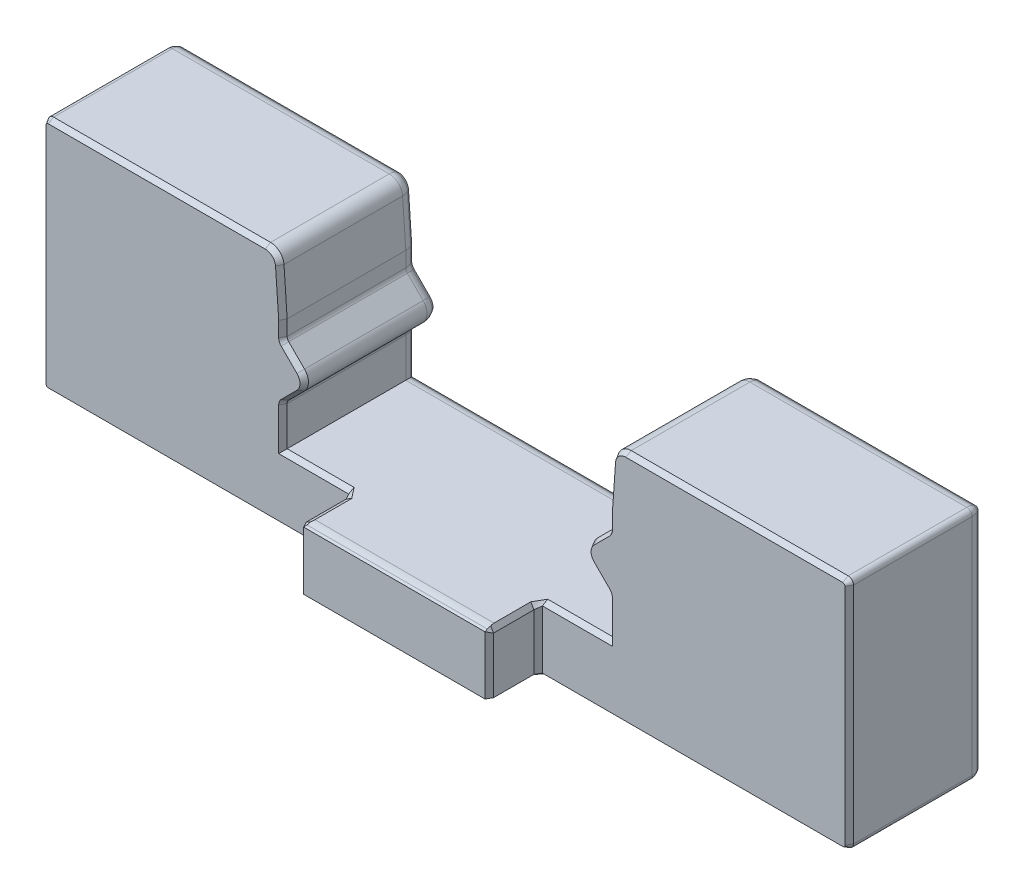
ISO-10303-21;
HEADER;
FILE_DESCRIPTION(('STEP AP214'),'2;1');
FILE_NAME('part.step','',(''),(''),'','','');
FILE_SCHEMA(('AUTOMOTIVE_DESIGN { 1 0 10303 214 1 1 1 1 }'));
ENDSEC;
DATA;
#1=APPLICATION_CONTEXT('core data for automotive mechanical design processes');
#2=APPLICATION_PROTOCOL_DEFINITION('international standard','automotive_design',2000,#1);
#3=PRODUCT_CONTEXT('',#1,'mechanical');
#4=PRODUCT('Part','Part','',(#3));
#5=PRODUCT_RELATED_PRODUCT_CATEGORY('part','',(#4));
#6=PRODUCT_DEFINITION_FORMATION('','',#4);
#7=PRODUCT_DEFINITION_CONTEXT('part definition',#1,'design');
#8=PRODUCT_DEFINITION('design','',#6,#7);
#9=PRODUCT_DEFINITION_SHAPE('','',#8);
#10=(LENGTH_UNIT() NAMED_UNIT(*) SI_UNIT(.MILLI.,.METRE.));
#11=(NAMED_UNIT(*) PLANE_ANGLE_UNIT() SI_UNIT($,.RADIAN.));
#12=(NAMED_UNIT(*) SI_UNIT($,.STERADIAN.) SOLID_ANGLE_UNIT());
#13=UNCERTAINTY_MEASURE_WITH_UNIT(LENGTH_MEASURE(1.E-05),#10,'distance_accuracy_value','');
#14=(GEOMETRIC_REPRESENTATION_CONTEXT(3) GLOBAL_UNCERTAINTY_ASSIGNED_CONTEXT((#13)) GLOBAL_UNIT_ASSIGNED_CONTEXT((#10,
#11,#12)) REPRESENTATION_CONTEXT('',''));
#15=CARTESIAN_POINT('',(0.,0.,0.));
#16=DIRECTION('',(0.,0.,1.));
#17=DIRECTION('',(1.,0.,0.));
#18=AXIS2_PLACEMENT_3D('',#15,#16,#17);
#19=CARTESIAN_POINT('',(21.1,2.4,6.858));
#20=DIRECTION('',(0.,-1.,0.));
#21=DIRECTION('',(0.,0.,-1.));
#22=AXIS2_PLACEMENT_3D('',#19,#20,#21);
#23=PLANE('',#22);
#24=DIRECTION('',(0.,0.,-1.));
#25=VECTOR('',#24,1.);
#26=CARTESIAN_POINT('',(21.1,2.4,6.858));
#27=LINE('',#26,#25);
#28=CARTESIAN_POINT('',(21.1,2.4,4.753));
#29=VERTEX_POINT('',#28);
#30=CARTESIAN_POINT('',(21.1,2.4,0.333974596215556));
#31=VERTEX_POINT('',#30);
#32=EDGE_CURVE('E774',#29,#31,#27,.T.);
#33=ORIENTED_EDGE('',*,*,#32,.T.);
#34=DIRECTION('',(1.,0.,0.));
#35=VECTOR('',#34,1.);
#36=CARTESIAN_POINT('',(8.9,2.4,0.333974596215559));
#37=LINE('',#36,#35);
#38=CARTESIAN_POINT('',(8.9,2.4,0.333974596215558));
#39=VERTEX_POINT('',#38);
#40=EDGE_CURVE('E966',#31,#39,#37,.F.);
#41=ORIENTED_EDGE('',*,*,#40,.T.);
#42=DIRECTION('',(0.,0.,-1.));
#43=VECTOR('',#42,1.);
#44=CARTESIAN_POINT('',(8.9,2.4,6.858));
#45=LINE('',#44,#43);
#46=CARTESIAN_POINT('',(8.9,2.4,4.753));
#47=VERTEX_POINT('',#46);
#48=EDGE_CURVE('E776',#47,#39,#45,.T.);
#49=ORIENTED_EDGE('',*,*,#48,.F.);
#50=DIRECTION('',(1.,0.,0.));
#51=VECTOR('',#50,1.);
#52=CARTESIAN_POINT('',(11.5075,2.4,4.753));
#53=LINE('',#52,#51);
#54=CARTESIAN_POINT('',(11.3920299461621,2.4,4.753));
#55=VERTEX_POINT('',#54);
#56=EDGE_CURVE('E587',#47,#55,#53,.T.);
#57=ORIENTED_EDGE('',*,*,#56,.T.);
#58=CARTESIAN_POINT('',(11.7075,2.4,5.153));
#59=CARTESIAN_POINT('',(11.6812108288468,2.4,5.11966666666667));
#60=CARTESIAN_POINT('',(11.6549216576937,2.4,5.08633333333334));
#61=CARTESIAN_POINT('',(11.5891987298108,2.4,5.003));
#62=CARTESIAN_POINT('',(11.549764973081,2.4,4.953));
#63=CARTESIAN_POINT('',(11.4708974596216,2.4,4.853));
#64=CARTESIAN_POINT('',(11.4314637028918,2.4,4.803));
#65=CARTESIAN_POINT('',(11.3920299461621,2.4,4.753));
#66=B_SPLINE_CURVE_WITH_KNOTS('',3,(#58,#59,#60,#61,#62,#63,#64,#65),.UNSPECIFIED.,.F.,.F.,(4,2,
2,4),(0.,0.127358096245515,0.318395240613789,0.509432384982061),.UNSPECIFIED.);
#67=CARTESIAN_POINT('',(11.7075,2.4,5.153));
#68=VERTEX_POINT('',#67);
#69=EDGE_CURVE('E627',#68,#55,#66,.T.);
#70=ORIENTED_EDGE('',*,*,#69,.F.);
#71=DIRECTION('',(0.,0.,1.));
#72=VECTOR('',#71,1.);
#73=CARTESIAN_POINT('',(11.7075,2.4,6.858));
#74=LINE('',#73,#72);
#75=CARTESIAN_POINT('',(11.7075,2.4,6.52402540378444));
#76=VERTEX_POINT('',#75);
#77=EDGE_CURVE('E2893',#68,#76,#74,.T.);
#78=ORIENTED_EDGE('',*,*,#77,.T.);
#79=DIRECTION('',(1.,0.,0.));
#80=VECTOR('',#79,1.);
#81=CARTESIAN_POINT('',(18.3770299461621,2.4,6.52402540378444));
#82=LINE('',#81,#80);
#83=CARTESIAN_POINT('',(18.3770299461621,2.4,6.52402540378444));
#84=VERTEX_POINT('',#83);
#85=EDGE_CURVE('E964',#76,#84,#82,.T.);
#86=ORIENTED_EDGE('',*,*,#85,.T.);
#87=DIRECTION('',(0.,0.,-1.));
#88=VECTOR('',#87,1.);
#89=CARTESIAN_POINT('',(18.3770299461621,2.4,4.953));
#90=LINE('',#89,#88);
#91=CARTESIAN_POINT('',(18.3770299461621,2.4,5.153));
#92=VERTEX_POINT('',#91);
#93=EDGE_CURVE('E583',#84,#92,#90,.T.);
#94=ORIENTED_EDGE('',*,*,#93,.T.);
#95=CARTESIAN_POINT('',(18.6079700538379,2.4,4.753));
#96=CARTESIAN_POINT('',(18.569480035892,2.4,4.81966666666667));
#97=CARTESIAN_POINT('',(18.530990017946,2.4,4.88633333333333));
#98=CARTESIAN_POINT('',(18.454009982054,2.4,5.01966666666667));
#99=CARTESIAN_POINT('',(18.4155199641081,2.4,5.08633333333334));
#100=CARTESIAN_POINT('',(18.3770299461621,2.4,5.153));
#101=B_SPLINE_CURVE_WITH_KNOTS('',3,(#95,#96,#97,#98,#99,#100),.UNSPECIFIED.,.F.,.F.,(4,2,4),
(0.,0.230940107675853,0.461880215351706),.UNSPECIFIED.);
#102=CARTESIAN_POINT('',(18.4925,2.4,4.953));
#103=VERTEX_POINT('',#102);
#104=EDGE_CURVE('E576',#103,#92,#101,.T.);
#105=ORIENTED_EDGE('',*,*,#104,.F.);
#106=CARTESIAN_POINT('',(18.6079700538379,2.4,4.753));
#107=CARTESIAN_POINT('',(18.569480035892,2.4,4.81966666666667));
#108=CARTESIAN_POINT('',(18.530990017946,2.4,4.88633333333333));
#109=CARTESIAN_POINT('',(18.454009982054,2.4,5.01966666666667));
#110=CARTESIAN_POINT('',(18.4155199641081,2.4,5.08633333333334));
#111=CARTESIAN_POINT('',(18.3770299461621,2.4,5.153));
#112=B_SPLINE_CURVE_WITH_KNOTS('',3,(#106,#107,#108,#109,#110,#111),.UNSPECIFIED.,.F.,.F.,(4,2,
4),(0.,0.230940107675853,0.461880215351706),.UNSPECIFIED.);
#113=CARTESIAN_POINT('',(18.6079700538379,2.4,4.753));
#114=VERTEX_POINT('',#113);
#115=EDGE_CURVE('E579',#114,#103,#112,.T.);
#116=ORIENTED_EDGE('',*,*,#115,.F.);
#117=DIRECTION('',(1.,0.,0.));
#118=VECTOR('',#117,1.);
#119=CARTESIAN_POINT('',(21.1,2.4,4.753));
#120=LINE('',#119,#118);
#121=EDGE_CURVE('E594',#114,#29,#120,.T.);
#122=ORIENTED_EDGE('',*,*,#121,.T.);
#123=EDGE_LOOP('',(#33,#41,#49,#57,#70,#78,#86,#94,#105,#116,#122));
#124=FACE_BOUND('',#123,.T.);
#125=ADVANCED_FACE('F36',(#124),#23,.F.);
#126=CARTESIAN_POINT('',(0.,8.75,6.858));
#127=DIRECTION('',(1.,0.,0.));
#128=DIRECTION('',(0.,1.,0.));
#129=AXIS2_PLACEMENT_3D('',#126,#127,#128);
#130=PLANE('',#129);
#131=DIRECTION('',(0.,0.,-1.));
#132=VECTOR('',#131,1.);
#133=CARTESIAN_POINT('',(0.,8.55,6.858));
#134=LINE('',#133,#132);
#135=CARTESIAN_POINT('',(0.,8.55,4.753));
#136=VERTEX_POINT('',#135);
#137=CARTESIAN_POINT('',(0.,8.55,0.333974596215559));
#138=VERTEX_POINT('',#137);
#139=EDGE_CURVE('E741',#136,#138,#134,.T.);
#140=ORIENTED_EDGE('',*,*,#139,.T.);
#141=DIRECTION('',(0.,1.,0.));
#142=VECTOR('',#141,1.);
#143=CARTESIAN_POINT('',(0.,0.200000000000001,0.333974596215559));
#144=LINE('',#143,#142);
#145=CARTESIAN_POINT('',(0.,0.200000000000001,0.333974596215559));
#146=VERTEX_POINT('',#145);
#147=EDGE_CURVE('E45',#138,#146,#144,.F.);
#148=ORIENTED_EDGE('',*,*,#147,.T.);
#149=DIRECTION('',(0.,0.,-1.));
#150=VECTOR('',#149,1.);
#151=CARTESIAN_POINT('',(0.,0.200000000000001,6.858));
#152=LINE('',#151,#150);
#153=CARTESIAN_POINT('',(0.,0.200000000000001,4.753));
#154=VERTEX_POINT('',#153);
#155=EDGE_CURVE('E739',#146,#154,#152,.F.);
#156=ORIENTED_EDGE('',*,*,#155,.T.);
#157=DIRECTION('',(0.,1.,0.));
#158=VECTOR('',#157,1.);
#159=CARTESIAN_POINT('',(0.,8.55,4.753));
#160=LINE('',#159,#158);
#161=EDGE_CURVE('E2695',#154,#136,#160,.T.);
#162=ORIENTED_EDGE('',*,*,#161,.T.);
#163=EDGE_LOOP('',(#140,#148,#156,#162));
#164=FACE_BOUND('',#163,.T.);
#165=ADVANCED_FACE('F619',(#164),#130,.F.);
#166=CARTESIAN_POINT('',(0.,0.,6.858));
#167=DIRECTION('',(0.,1.,0.));
#168=DIRECTION('',(0.,0.,1.));
#169=AXIS2_PLACEMENT_3D('',#166,#167,#168);
#170=PLANE('',#169);
#171=DIRECTION('',(0.,0.,-1.));
#172=VECTOR('',#171,1.);
#173=CARTESIAN_POINT('',(0.2,0.,6.858));
#174=LINE('',#173,#172);
#175=CARTESIAN_POINT('',(0.2,0.,4.753));
#176=VERTEX_POINT('',#175);
#177=CARTESIAN_POINT('',(0.2,0.,0.333974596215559));
#178=VERTEX_POINT('',#177);
#179=EDGE_CURVE('E746',#176,#178,#174,.T.);
#180=ORIENTED_EDGE('',*,*,#179,.T.);
#181=DIRECTION('',(-1.,0.,0.));
#182=VECTOR('',#181,1.);
#183=CARTESIAN_POINT('',(29.8,0.,0.333974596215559));
#184=LINE('',#183,#182);
#185=CARTESIAN_POINT('',(29.8,0.,0.333974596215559));
#186=VERTEX_POINT('',#185);
#187=EDGE_CURVE('E956',#178,#186,#184,.F.);
#188=ORIENTED_EDGE('',*,*,#187,.T.);
#189=DIRECTION('',(0.,0.,-1.));
#190=VECTOR('',#189,1.);
#191=CARTESIAN_POINT('',(29.8,0.,6.858));
#192=LINE('',#191,#190);
#193=CARTESIAN_POINT('',(29.8,0.,4.753));
#194=VERTEX_POINT('',#193);
#195=EDGE_CURVE('E744',#186,#194,#192,.F.);
#196=ORIENTED_EDGE('',*,*,#195,.T.);
#197=DIRECTION('',(-1.,0.,0.));
#198=VECTOR('',#197,1.);
#199=CARTESIAN_POINT('',(18.4925,0.,4.753));
#200=LINE('',#199,#198);
#201=CARTESIAN_POINT('',(18.6079700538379,0.,4.753));
#202=VERTEX_POINT('',#201);
#203=EDGE_CURVE('E667',#194,#202,#200,.T.);
#204=ORIENTED_EDGE('',*,*,#203,.T.);
#205=CARTESIAN_POINT('',(18.2925,0.,5.153));
#206=CARTESIAN_POINT('',(18.3187891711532,0.,5.11966666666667));
#207=CARTESIAN_POINT('',(18.3450783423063,0.,5.08633333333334));
#208=CARTESIAN_POINT('',(18.3976566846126,0.,5.01966666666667));
#209=CARTESIAN_POINT('',(18.4239458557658,0.,4.98633333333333));
#210=CARTESIAN_POINT('',(18.5028133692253,0.,4.88633333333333));
#211=CARTESIAN_POINT('',(18.5553917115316,0.,4.81966666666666));
#212=CARTESIAN_POINT('',(18.6079700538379,0.,4.753));
#213=B_SPLINE_CURVE_WITH_KNOTS('',3,(#205,#206,#207,#208,#209,#210,#211,#212),.UNSPECIFIED.,.F.,
.F.,(4,2,2,4),(0.,0.127358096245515,0.25471619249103,0.50943238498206),.UNSPECIFIED.);
#214=CARTESIAN_POINT('',(18.2925,0.,5.153));
#215=VERTEX_POINT('',#214);
#216=EDGE_CURVE('E658',#215,#202,#213,.T.);
#217=ORIENTED_EDGE('',*,*,#216,.F.);
#218=DIRECTION('',(0.,0.,1.));
#219=VECTOR('',#218,1.);
#220=CARTESIAN_POINT('',(18.2925,0.,6.858));
#221=LINE('',#220,#219);
#222=CARTESIAN_POINT('',(18.2925,0.,6.658));
#223=VERTEX_POINT('',#222);
#224=EDGE_CURVE('E693',#215,#223,#221,.T.);
#225=ORIENTED_EDGE('',*,*,#224,.T.);
#226=DIRECTION('',(-1.,0.,0.));
#227=VECTOR('',#226,1.);
#228=CARTESIAN_POINT('',(11.5075,0.,6.658));
#229=LINE('',#228,#227);
#230=CARTESIAN_POINT('',(11.6229700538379,0.,6.658));
#231=VERTEX_POINT('',#230);
#232=EDGE_CURVE('E698',#223,#231,#229,.T.);
#233=ORIENTED_EDGE('',*,*,#232,.T.);
#234=DIRECTION('',(0.,0.,-1.));
#235=VECTOR('',#234,1.);
#236=CARTESIAN_POINT('',(11.6229700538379,0.,4.953));
#237=LINE('',#236,#235);
#238=CARTESIAN_POINT('',(11.6229700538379,0.,5.153));
#239=VERTEX_POINT('',#238);
#240=EDGE_CURVE('E696',#231,#239,#237,.T.);
#241=ORIENTED_EDGE('',*,*,#240,.T.);
#242=CARTESIAN_POINT('',(11.3920299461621,0.,4.753));
#243=CARTESIAN_POINT('',(11.430519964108,0.,4.81966666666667));
#244=CARTESIAN_POINT('',(11.469009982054,0.,4.88633333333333));
#245=CARTESIAN_POINT('',(11.545990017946,0.,5.01966666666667));
#246=CARTESIAN_POINT('',(11.5844800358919,0.,5.08633333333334));
#247=CARTESIAN_POINT('',(11.6229700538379,0.,5.153));
#248=B_SPLINE_CURVE_WITH_KNOTS('',3,(#242,#243,#244,#245,#246,#247),.UNSPECIFIED.,.F.,.F.,(4,2,
4),(0.,0.230940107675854,0.461880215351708),.UNSPECIFIED.);
#249=CARTESIAN_POINT('',(11.5075,0.,4.953));
#250=VERTEX_POINT('',#249);
#251=EDGE_CURVE('E686',#250,#239,#248,.T.);
#252=ORIENTED_EDGE('',*,*,#251,.F.);
#253=CARTESIAN_POINT('',(11.3920299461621,0.,4.753));
#254=CARTESIAN_POINT('',(11.430519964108,0.,4.81966666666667));
#255=CARTESIAN_POINT('',(11.469009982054,0.,4.88633333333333));
#256=CARTESIAN_POINT('',(11.545990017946,0.,5.01966666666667));
#257=CARTESIAN_POINT('',(11.5844800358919,0.,5.08633333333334));
#258=CARTESIAN_POINT('',(11.6229700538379,0.,5.153));
#259=B_SPLINE_CURVE_WITH_KNOTS('',3,(#253,#254,#255,#256,#257,#258),.UNSPECIFIED.,.F.,.F.,(4,2,
4),(0.,0.230940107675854,0.461880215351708),.UNSPECIFIED.);
#260=CARTESIAN_POINT('',(11.3920299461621,0.,4.753));
#261=VERTEX_POINT('',#260);
#262=EDGE_CURVE('E668',#261,#250,#259,.T.);
#263=ORIENTED_EDGE('',*,*,#262,.F.);
#264=DIRECTION('',(-1.,0.,0.));
#265=VECTOR('',#264,1.);
#266=CARTESIAN_POINT('',(0.2,0.,4.753));
#267=LINE('',#266,#265);
#268=EDGE_CURVE('E2896',#261,#176,#267,.T.);
#269=ORIENTED_EDGE('',*,*,#268,.T.);
#270=EDGE_LOOP('',(#180,#188,#196,#204,#217,#225,#233,#241,#252,#263,#269));
#271=FACE_BOUND('',#270,.T.);
#272=ADVANCED_FACE('F675',(#271),#170,.F.);
#273=CARTESIAN_POINT('',(30.,0.,6.858));
#274=DIRECTION('',(-1.,0.,0.));
#275=DIRECTION('',(0.,-1.,0.));
#276=AXIS2_PLACEMENT_3D('',#273,#274,#275);
#277=PLANE('',#276);
#278=DIRECTION('',(0.,0.,-1.));
#279=VECTOR('',#278,1.);
#280=CARTESIAN_POINT('',(30.,0.2,6.858));
#281=LINE('',#280,#279);
#282=CARTESIAN_POINT('',(30.,0.2,4.753));
#283=VERTEX_POINT('',#282);
#284=CARTESIAN_POINT('',(30.,0.2,0.333974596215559));
#285=VERTEX_POINT('',#284);
#286=EDGE_CURVE('E749',#283,#285,#281,.T.);
#287=ORIENTED_EDGE('',*,*,#286,.T.);
#288=DIRECTION('',(0.,-1.,0.));
#289=VECTOR('',#288,1.);
#290=CARTESIAN_POINT('',(30.,8.55,0.333974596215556));
#291=LINE('',#290,#289);
#292=CARTESIAN_POINT('',(30.,8.55,0.333974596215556));
#293=VERTEX_POINT('',#292);
#294=EDGE_CURVE('E948',#285,#293,#291,.F.);
#295=ORIENTED_EDGE('',*,*,#294,.T.);
#296=DIRECTION('',(0.,0.,-1.));
#297=VECTOR('',#296,1.);
#298=CARTESIAN_POINT('',(30.,8.55,6.858));
#299=LINE('',#298,#297);
#300=CARTESIAN_POINT('',(30.,8.55,4.753));
#301=VERTEX_POINT('',#300);
#302=EDGE_CURVE('E752',#293,#301,#299,.F.);
#303=ORIENTED_EDGE('',*,*,#302,.T.);
#304=DIRECTION('',(0.,-1.,0.));
#305=VECTOR('',#304,1.);
#306=CARTESIAN_POINT('',(30.,0.2,4.753));
#307=LINE('',#306,#305);
#308=EDGE_CURVE('E2996',#301,#283,#307,.T.);
#309=ORIENTED_EDGE('',*,*,#308,.T.);
#310=EDGE_LOOP('',(#287,#295,#303,#309));
#311=FACE_BOUND('',#310,.T.);
#312=ADVANCED_FACE('F680',(#311),#277,.F.);
#313=CARTESIAN_POINT('',(30.,8.75,6.858));
#314=DIRECTION('',(0.,-1.,0.));
#315=DIRECTION('',(1.,0.,0.));
#316=AXIS2_PLACEMENT_3D('',#313,#314,#315);
#317=PLANE('',#316);
#318=DIRECTION('',(0.,0.,-1.));
#319=VECTOR('',#318,1.);
#320=CARTESIAN_POINT('',(29.8,8.75,6.858));
#321=LINE('',#320,#319);
#322=CARTESIAN_POINT('',(29.8,8.75,4.753));
#323=VERTEX_POINT('',#322);
#324=CARTESIAN_POINT('',(29.8,8.75,0.333974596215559));
#325=VERTEX_POINT('',#324);
#326=EDGE_CURVE('E736',#323,#325,#321,.T.);
#327=ORIENTED_EDGE('',*,*,#326,.T.);
#328=DIRECTION('',(1.,0.,0.));
#329=VECTOR('',#328,1.);
#330=CARTESIAN_POINT('',(21.7172295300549,8.75,0.333974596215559));
#331=LINE('',#330,#329);
#332=CARTESIAN_POINT('',(21.7172295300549,8.75,0.333974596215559));
#333=VERTEX_POINT('',#332);
#334=EDGE_CURVE('E940',#325,#333,#331,.F.);
#335=ORIENTED_EDGE('',*,*,#334,.T.);
#336=DIRECTION('',(0.,0.,-1.));
#337=VECTOR('',#336,1.);
#338=CARTESIAN_POINT('',(21.7172295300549,8.75,4.953));
#339=LINE('',#338,#337);
#340=CARTESIAN_POINT('',(21.7172295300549,8.75,4.753));
#341=VERTEX_POINT('',#340);
#342=EDGE_CURVE('E717',#333,#341,#339,.F.);
#343=ORIENTED_EDGE('',*,*,#342,.T.);
#344=DIRECTION('',(1.,0.,0.));
#345=VECTOR('',#344,1.);
#346=CARTESIAN_POINT('',(29.8,8.75,4.753));
#347=LINE('',#346,#345);
#348=EDGE_CURVE('E2969',#341,#323,#347,.T.);
#349=ORIENTED_EDGE('',*,*,#348,.T.);
#350=EDGE_LOOP('',(#327,#335,#343,#349));
#351=FACE_BOUND('',#350,.T.);
#352=ADVANCED_FACE('F2408',(#351),#317,.F.);
#353=CARTESIAN_POINT('',(21.1,8.75,6.858));
#354=DIRECTION('',(1.,0.,0.));
#355=DIRECTION('',(0.,0.,-1.));
#356=AXIS2_PLACEMENT_3D('',#353,#354,#355);
#357=PLANE('',#356);
#358=DIRECTION('',(0.,0.,-1.));
#359=VECTOR('',#358,1.);
#360=CARTESIAN_POINT('',(21.1,6.59099999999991,6.858));
#361=LINE('',#360,#359);
#362=CARTESIAN_POINT('',(21.1,6.59099999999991,4.753));
#363=VERTEX_POINT('',#362);
#364=CARTESIAN_POINT('',(21.1,6.59099999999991,0.333974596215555));
#365=VERTEX_POINT('',#364);
#366=EDGE_CURVE('E731',#363,#365,#361,.T.);
#367=ORIENTED_EDGE('',*,*,#366,.T.);
#368=DIRECTION('',(0.,1.,0.));
#369=VECTOR('',#368,1.);
#370=CARTESIAN_POINT('',(21.1,6.02284271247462,0.333974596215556));
#371=LINE('',#370,#369);
#372=CARTESIAN_POINT('',(21.1,6.02284271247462,0.333974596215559));
#373=VERTEX_POINT('',#372);
#374=EDGE_CURVE('E865',#365,#373,#371,.F.);
#375=ORIENTED_EDGE('',*,*,#374,.T.);
#376=DIRECTION('',(0.,0.,-1.));
#377=VECTOR('',#376,1.);
#378=CARTESIAN_POINT('',(21.1,6.02284271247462,4.953));
#379=LINE('',#378,#377);
#380=CARTESIAN_POINT('',(21.1,6.02284271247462,4.753));
#381=VERTEX_POINT('',#380);
#382=EDGE_CURVE('E769',#373,#381,#379,.F.);
#383=ORIENTED_EDGE('',*,*,#382,.T.);
#384=DIRECTION('',(0.,1.,0.));
#385=VECTOR('',#384,1.);
#386=CARTESIAN_POINT('',(21.1,6.59099999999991,4.753));
#387=LINE('',#386,#385);
#388=EDGE_CURVE('E3011',#381,#363,#387,.T.);
#389=ORIENTED_EDGE('',*,*,#388,.T.);
#390=EDGE_LOOP('',(#367,#375,#383,#389));
#391=FACE_BOUND('',#390,.T.);
#392=ADVANCED_FACE('F2416',(#391),#357,.F.);
#393=CARTESIAN_POINT('',(21.1,5.94,6.858));
#394=DIRECTION('',(0.707106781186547,-0.707106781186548,0.));
#395=DIRECTION('',(0.707106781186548,0.707106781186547,0.));
#396=AXIS2_PLACEMENT_3D('',#393,#394,#395);
#397=PLANE('',#396);
#398=DIRECTION('',(0.,0.,-1.));
#399=VECTOR('',#398,1.);
#400=CARTESIAN_POINT('',(21.0414213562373,5.88142135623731,0.));
#401=LINE('',#400,#399);
#402=CARTESIAN_POINT('',(21.0414213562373,5.88142135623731,4.753));
#403=VERTEX_POINT('',#402);
#404=CARTESIAN_POINT('',(21.0414213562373,5.88142135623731,0.333974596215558));
#405=VERTEX_POINT('',#404);
#406=EDGE_CURVE('E771',#403,#405,#401,.T.);
#407=ORIENTED_EDGE('',*,*,#406,.T.);
#408=DIRECTION('',(0.707106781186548,0.707106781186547,0.));
#409=VECTOR('',#408,1.);
#410=CARTESIAN_POINT('',(20.4535533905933,5.29355339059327,0.333974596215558));
#411=LINE('',#410,#409);
#412=CARTESIAN_POINT('',(20.4535533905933,5.29355339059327,0.333974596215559));
#413=VERTEX_POINT('',#412);
#414=EDGE_CURVE('E876',#405,#413,#411,.F.);
#415=ORIENTED_EDGE('',*,*,#414,.T.);
#416=DIRECTION('',(0.,0.,-1.));
#417=VECTOR('',#416,1.);
#418=CARTESIAN_POINT('',(20.4535533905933,5.29355339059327,6.858));
#419=LINE('',#418,#417);
#420=CARTESIAN_POINT('',(20.4535533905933,5.29355339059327,4.753));
#421=VERTEX_POINT('',#420);
#422=EDGE_CURVE('E724',#413,#421,#419,.F.);
#423=ORIENTED_EDGE('',*,*,#422,.T.);
#424=DIRECTION('',(0.707106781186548,0.707106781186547,0.));
#425=VECTOR('',#424,1.);
#426=CARTESIAN_POINT('',(21.0414213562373,5.88142135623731,4.753));
#427=LINE('',#426,#425);
#428=EDGE_CURVE('E3006',#421,#403,#427,.T.);
#429=ORIENTED_EDGE('',*,*,#428,.T.);
#430=EDGE_LOOP('',(#407,#415,#423,#429));
#431=FACE_BOUND('',#430,.T.);
#432=ADVANCED_FACE('F2424',(#431),#397,.F.);
#433=CARTESIAN_POINT('',(20.1,4.94,6.858));
#434=DIRECTION('',(0.707106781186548,0.707106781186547,0.));
#435=DIRECTION('',(-0.707106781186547,0.707106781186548,0.));
#436=AXIS2_PLACEMENT_3D('',#433,#434,#435);
#437=PLANE('',#436);
#438=DIRECTION('',(0.,0.,-1.));
#439=VECTOR('',#438,1.);
#440=CARTESIAN_POINT('',(20.4535533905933,4.58644660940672,6.858));
#441=LINE('',#440,#439);
#442=CARTESIAN_POINT('',(20.4535533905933,4.58644660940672,4.753));
#443=VERTEX_POINT('',#442);
#444=CARTESIAN_POINT('',(20.4535533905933,4.58644660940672,0.33397459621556));
#445=VERTEX_POINT('',#444);
#446=EDGE_CURVE('E726',#443,#445,#441,.T.);
#447=ORIENTED_EDGE('',*,*,#446,.T.);
#448=DIRECTION('',(-0.707106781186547,0.707106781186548,0.));
#449=VECTOR('',#448,1.);
#450=CARTESIAN_POINT('',(21.0414213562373,3.99857864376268,0.33397459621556));
#451=LINE('',#450,#449);
#452=CARTESIAN_POINT('',(21.0414213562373,3.99857864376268,0.333974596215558));
#453=VERTEX_POINT('',#452);
#454=EDGE_CURVE('E884',#445,#453,#451,.F.);
#455=ORIENTED_EDGE('',*,*,#454,.T.);
#456=DIRECTION('',(0.,0.,-1.));
#457=VECTOR('',#456,1.);
#458=CARTESIAN_POINT('',(21.0414213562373,3.99857864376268,4.953));
#459=LINE('',#458,#457);
#460=CARTESIAN_POINT('',(21.0414213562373,3.99857864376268,4.753));
#461=VERTEX_POINT('',#460);
#462=EDGE_CURVE('E764',#453,#461,#459,.F.);
#463=ORIENTED_EDGE('',*,*,#462,.T.);
#464=DIRECTION('',(-0.707106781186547,0.707106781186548,0.));
#465=VECTOR('',#464,1.);
#466=CARTESIAN_POINT('',(20.4535533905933,4.58644660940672,4.753));
#467=LINE('',#466,#465);
#468=EDGE_CURVE('E3003',#461,#443,#467,.T.);
#469=ORIENTED_EDGE('',*,*,#468,.T.);
#470=EDGE_LOOP('',(#447,#455,#463,#469));
#471=FACE_BOUND('',#470,.T.);
#472=ADVANCED_FACE('F2433',(#471),#437,.F.);
#473=CARTESIAN_POINT('',(21.1,3.93999999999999,6.858));
#474=DIRECTION('',(1.,0.,0.));
#475=DIRECTION('',(0.,0.,-1.));
#476=AXIS2_PLACEMENT_3D('',#473,#474,#475);
#477=PLANE('',#476);
#478=DIRECTION('',(0.,0.,-1.));
#479=VECTOR('',#478,1.);
#480=CARTESIAN_POINT('',(21.1,3.85715728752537,0.));
#481=LINE('',#480,#479);
#482=CARTESIAN_POINT('',(21.1,3.85715728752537,4.753));
#483=VERTEX_POINT('',#482);
#484=CARTESIAN_POINT('',(21.1,3.85715728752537,0.333974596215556));
#485=VERTEX_POINT('',#484);
#486=EDGE_CURVE('E766',#483,#485,#481,.T.);
#487=ORIENTED_EDGE('',*,*,#486,.T.);
#488=DIRECTION('',(0.,1.,0.));
#489=VECTOR('',#488,1.);
#490=CARTESIAN_POINT('',(21.1,2.4,0.333974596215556));
#491=LINE('',#490,#489);
#492=EDGE_CURVE('E978',#485,#31,#491,.F.);
#493=ORIENTED_EDGE('',*,*,#492,.T.);
#494=ORIENTED_EDGE('',*,*,#32,.F.);
#495=DIRECTION('',(0.,1.,0.));
#496=VECTOR('',#495,1.);
#497=CARTESIAN_POINT('',(21.1,3.85715728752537,4.753));
#498=LINE('',#497,#496);
#499=EDGE_CURVE('E3000',#29,#483,#498,.T.);
#500=ORIENTED_EDGE('',*,*,#499,.T.);
#501=EDGE_LOOP('',(#487,#493,#494,#500));
#502=FACE_BOUND('',#501,.T.);
#503=ADVANCED_FACE('F622',(#502),#477,.F.);
#504=CARTESIAN_POINT('',(8.9,2.4,6.858));
#505=DIRECTION('',(-1.,0.,0.));
#506=DIRECTION('',(0.,0.,1.));
#507=AXIS2_PLACEMENT_3D('',#504,#505,#506);
#508=PLANE('',#507);
#509=ORIENTED_EDGE('',*,*,#48,.T.);
#510=DIRECTION('',(0.,-1.,0.));
#511=VECTOR('',#510,1.);
#512=CARTESIAN_POINT('',(8.9,3.85715728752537,0.333974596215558));
#513=LINE('',#512,#511);
#514=CARTESIAN_POINT('',(8.9,3.85715728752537,0.333974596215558));
#515=VERTEX_POINT('',#514);
#516=EDGE_CURVE('E982',#39,#515,#513,.F.);
#517=ORIENTED_EDGE('',*,*,#516,.T.);
#518=DIRECTION('',(0.,0.,-1.));
#519=VECTOR('',#518,1.);
#520=CARTESIAN_POINT('',(8.9,3.85715728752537,4.953));
#521=LINE('',#520,#519);
#522=CARTESIAN_POINT('',(8.9,3.85715728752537,4.753));
#523=VERTEX_POINT('',#522);
#524=EDGE_CURVE('E759',#515,#523,#521,.F.);
#525=ORIENTED_EDGE('',*,*,#524,.T.);
#526=DIRECTION('',(0.,-1.,0.));
#527=VECTOR('',#526,1.);
#528=CARTESIAN_POINT('',(8.9,2.4,4.753));
#529=LINE('',#528,#527);
#530=EDGE_CURVE('E2754',#523,#47,#529,.T.);
#531=ORIENTED_EDGE('',*,*,#530,.T.);
#532=EDGE_LOOP('',(#509,#517,#525,#531));
#533=FACE_BOUND('',#532,.T.);
#534=ADVANCED_FACE('F620',(#533),#508,.F.);
#535=CARTESIAN_POINT('',(8.9,3.93999999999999,6.858));
#536=DIRECTION('',(-0.707106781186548,0.707106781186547,0.));
#537=DIRECTION('',(-0.707106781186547,-0.707106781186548,0.));
#538=AXIS2_PLACEMENT_3D('',#535,#536,#537);
#539=PLANE('',#538);
#540=DIRECTION('',(0.,0.,-1.));
#541=VECTOR('',#540,1.);
#542=CARTESIAN_POINT('',(8.95857864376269,3.99857864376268,0.));
#543=LINE('',#542,#541);
#544=CARTESIAN_POINT('',(8.95857864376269,3.99857864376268,4.753));
#545=VERTEX_POINT('',#544);
#546=CARTESIAN_POINT('',(8.95857864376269,3.99857864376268,0.333974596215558));
#547=VERTEX_POINT('',#546);
#548=EDGE_CURVE('E761',#545,#547,#543,.T.);
#549=ORIENTED_EDGE('',*,*,#548,.T.);
#550=DIRECTION('',(-0.707106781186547,-0.707106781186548,0.));
#551=VECTOR('',#550,1.);
#552=CARTESIAN_POINT('',(9.54644660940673,4.58644660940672,0.333974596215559));
#553=LINE('',#552,#551);
#554=CARTESIAN_POINT('',(9.54644660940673,4.58644660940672,0.333974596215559));
#555=VERTEX_POINT('',#554);
#556=EDGE_CURVE('E908',#547,#555,#553,.F.);
#557=ORIENTED_EDGE('',*,*,#556,.T.);
#558=DIRECTION('',(0.,0.,-1.));
#559=VECTOR('',#558,1.);
#560=CARTESIAN_POINT('',(9.54644660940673,4.58644660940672,6.858));
#561=LINE('',#560,#559);
#562=CARTESIAN_POINT('',(9.54644660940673,4.58644660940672,4.753));
#563=VERTEX_POINT('',#562);
#564=EDGE_CURVE('E719',#555,#563,#561,.F.);
#565=ORIENTED_EDGE('',*,*,#564,.T.);
#566=DIRECTION('',(-0.707106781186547,-0.707106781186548,0.));
#567=VECTOR('',#566,1.);
#568=CARTESIAN_POINT('',(8.95857864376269,3.99857864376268,4.753));
#569=LINE('',#568,#567);
#570=EDGE_CURVE('E2749',#563,#545,#569,.T.);
#571=ORIENTED_EDGE('',*,*,#570,.T.);
#572=EDGE_LOOP('',(#549,#557,#565,#571));
#573=FACE_BOUND('',#572,.T.);
#574=ADVANCED_FACE('F2456',(#573),#539,.F.);
#575=CARTESIAN_POINT('',(8.9,5.94,6.858));
#576=DIRECTION('',(-0.707106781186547,-0.707106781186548,0.));
#577=DIRECTION('',(0.707106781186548,-0.707106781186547,0.));
#578=AXIS2_PLACEMENT_3D('',#575,#576,#577);
#579=PLANE('',#578);
#580=DIRECTION('',(0.,0.,-1.));
#581=VECTOR('',#580,1.);
#582=CARTESIAN_POINT('',(9.54644660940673,5.29355339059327,6.858));
#583=LINE('',#582,#581);
#584=CARTESIAN_POINT('',(9.54644660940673,5.29355339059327,4.753));
#585=VERTEX_POINT('',#584);
#586=CARTESIAN_POINT('',(9.54644660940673,5.29355339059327,0.333974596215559));
#587=VERTEX_POINT('',#586);
#588=EDGE_CURVE('E721',#585,#587,#583,.T.);
#589=ORIENTED_EDGE('',*,*,#588,.T.);
#590=DIRECTION('',(0.707106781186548,-0.707106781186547,0.));
#591=VECTOR('',#590,1.);
#592=CARTESIAN_POINT('',(8.95857864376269,5.88142135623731,0.333974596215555));
#593=LINE('',#592,#591);
#594=CARTESIAN_POINT('',(8.95857864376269,5.88142135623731,0.333974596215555));
#595=VERTEX_POINT('',#594);
#596=EDGE_CURVE('E900',#587,#595,#593,.F.);
#597=ORIENTED_EDGE('',*,*,#596,.T.);
#598=DIRECTION('',(0.,0.,-1.));
#599=VECTOR('',#598,1.);
#600=CARTESIAN_POINT('',(8.95857864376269,5.88142135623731,4.953));
#601=LINE('',#600,#599);
#602=CARTESIAN_POINT('',(8.95857864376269,5.88142135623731,4.753));
#603=VERTEX_POINT('',#602);
#604=EDGE_CURVE('E754',#595,#603,#601,.F.);
#605=ORIENTED_EDGE('',*,*,#604,.T.);
#606=DIRECTION('',(0.707106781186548,-0.707106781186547,0.));
#607=VECTOR('',#606,1.);
#608=CARTESIAN_POINT('',(9.54644660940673,5.29355339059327,4.753));
#609=LINE('',#608,#607);
#610=EDGE_CURVE('E2744',#603,#585,#609,.T.);
#611=ORIENTED_EDGE('',*,*,#610,.T.);
#612=EDGE_LOOP('',(#589,#597,#605,#611));
#613=FACE_BOUND('',#612,.T.);
#614=ADVANCED_FACE('F2463',(#613),#579,.F.);
#615=CARTESIAN_POINT('',(8.9,5.94,6.858));
#616=DIRECTION('',(-1.,0.,0.));
#617=DIRECTION('',(0.,0.,1.));
#618=AXIS2_PLACEMENT_3D('',#615,#616,#617);
#619=PLANE('',#618);
#620=DIRECTION('',(0.,0.,-1.));
#621=VECTOR('',#620,1.);
#622=CARTESIAN_POINT('',(8.9,6.02284271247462,0.));
#623=LINE('',#622,#621);
#624=CARTESIAN_POINT('',(8.9,6.02284271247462,4.753));
#625=VERTEX_POINT('',#624);
#626=CARTESIAN_POINT('',(8.9,6.02284271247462,0.333974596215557));
#627=VERTEX_POINT('',#626);
#628=EDGE_CURVE('E756',#625,#627,#623,.T.);
#629=ORIENTED_EDGE('',*,*,#628,.T.);
#630=DIRECTION('',(0.,-1.,0.));
#631=VECTOR('',#630,1.);
#632=CARTESIAN_POINT('',(8.9,6.59099999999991,0.333974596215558));
#633=LINE('',#632,#631);
#634=CARTESIAN_POINT('',(8.9,6.59099999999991,0.333974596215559));
#635=VERTEX_POINT('',#634);
#636=EDGE_CURVE('E892',#627,#635,#633,.F.);
#637=ORIENTED_EDGE('',*,*,#636,.T.);
#638=DIRECTION('',(0.,0.,1.));
#639=VECTOR('',#638,1.);
#640=CARTESIAN_POINT('',(8.9,6.59099999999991,6.858));
#641=LINE('',#640,#639);
#642=CARTESIAN_POINT('',(8.9,6.59099999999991,4.753));
#643=VERTEX_POINT('',#642);
#644=EDGE_CURVE('E729',#635,#643,#641,.T.);
#645=ORIENTED_EDGE('',*,*,#644,.T.);
#646=DIRECTION('',(0.,-1.,0.));
#647=VECTOR('',#646,1.);
#648=CARTESIAN_POINT('',(8.9,6.02284271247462,4.753));
#649=LINE('',#648,#647);
#650=EDGE_CURVE('E2732',#643,#625,#649,.T.);
#651=ORIENTED_EDGE('',*,*,#650,.T.);
#652=EDGE_LOOP('',(#629,#637,#645,#651));
#653=FACE_BOUND('',#652,.T.);
#654=ADVANCED_FACE('F2471',(#653),#619,.F.);
#655=CARTESIAN_POINT('',(8.9,8.75,6.858));
#656=DIRECTION('',(0.,-1.,0.));
#657=DIRECTION('',(1.,0.,0.));
#658=AXIS2_PLACEMENT_3D('',#655,#656,#657);
#659=PLANE('',#658);
#660=DIRECTION('',(0.,0.,1.));
#661=VECTOR('',#660,1.);
#662=CARTESIAN_POINT('',(8.28277046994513,8.75,0.));
#663=LINE('',#662,#661);
#664=CARTESIAN_POINT('',(8.28277046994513,8.75,4.753));
#665=VERTEX_POINT('',#664);
#666=CARTESIAN_POINT('',(8.28277046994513,8.75,0.333974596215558));
#667=VERTEX_POINT('',#666);
#668=EDGE_CURVE('E711',#665,#667,#663,.F.);
#669=ORIENTED_EDGE('',*,*,#668,.T.);
#670=DIRECTION('',(1.,0.,0.));
#671=VECTOR('',#670,1.);
#672=CARTESIAN_POINT('',(0.2,8.75,0.333974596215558));
#673=LINE('',#672,#671);
#674=CARTESIAN_POINT('',(0.200000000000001,8.75,0.333974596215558));
#675=VERTEX_POINT('',#674);
#676=EDGE_CURVE('E924',#667,#675,#673,.F.);
#677=ORIENTED_EDGE('',*,*,#676,.T.);
#678=DIRECTION('',(0.,0.,-1.));
#679=VECTOR('',#678,1.);
#680=CARTESIAN_POINT('',(0.200000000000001,8.75,6.858));
#681=LINE('',#680,#679);
#682=CARTESIAN_POINT('',(0.200000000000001,8.75,4.753));
#683=VERTEX_POINT('',#682);
#684=EDGE_CURVE('E734',#675,#683,#681,.F.);
#685=ORIENTED_EDGE('',*,*,#684,.T.);
#686=DIRECTION('',(1.,0.,0.));
#687=VECTOR('',#686,1.);
#688=CARTESIAN_POINT('',(8.28277046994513,8.75,4.753));
#689=LINE('',#688,#687);
#690=EDGE_CURVE('E2694',#683,#665,#689,.T.);
#691=ORIENTED_EDGE('',*,*,#690,.T.);
#692=EDGE_LOOP('',(#669,#677,#685,#691));
#693=FACE_BOUND('',#692,.T.);
#694=ADVANCED_FACE('F2480',(#693),#659,.F.);
#695=CARTESIAN_POINT('',(0.,0.,6.858));
#696=DIRECTION('',(0.,0.,1.));
#697=DIRECTION('',(1.,0.,0.));
#698=AXIS2_PLACEMENT_3D('',#695,#696,#697);
#699=PLANE('',#698);
#700=DIRECTION('',(1.,0.,0.));
#701=VECTOR('',#700,1.);
#702=CARTESIAN_POINT('',(18.4925,0.115470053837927,6.858));
#703=LINE('',#702,#701);
#704=CARTESIAN_POINT('',(11.6229700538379,0.115470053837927,6.858));
#705=VERTEX_POINT('',#704);
#706=CARTESIAN_POINT('',(18.3770299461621,0.115470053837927,6.858));
#707=VERTEX_POINT('',#706);
#708=EDGE_CURVE('E1129',#705,#707,#703,.T.);
#709=ORIENTED_EDGE('',*,*,#708,.T.);
#710=DIRECTION('',(0.,1.,0.));
#711=VECTOR('',#710,1.);
#712=CARTESIAN_POINT('',(18.3770299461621,0.,6.858));
#713=LINE('',#712,#711);
#714=CARTESIAN_POINT('',(18.3770299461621,2.28452994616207,6.858));
#715=VERTEX_POINT('',#714);
#716=EDGE_CURVE('E869',#707,#715,#713,.T.);
#717=ORIENTED_EDGE('',*,*,#716,.T.);
#718=DIRECTION('',(-1.,0.,0.));
#719=VECTOR('',#718,1.);
#720=CARTESIAN_POINT('',(11.5075,2.28452994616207,6.858));
#721=LINE('',#720,#719);
#722=CARTESIAN_POINT('',(11.6229700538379,2.28452994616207,6.858));
#723=VERTEX_POINT('',#722);
#724=EDGE_CURVE('E1124',#715,#723,#721,.T.);
#725=ORIENTED_EDGE('',*,*,#724,.T.);
#726=DIRECTION('',(0.,-1.,0.));
#727=VECTOR('',#726,1.);
#728=CARTESIAN_POINT('',(11.6229700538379,0.,6.858));
#729=LINE('',#728,#727);
#730=EDGE_CURVE('E1127',#723,#705,#729,.T.);
#731=ORIENTED_EDGE('',*,*,#730,.T.);
#732=EDGE_LOOP('',(#709,#717,#725,#731));
#733=FACE_BOUND('',#732,.T.);
#734=ADVANCED_FACE('F2488',(#733),#699,.T.);
#735=CARTESIAN_POINT('',(0.,0.,0.));
#736=DIRECTION('',(0.,0.,1.));
#737=DIRECTION('',(1.,0.,0.));
#738=AXIS2_PLACEMENT_3D('',#735,#736,#737);
#739=PLANE('',#738);
#740=CARTESIAN_POINT('',(20.9,6.02284271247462,0.));
#741=DIRECTION('',(0.,0.,1.));
#742=DIRECTION('',(1.,0.,0.));
#743=AXIS2_PLACEMENT_3D('',#740,#741,#742);
#744=CIRCLE('',#743,0.315470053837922);
#745=CARTESIAN_POINT('',(21.1230710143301,5.79977169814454,0.));
#746=VERTEX_POINT('',#745);
#747=CARTESIAN_POINT('',(21.2154700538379,6.02284271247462,0.));
#748=VERTEX_POINT('',#747);
#749=EDGE_CURVE('E1119',#746,#748,#744,.T.);
#750=ORIENTED_EDGE('',*,*,#749,.T.);
#751=DIRECTION('',(0.,1.,0.));
#752=VECTOR('',#751,1.);
#753=CARTESIAN_POINT('',(21.2154700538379,0.,0.));
#754=LINE('',#753,#752);
#755=CARTESIAN_POINT('',(21.2154700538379,6.58696769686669,0.));
#756=VERTEX_POINT('',#755);
#757=EDGE_CURVE('E1121',#748,#756,#754,.T.);
#758=ORIENTED_EDGE('',*,*,#757,.T.);
#759=DIRECTION('',(0.069756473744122,0.997564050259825,0.));
#760=VECTOR('',#759,1.);
#761=CARTESIAN_POINT('',(21.3336362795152,8.27682345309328,0.));
#762=LINE('',#761,#760);
#763=CARTESIAN_POINT('',(21.3336362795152,8.27682345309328,0.));
#764=VERTEX_POINT('',#763);
#765=EDGE_CURVE('E2631',#756,#764,#762,.T.);
#766=ORIENTED_EDGE('',*,*,#765,.T.);
#767=CARTESIAN_POINT('',(21.7172295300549,8.25,0.));
#768=DIRECTION('',(0.,0.,1.));
#769=DIRECTION('',(1.,0.,0.));
#770=AXIS2_PLACEMENT_3D('',#767,#768,#769);
#771=CIRCLE('',#770,0.384529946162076);
#772=CARTESIAN_POINT('',(21.7172295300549,8.63452994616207,0.));
#773=VERTEX_POINT('',#772);
#774=EDGE_CURVE('E2634',#764,#773,#771,.F.);
#775=ORIENTED_EDGE('',*,*,#774,.T.);
#776=DIRECTION('',(1.,0.,0.));
#777=VECTOR('',#776,1.);
#778=CARTESIAN_POINT('',(0.,8.63452994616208,0.));
#779=LINE('',#778,#777);
#780=CARTESIAN_POINT('',(29.8,8.63452994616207,0.));
#781=VERTEX_POINT('',#780);
#782=EDGE_CURVE('E2637',#773,#781,#779,.T.);
#783=ORIENTED_EDGE('',*,*,#782,.T.);
#784=CARTESIAN_POINT('',(29.8,8.55,0.));
#785=DIRECTION('',(0.,0.,1.));
#786=DIRECTION('',(1.,0.,0.));
#787=AXIS2_PLACEMENT_3D('',#784,#785,#786);
#788=CIRCLE('',#787,0.0845299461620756);
#789=CARTESIAN_POINT('',(29.8845299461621,8.55,0.));
#790=VERTEX_POINT('',#789);
#791=EDGE_CURVE('E2646',#781,#790,#788,.F.);
#792=ORIENTED_EDGE('',*,*,#791,.T.);
#793=DIRECTION('',(0.,-1.,0.));
#794=VECTOR('',#793,1.);
#795=CARTESIAN_POINT('',(29.8845299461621,0.,0.));
#796=LINE('',#795,#794);
#797=CARTESIAN_POINT('',(29.8845299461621,0.2,0.));
#798=VERTEX_POINT('',#797);
#799=EDGE_CURVE('E2649',#790,#798,#796,.T.);
#800=ORIENTED_EDGE('',*,*,#799,.T.);
#801=CARTESIAN_POINT('',(29.8,0.2,0.));
#802=DIRECTION('',(0.,0.,1.));
#803=DIRECTION('',(1.,0.,0.));
#804=AXIS2_PLACEMENT_3D('',#801,#802,#803);
#805=CIRCLE('',#804,0.0845299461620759);
#806=CARTESIAN_POINT('',(29.8,0.115470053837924,0.));
#807=VERTEX_POINT('',#806);
#808=EDGE_CURVE('E2652',#798,#807,#805,.F.);
#809=ORIENTED_EDGE('',*,*,#808,.T.);
#810=DIRECTION('',(-1.,0.,0.));
#811=VECTOR('',#810,1.);
#812=CARTESIAN_POINT('',(0.,0.115470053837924,0.));
#813=LINE('',#812,#811);
#814=CARTESIAN_POINT('',(0.2,0.115470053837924,0.));
#815=VERTEX_POINT('',#814);
#816=EDGE_CURVE('E2655',#807,#815,#813,.T.);
#817=ORIENTED_EDGE('',*,*,#816,.T.);
#818=CARTESIAN_POINT('',(0.2,0.2,0.));
#819=DIRECTION('',(0.,0.,1.));
#820=DIRECTION('',(1.,0.,0.));
#821=AXIS2_PLACEMENT_3D('',#818,#819,#820);
#822=CIRCLE('',#821,0.0845299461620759);
#823=CARTESIAN_POINT('',(0.115470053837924,0.200000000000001,0.));
#824=VERTEX_POINT('',#823);
#825=EDGE_CURVE('E2658',#815,#824,#822,.F.);
#826=ORIENTED_EDGE('',*,*,#825,.T.);
#827=DIRECTION('',(0.,1.,0.));
#828=VECTOR('',#827,1.);
#829=CARTESIAN_POINT('',(0.115470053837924,0.,0.));
#830=LINE('',#829,#828);
#831=CARTESIAN_POINT('',(0.115470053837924,8.55,0.));
#832=VERTEX_POINT('',#831);
#833=EDGE_CURVE('E2661',#824,#832,#830,.T.);
#834=ORIENTED_EDGE('',*,*,#833,.T.);
#835=CARTESIAN_POINT('',(0.2,8.55,0.));
#836=DIRECTION('',(0.,0.,1.));
#837=DIRECTION('',(1.,0.,0.));
#838=AXIS2_PLACEMENT_3D('',#835,#836,#837);
#839=CIRCLE('',#838,0.0845299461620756);
#840=CARTESIAN_POINT('',(0.200000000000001,8.63452994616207,0.));
#841=VERTEX_POINT('',#840);
#842=EDGE_CURVE('E2664',#832,#841,#839,.F.);
#843=ORIENTED_EDGE('',*,*,#842,.T.);
#844=DIRECTION('',(1.,0.,0.));
#845=VECTOR('',#844,1.);
#846=CARTESIAN_POINT('',(0.,8.63452994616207,0.));
#847=LINE('',#846,#845);
#848=CARTESIAN_POINT('',(8.28277046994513,8.63452994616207,0.));
#849=VERTEX_POINT('',#848);
#850=EDGE_CURVE('E2667',#841,#849,#847,.T.);
#851=ORIENTED_EDGE('',*,*,#850,.T.);
#852=CARTESIAN_POINT('',(8.28277046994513,8.25,0.));
#853=DIRECTION('',(0.,0.,1.));
#854=DIRECTION('',(1.,0.,0.));
#855=AXIS2_PLACEMENT_3D('',#852,#853,#854);
#856=CIRCLE('',#855,0.384529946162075);
#857=CARTESIAN_POINT('',(8.66636372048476,8.27682345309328,0.));
#858=VERTEX_POINT('',#857);
#859=EDGE_CURVE('E2670',#849,#858,#856,.F.);
#860=ORIENTED_EDGE('',*,*,#859,.T.);
#861=DIRECTION('',(0.069756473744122,-0.997564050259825,0.));
#862=VECTOR('',#861,1.);
#863=CARTESIAN_POINT('',(8.78481122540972,6.58294521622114,0.));
#864=LINE('',#863,#862);
#865=CARTESIAN_POINT('',(8.78452994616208,6.58696769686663,0.));
#866=VERTEX_POINT('',#865);
#867=EDGE_CURVE('E1096',#858,#866,#864,.T.);
#868=ORIENTED_EDGE('',*,*,#867,.T.);
#869=DIRECTION('',(0.,-1.,0.));
#870=VECTOR('',#869,1.);
#871=CARTESIAN_POINT('',(8.78452994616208,0.,0.));
#872=LINE('',#871,#870);
#873=CARTESIAN_POINT('',(8.78452994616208,6.02284271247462,0.));
#874=VERTEX_POINT('',#873);
#875=EDGE_CURVE('E1092',#866,#874,#872,.T.);
#876=ORIENTED_EDGE('',*,*,#875,.T.);
#877=CARTESIAN_POINT('',(9.1,6.02284271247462,0.));
#878=DIRECTION('',(0.,0.,1.));
#879=DIRECTION('',(1.,0.,0.));
#880=AXIS2_PLACEMENT_3D('',#877,#878,#879);
#881=CIRCLE('',#880,0.315470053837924);
#882=CARTESIAN_POINT('',(8.87692898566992,5.79977169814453,0.));
#883=VERTEX_POINT('',#882);
#884=EDGE_CURVE('E1088',#874,#883,#881,.T.);
#885=ORIENTED_EDGE('',*,*,#884,.T.);
#886=DIRECTION('',(0.707106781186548,-0.707106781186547,0.));
#887=VECTOR('',#886,1.);
#888=CARTESIAN_POINT('',(7.33835034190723,7.33835034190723,0.));
#889=LINE('',#888,#887);
#890=CARTESIAN_POINT('',(9.46479695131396,5.2119037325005,0.));
#891=VERTEX_POINT('',#890);
#892=EDGE_CURVE('E1091',#883,#891,#889,.T.);
#893=ORIENTED_EDGE('',*,*,#892,.T.);
#894=CARTESIAN_POINT('',(9.19289321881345,4.94,0.));
#895=DIRECTION('',(0.,0.,1.));
#896=DIRECTION('',(1.,0.,0.));
#897=AXIS2_PLACEMENT_3D('',#894,#895,#896);
#898=CIRCLE('',#897,0.384529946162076);
#899=CARTESIAN_POINT('',(9.46479695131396,4.66809626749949,0.));
#900=VERTEX_POINT('',#899);
#901=EDGE_CURVE('E1094',#891,#900,#898,.F.);
#902=ORIENTED_EDGE('',*,*,#901,.T.);
#903=DIRECTION('',(-0.707106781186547,-0.707106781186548,0.));
#904=VECTOR('',#903,1.);
#905=CARTESIAN_POINT('',(2.39835034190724,-2.39835034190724,0.));
#906=LINE('',#905,#904);
#907=CARTESIAN_POINT('',(8.87692898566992,4.08022830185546,0.));
#908=VERTEX_POINT('',#907);
#909=EDGE_CURVE('E1101',#900,#908,#906,.T.);
#910=ORIENTED_EDGE('',*,*,#909,.T.);
#911=CARTESIAN_POINT('',(9.1,3.85715728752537,0.));
#912=DIRECTION('',(0.,0.,1.));
#913=DIRECTION('',(1.,0.,0.));
#914=AXIS2_PLACEMENT_3D('',#911,#912,#913);
#915=CIRCLE('',#914,0.315470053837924);
#916=CARTESIAN_POINT('',(8.78452994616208,3.85715728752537,0.));
#917=VERTEX_POINT('',#916);
#918=EDGE_CURVE('E1103',#908,#917,#915,.T.);
#919=ORIENTED_EDGE('',*,*,#918,.T.);
#920=DIRECTION('',(0.,-1.,0.));
#921=VECTOR('',#920,1.);
#922=CARTESIAN_POINT('',(8.78452994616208,0.,0.));
#923=LINE('',#922,#921);
#924=CARTESIAN_POINT('',(8.78452994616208,2.28452994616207,0.));
#925=VERTEX_POINT('',#924);
#926=EDGE_CURVE('E1105',#917,#925,#923,.T.);
#927=ORIENTED_EDGE('',*,*,#926,.T.);
#928=DIRECTION('',(1.,0.,0.));
#929=VECTOR('',#928,1.);
#930=CARTESIAN_POINT('',(0.,2.28452994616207,0.));
#931=LINE('',#930,#929);
#932=CARTESIAN_POINT('',(21.2154700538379,2.28452994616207,0.));
#933=VERTEX_POINT('',#932);
#934=EDGE_CURVE('E1107',#925,#933,#931,.T.);
#935=ORIENTED_EDGE('',*,*,#934,.T.);
#936=DIRECTION('',(0.,1.,0.));
#937=VECTOR('',#936,1.);
#938=CARTESIAN_POINT('',(21.2154700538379,0.,0.));
#939=LINE('',#938,#937);
#940=CARTESIAN_POINT('',(21.2154700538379,3.85715728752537,0.));
#941=VERTEX_POINT('',#940);
#942=EDGE_CURVE('E1109',#933,#941,#939,.T.);
#943=ORIENTED_EDGE('',*,*,#942,.T.);
#944=CARTESIAN_POINT('',(20.9,3.85715728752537,0.));
#945=DIRECTION('',(0.,0.,1.));
#946=DIRECTION('',(1.,0.,0.));
#947=AXIS2_PLACEMENT_3D('',#944,#945,#946);
#948=CIRCLE('',#947,0.315470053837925);
#949=CARTESIAN_POINT('',(21.1230710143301,4.08022830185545,0.));
#950=VERTEX_POINT('',#949);
#951=EDGE_CURVE('E1111',#941,#950,#948,.T.);
#952=ORIENTED_EDGE('',*,*,#951,.T.);
#953=DIRECTION('',(-0.707106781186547,0.707106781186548,0.));
#954=VECTOR('',#953,1.);
#955=CARTESIAN_POINT('',(12.6016496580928,12.6016496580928,0.));
#956=LINE('',#955,#954);
#957=CARTESIAN_POINT('',(20.535203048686,4.66809626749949,0.));
#958=VERTEX_POINT('',#957);
#959=EDGE_CURVE('E1113',#950,#958,#956,.T.);
#960=ORIENTED_EDGE('',*,*,#959,.T.);
#961=CARTESIAN_POINT('',(20.8071067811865,4.94,0.));
#962=DIRECTION('',(0.,0.,1.));
#963=DIRECTION('',(1.,0.,0.));
#964=AXIS2_PLACEMENT_3D('',#961,#962,#963);
#965=CIRCLE('',#964,0.384529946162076);
#966=CARTESIAN_POINT('',(20.535203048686,5.2119037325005,0.));
#967=VERTEX_POINT('',#966);
#968=EDGE_CURVE('E1115',#958,#967,#965,.F.);
#969=ORIENTED_EDGE('',*,*,#968,.T.);
#970=DIRECTION('',(0.707106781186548,0.707106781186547,0.));
#971=VECTOR('',#970,1.);
#972=CARTESIAN_POINT('',(7.66164965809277,-7.66164965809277,0.));
#973=LINE('',#972,#971);
#974=EDGE_CURVE('E1117',#967,#746,#973,.T.);
#975=ORIENTED_EDGE('',*,*,#974,.T.);
#976=EDGE_LOOP('',(#750,#758,#766,#775,#783,#792,#800,#809,#817,#826,#834,#843,#851,#860,#868,
#876,#885,#893,#902,#910,#919,#927,#935,#943,#952,#960,#969,#975));
#977=FACE_BOUND('',#976,.T.);
#978=ADVANCED_FACE('F2387',(#977),#739,.F.);
#979=CARTESIAN_POINT('',(18.4925,2.99848433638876,4.953));
#980=DIRECTION('',(1.,0.,0.));
#981=DIRECTION('',(0.,0.,-1.));
#982=AXIS2_PLACEMENT_3D('',#979,#980,#981);
#983=PLANE('',#982);
#984=DIRECTION('',(0.,0.,-1.));
#985=VECTOR('',#984,1.);
#986=CARTESIAN_POINT('',(18.4925,0.115470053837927,4.953));
#987=LINE('',#986,#985);
#988=CARTESIAN_POINT('',(18.4925,0.115470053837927,6.658));
#989=VERTEX_POINT('',#988);
#990=CARTESIAN_POINT('',(18.4925,0.115470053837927,5.153));
#991=VERTEX_POINT('',#990);
#992=EDGE_CURVE('E702',#989,#991,#987,.T.);
#993=ORIENTED_EDGE('',*,*,#992,.T.);
#994=DIRECTION('',(0.,1.,0.));
#995=VECTOR('',#994,1.);
#996=CARTESIAN_POINT('',(18.4925,2.4,5.153));
#997=LINE('',#996,#995);
#998=CARTESIAN_POINT('',(18.4925,2.2,5.153));
#999=VERTEX_POINT('',#998);
#1000=EDGE_CURVE('E700',#991,#999,#997,.T.);
#1001=ORIENTED_EDGE('',*,*,#1000,.T.);
#1002=DIRECTION('',(0.,0.,1.));
#1003=VECTOR('',#1002,1.);
#1004=CARTESIAN_POINT('',(18.4925,2.2,6.858));
#1005=LINE('',#1004,#1003);
#1006=CARTESIAN_POINT('',(18.4925,2.2,6.658));
#1007=VERTEX_POINT('',#1006);
#1008=EDGE_CURVE('E705',#999,#1007,#1005,.T.);
#1009=ORIENTED_EDGE('',*,*,#1008,.T.);
#1010=DIRECTION('',(0.,-1.,0.));
#1011=VECTOR('',#1010,1.);
#1012=CARTESIAN_POINT('',(18.4925,2.99848433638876,6.658));
#1013=LINE('',#1012,#1011);
#1014=EDGE_CURVE('E707',#1007,#989,#1013,.T.);
#1015=ORIENTED_EDGE('',*,*,#1014,.T.);
#1016=EDGE_LOOP('',(#993,#1001,#1009,#1015));
#1017=FACE_BOUND('',#1016,.T.);
#1018=ADVANCED_FACE('F2379',(#1017),#983,.T.);
#1019=CARTESIAN_POINT('',(0.,0.,4.953));
#1020=DIRECTION('',(0.,0.,1.));
#1021=DIRECTION('',(1.,0.,0.));
#1022=AXIS2_PLACEMENT_3D('',#1019,#1020,#1021);
#1023=PLANE('',#1022);
#1024=DIRECTION('',(0.,1.,0.));
#1025=VECTOR('',#1024,1.);
#1026=CARTESIAN_POINT('',(29.8845299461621,8.55,4.953));
#1027=LINE('',#1026,#1025);
#1028=CARTESIAN_POINT('',(29.8845299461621,0.2,4.953));
#1029=VERTEX_POINT('',#1028);
#1030=CARTESIAN_POINT('',(29.8845299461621,8.55,4.953));
#1031=VERTEX_POINT('',#1030);
#1032=EDGE_CURVE('E2988',#1029,#1031,#1027,.T.);
#1033=ORIENTED_EDGE('',*,*,#1032,.T.);
#1034=CARTESIAN_POINT('',(29.8,8.55,4.953));
#1035=DIRECTION('',(0.,0.,1.));
#1036=DIRECTION('',(1.,0.,0.));
#1037=AXIS2_PLACEMENT_3D('',#1034,#1035,#1036);
#1038=CIRCLE('',#1037,0.0845299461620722);
#1039=CARTESIAN_POINT('',(29.8,8.63452994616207,4.953));
#1040=VERTEX_POINT('',#1039);
#1041=EDGE_CURVE('E2990',#1031,#1040,#1038,.T.);
#1042=ORIENTED_EDGE('',*,*,#1041,.T.);
#1043=DIRECTION('',(-1.,0.,0.));
#1044=VECTOR('',#1043,1.);
#1045=CARTESIAN_POINT('',(21.7172295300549,8.63452994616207,4.953));
#1046=LINE('',#1045,#1044);
#1047=CARTESIAN_POINT('',(21.7172295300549,8.63452994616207,4.953));
#1048=VERTEX_POINT('',#1047);
#1049=EDGE_CURVE('E596',#1040,#1048,#1046,.T.);
#1050=ORIENTED_EDGE('',*,*,#1049,.T.);
#1051=CARTESIAN_POINT('',(21.7172295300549,8.25,4.953));
#1052=DIRECTION('',(0.,0.,1.));
#1053=DIRECTION('',(1.,0.,0.));
#1054=AXIS2_PLACEMENT_3D('',#1051,#1052,#1053);
#1055=CIRCLE('',#1054,0.384529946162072);
#1056=CARTESIAN_POINT('',(21.3336362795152,8.27682345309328,4.953));
#1057=VERTEX_POINT('',#1056);
#1058=EDGE_CURVE('E3130',#1048,#1057,#1055,.T.);
#1059=ORIENTED_EDGE('',*,*,#1058,.T.);
#1060=DIRECTION('',(-0.069756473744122,-0.997564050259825,0.));
#1061=VECTOR('',#1060,1.);
#1062=CARTESIAN_POINT('',(20.6538719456,-1.44425941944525,4.953));
#1063=LINE('',#1062,#1061);
#1064=CARTESIAN_POINT('',(21.2154700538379,6.58696769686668,4.953));
#1065=VERTEX_POINT('',#1064);
#1066=EDGE_CURVE('E3134',#1057,#1065,#1063,.T.);
#1067=ORIENTED_EDGE('',*,*,#1066,.T.);
#1068=DIRECTION('',(0.,-1.,0.));
#1069=VECTOR('',#1068,1.);
#1070=CARTESIAN_POINT('',(21.2154700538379,6.02284271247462,4.953));
#1071=LINE('',#1070,#1069);
#1072=CARTESIAN_POINT('',(21.2154700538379,6.02284271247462,4.953));
#1073=VERTEX_POINT('',#1072);
#1074=EDGE_CURVE('E3142',#1065,#1073,#1071,.T.);
#1075=ORIENTED_EDGE('',*,*,#1074,.T.);
#1076=CARTESIAN_POINT('',(20.9,6.02284271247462,4.953));
#1077=DIRECTION('',(0.,0.,1.));
#1078=DIRECTION('',(1.,0.,0.));
#1079=AXIS2_PLACEMENT_3D('',#1076,#1077,#1078);
#1080=CIRCLE('',#1079,0.315470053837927);
#1081=CARTESIAN_POINT('',(21.1230710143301,5.79977169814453,4.953));
#1082=VERTEX_POINT('',#1081);
#1083=EDGE_CURVE('E3057',#1073,#1082,#1080,.F.);
#1084=ORIENTED_EDGE('',*,*,#1083,.T.);
#1085=DIRECTION('',(-0.707106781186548,-0.707106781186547,0.));
#1086=VECTOR('',#1085,1.);
#1087=CARTESIAN_POINT('',(20.535203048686,5.21190373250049,4.953));
#1088=LINE('',#1087,#1086);
#1089=CARTESIAN_POINT('',(20.535203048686,5.2119037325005,4.953));
#1090=VERTEX_POINT('',#1089);
#1091=EDGE_CURVE('E3053',#1082,#1090,#1088,.T.);
#1092=ORIENTED_EDGE('',*,*,#1091,.T.);
#1093=CARTESIAN_POINT('',(20.8071067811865,4.94,4.953));
#1094=DIRECTION('',(0.,0.,1.));
#1095=DIRECTION('',(1.,0.,0.));
#1096=AXIS2_PLACEMENT_3D('',#1093,#1094,#1095);
#1097=CIRCLE('',#1096,0.384529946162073);
#1098=CARTESIAN_POINT('',(20.535203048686,4.6680962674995,4.953));
#1099=VERTEX_POINT('',#1098);
#1100=EDGE_CURVE('E3148',#1090,#1099,#1097,.T.);
#1101=ORIENTED_EDGE('',*,*,#1100,.T.);
#1102=DIRECTION('',(0.707106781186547,-0.707106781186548,0.));
#1103=VECTOR('',#1102,1.);
#1104=CARTESIAN_POINT('',(21.1230710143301,4.08022830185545,4.953));
#1105=LINE('',#1104,#1103);
#1106=CARTESIAN_POINT('',(21.1230710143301,4.08022830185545,4.953));
#1107=VERTEX_POINT('',#1106);
#1108=EDGE_CURVE('E3150',#1099,#1107,#1105,.T.);
#1109=ORIENTED_EDGE('',*,*,#1108,.T.);
#1110=CARTESIAN_POINT('',(20.9,3.85715728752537,4.953));
#1111=DIRECTION('',(0.,0.,1.));
#1112=DIRECTION('',(1.,0.,0.));
#1113=AXIS2_PLACEMENT_3D('',#1110,#1111,#1112);
#1114=CIRCLE('',#1113,0.315470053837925);
#1115=CARTESIAN_POINT('',(21.2154700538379,3.85715728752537,4.953));
#1116=VERTEX_POINT('',#1115);
#1117=EDGE_CURVE('E3152',#1107,#1116,#1114,.F.);
#1118=ORIENTED_EDGE('',*,*,#1117,.T.);
#1119=DIRECTION('',(0.,-1.,0.));
#1120=VECTOR('',#1119,1.);
#1121=CARTESIAN_POINT('',(21.2154700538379,2.4,4.953));
#1122=LINE('',#1121,#1120);
#1123=CARTESIAN_POINT('',(21.2154700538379,2.28452994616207,4.953));
#1124=VERTEX_POINT('',#1123);
#1125=EDGE_CURVE('E2983',#1116,#1124,#1122,.T.);
#1126=ORIENTED_EDGE('',*,*,#1125,.T.);
#1127=DIRECTION('',(-1.,0.,0.));
#1128=VECTOR('',#1127,1.);
#1129=CARTESIAN_POINT('',(18.4925,2.28452994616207,4.953));
#1130=LINE('',#1129,#1128);
#1131=CARTESIAN_POINT('',(18.6079700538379,2.28452994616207,4.953));
#1132=VERTEX_POINT('',#1131);
#1133=EDGE_CURVE('E2979',#1124,#1132,#1130,.T.);
#1134=ORIENTED_EDGE('',*,*,#1133,.T.);
#1135=DIRECTION('',(0.,-1.,0.));
#1136=VECTOR('',#1135,1.);
#1137=CARTESIAN_POINT('',(18.6079700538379,0.,4.953));
#1138=LINE('',#1137,#1136);
#1139=CARTESIAN_POINT('',(18.6079700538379,0.115470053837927,4.953));
#1140=VERTEX_POINT('',#1139);
#1141=EDGE_CURVE('E2978',#1132,#1140,#1138,.T.);
#1142=ORIENTED_EDGE('',*,*,#1141,.T.);
#1143=DIRECTION('',(1.,0.,0.));
#1144=VECTOR('',#1143,1.);
#1145=CARTESIAN_POINT('',(29.8,0.115470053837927,4.953));
#1146=LINE('',#1145,#1144);
#1147=CARTESIAN_POINT('',(29.8,0.115470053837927,4.953));
#1148=VERTEX_POINT('',#1147);
#1149=EDGE_CURVE('E2906',#1140,#1148,#1146,.T.);
#1150=ORIENTED_EDGE('',*,*,#1149,.T.);
#1151=CARTESIAN_POINT('',(29.8,0.2,4.953));
#1152=DIRECTION('',(0.,0.,1.));
#1153=DIRECTION('',(1.,0.,0.));
#1154=AXIS2_PLACEMENT_3D('',#1151,#1152,#1153);
#1155=CIRCLE('',#1154,0.0845299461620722);
#1156=EDGE_CURVE('E2981',#1148,#1029,#1155,.T.);
#1157=ORIENTED_EDGE('',*,*,#1156,.T.);
#1158=EDGE_LOOP('',(#1033,#1042,#1050,#1059,#1067,#1075,#1084,#1092,#1101,#1109,#1118,#1126,
#1134,#1142,#1150,#1157));
#1159=FACE_BOUND('',#1158,.T.);
#1160=ADVANCED_FACE('F2370',(#1159),#1023,.T.);
#1161=CARTESIAN_POINT('',(9.1,6.02284271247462,4.953));
#1162=DIRECTION('',(0.,0.,1.));
#1163=DIRECTION('',(1.,0.,0.));
#1164=AXIS2_PLACEMENT_3D('',#1161,#1162,#1163);
#1165=CIRCLE('',#1164,0.315470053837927);
#1166=CARTESIAN_POINT('',(8.87692898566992,5.79977169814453,4.953));
#1167=VERTEX_POINT('',#1166);
#1168=CARTESIAN_POINT('',(8.78452994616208,6.02284271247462,4.953));
#1169=VERTEX_POINT('',#1168);
#1170=EDGE_CURVE('E2734',#1167,#1169,#1165,.F.);
#1171=ORIENTED_EDGE('',*,*,#1170,.T.);
#1172=DIRECTION('',(0.,1.,0.));
#1173=VECTOR('',#1172,1.);
#1174=CARTESIAN_POINT('',(8.78452994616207,6.59099999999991,4.953));
#1175=LINE('',#1174,#1173);
#1176=CARTESIAN_POINT('',(8.78452994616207,6.58696769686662,4.953));
#1177=VERTEX_POINT('',#1176);
#1178=EDGE_CURVE('E2731',#1169,#1177,#1175,.T.);
#1179=ORIENTED_EDGE('',*,*,#1178,.T.);
#1180=DIRECTION('',(-0.069756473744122,0.997564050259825,0.));
#1181=VECTOR('',#1180,1.);
#1182=CARTESIAN_POINT('',(9.20014908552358,0.643337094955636,4.953));
#1183=LINE('',#1182,#1181);
#1184=CARTESIAN_POINT('',(8.66636372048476,8.27682345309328,4.953));
#1185=VERTEX_POINT('',#1184);
#1186=EDGE_CURVE('E2729',#1177,#1185,#1183,.T.);
#1187=ORIENTED_EDGE('',*,*,#1186,.T.);
#1188=CARTESIAN_POINT('',(8.28277046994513,8.25,4.953));
#1189=DIRECTION('',(0.,0.,1.));
#1190=DIRECTION('',(1.,0.,0.));
#1191=AXIS2_PLACEMENT_3D('',#1188,#1189,#1190);
#1192=CIRCLE('',#1191,0.384529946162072);
#1193=CARTESIAN_POINT('',(8.28277046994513,8.63452994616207,4.953));
#1194=VERTEX_POINT('',#1193);
#1195=EDGE_CURVE('E2763',#1185,#1194,#1192,.T.);
#1196=ORIENTED_EDGE('',*,*,#1195,.T.);
#1197=DIRECTION('',(-1.,0.,0.));
#1198=VECTOR('',#1197,1.);
#1199=CARTESIAN_POINT('',(0.200000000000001,8.63452994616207,4.953));
#1200=LINE('',#1199,#1198);
#1201=CARTESIAN_POINT('',(0.2,8.63452994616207,4.953));
#1202=VERTEX_POINT('',#1201);
#1203=EDGE_CURVE('E2764',#1194,#1202,#1200,.T.);
#1204=ORIENTED_EDGE('',*,*,#1203,.T.);
#1205=CARTESIAN_POINT('',(0.2,8.55,4.953));
#1206=DIRECTION('',(0.,0.,1.));
#1207=DIRECTION('',(1.,0.,0.));
#1208=AXIS2_PLACEMENT_3D('',#1205,#1206,#1207);
#1209=CIRCLE('',#1208,0.0845299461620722);
#1210=CARTESIAN_POINT('',(0.115470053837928,8.55,4.953));
#1211=VERTEX_POINT('',#1210);
#1212=EDGE_CURVE('E2705',#1202,#1211,#1209,.T.);
#1213=ORIENTED_EDGE('',*,*,#1212,.T.);
#1214=DIRECTION('',(0.,-1.,0.));
#1215=VECTOR('',#1214,1.);
#1216=CARTESIAN_POINT('',(0.115470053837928,0.200000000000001,4.953));
#1217=LINE('',#1216,#1215);
#1218=CARTESIAN_POINT('',(0.115470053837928,0.2,4.953));
#1219=VERTEX_POINT('',#1218);
#1220=EDGE_CURVE('E2772',#1211,#1219,#1217,.T.);
#1221=ORIENTED_EDGE('',*,*,#1220,.T.);
#1222=CARTESIAN_POINT('',(0.2,0.2,4.953));
#1223=DIRECTION('',(0.,0.,1.));
#1224=DIRECTION('',(1.,0.,0.));
#1225=AXIS2_PLACEMENT_3D('',#1222,#1223,#1224);
#1226=CIRCLE('',#1225,0.0845299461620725);
#1227=CARTESIAN_POINT('',(0.2,0.115470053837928,4.953));
#1228=VERTEX_POINT('',#1227);
#1229=EDGE_CURVE('E2774',#1219,#1228,#1226,.T.);
#1230=ORIENTED_EDGE('',*,*,#1229,.T.);
#1231=DIRECTION('',(1.,0.,0.));
#1232=VECTOR('',#1231,1.);
#1233=CARTESIAN_POINT('',(11.5075,0.115470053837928,4.953));
#1234=LINE('',#1233,#1232);
#1235=CARTESIAN_POINT('',(11.3920299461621,0.115470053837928,4.953));
#1236=VERTEX_POINT('',#1235);
#1237=EDGE_CURVE('E2776',#1228,#1236,#1234,.T.);
#1238=ORIENTED_EDGE('',*,*,#1237,.T.);
#1239=DIRECTION('',(0.,1.,0.));
#1240=VECTOR('',#1239,1.);
#1241=CARTESIAN_POINT('',(11.3920299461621,2.4,4.953));
#1242=LINE('',#1241,#1240);
#1243=CARTESIAN_POINT('',(11.3920299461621,2.28452994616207,4.953));
#1244=VERTEX_POINT('',#1243);
#1245=EDGE_CURVE('E2778',#1236,#1244,#1242,.T.);
#1246=ORIENTED_EDGE('',*,*,#1245,.T.);
#1247=DIRECTION('',(-1.,0.,0.));
#1248=VECTOR('',#1247,1.);
#1249=CARTESIAN_POINT('',(8.9,2.28452994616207,4.953));
#1250=LINE('',#1249,#1248);
#1251=CARTESIAN_POINT('',(8.78452994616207,2.28452994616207,4.953));
#1252=VERTEX_POINT('',#1251);
#1253=EDGE_CURVE('E2780',#1244,#1252,#1250,.T.);
#1254=ORIENTED_EDGE('',*,*,#1253,.T.);
#1255=DIRECTION('',(0.,1.,0.));
#1256=VECTOR('',#1255,1.);
#1257=CARTESIAN_POINT('',(8.78452994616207,3.85715728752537,4.953));
#1258=LINE('',#1257,#1256);
#1259=CARTESIAN_POINT('',(8.78452994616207,3.85715728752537,4.953));
#1260=VERTEX_POINT('',#1259);
#1261=EDGE_CURVE('E2782',#1252,#1260,#1258,.T.);
#1262=ORIENTED_EDGE('',*,*,#1261,.T.);
#1263=CARTESIAN_POINT('',(9.1,3.85715728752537,4.953));
#1264=DIRECTION('',(0.,0.,1.));
#1265=DIRECTION('',(1.,0.,0.));
#1266=AXIS2_PLACEMENT_3D('',#1263,#1264,#1265);
#1267=CIRCLE('',#1266,0.315470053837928);
#1268=CARTESIAN_POINT('',(8.87692898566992,4.08022830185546,4.953));
#1269=VERTEX_POINT('',#1268);
#1270=EDGE_CURVE('E2784',#1260,#1269,#1267,.F.);
#1271=ORIENTED_EDGE('',*,*,#1270,.T.);
#1272=DIRECTION('',(0.707106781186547,0.707106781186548,0.));
#1273=VECTOR('',#1272,1.);
#1274=CARTESIAN_POINT('',(9.46479695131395,4.6680962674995,4.953));
#1275=LINE('',#1274,#1273);
#1276=CARTESIAN_POINT('',(9.46479695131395,4.6680962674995,4.953));
#1277=VERTEX_POINT('',#1276);
#1278=EDGE_CURVE('E2786',#1269,#1277,#1275,.T.);
#1279=ORIENTED_EDGE('',*,*,#1278,.T.);
#1280=CARTESIAN_POINT('',(9.19289321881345,4.94,4.953));
#1281=DIRECTION('',(0.,0.,1.));
#1282=DIRECTION('',(1.,0.,0.));
#1283=AXIS2_PLACEMENT_3D('',#1280,#1281,#1282);
#1284=CIRCLE('',#1283,0.384529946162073);
#1285=CARTESIAN_POINT('',(9.46479695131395,5.2119037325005,4.953));
#1286=VERTEX_POINT('',#1285);
#1287=EDGE_CURVE('E2788',#1277,#1286,#1284,.T.);
#1288=ORIENTED_EDGE('',*,*,#1287,.T.);
#1289=DIRECTION('',(-0.707106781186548,0.707106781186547,0.));
#1290=VECTOR('',#1289,1.);
#1291=CARTESIAN_POINT('',(8.87692898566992,5.79977169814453,4.953));
#1292=LINE('',#1291,#1290);
#1293=EDGE_CURVE('E2738',#1286,#1167,#1292,.T.);
#1294=ORIENTED_EDGE('',*,*,#1293,.T.);
#1295=EDGE_LOOP('',(#1171,#1179,#1187,#1196,#1204,#1213,#1221,#1230,#1238,#1246,#1254,#1262,
#1271,#1279,#1288,#1294));
#1296=FACE_BOUND('',#1295,.T.);
#1297=ADVANCED_FACE('F2361',(#1296),#1023,.T.);
#1298=CARTESIAN_POINT('',(11.5075,2.99848433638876,4.953));
#1299=DIRECTION('',(-1.,0.,0.));
#1300=DIRECTION('',(0.,0.,1.));
#1301=AXIS2_PLACEMENT_3D('',#1298,#1299,#1300);
#1302=PLANE('',#1301);
#1303=DIRECTION('',(0.,0.,-1.));
#1304=VECTOR('',#1303,1.);
#1305=CARTESIAN_POINT('',(11.5075,2.28452994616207,4.953));
#1306=LINE('',#1305,#1304);
#1307=CARTESIAN_POINT('',(11.5075,2.28452994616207,6.658));
#1308=VERTEX_POINT('',#1307);
#1309=CARTESIAN_POINT('',(11.5075,2.28452994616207,5.153));
#1310=VERTEX_POINT('',#1309);
#1311=EDGE_CURVE('E2967',#1308,#1310,#1306,.T.);
#1312=ORIENTED_EDGE('',*,*,#1311,.T.);
#1313=DIRECTION('',(0.,-1.,0.));
#1314=VECTOR('',#1313,1.);
#1315=CARTESIAN_POINT('',(11.5075,0.,5.153));
#1316=LINE('',#1315,#1314);
#1317=CARTESIAN_POINT('',(11.5075,0.200000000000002,5.153));
#1318=VERTEX_POINT('',#1317);
#1319=EDGE_CURVE('E2767',#1310,#1318,#1316,.T.);
#1320=ORIENTED_EDGE('',*,*,#1319,.T.);
#1321=DIRECTION('',(0.,0.,1.));
#1322=VECTOR('',#1321,1.);
#1323=CARTESIAN_POINT('',(11.5075,0.200000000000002,6.858));
#1324=LINE('',#1323,#1322);
#1325=CARTESIAN_POINT('',(11.5075,0.200000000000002,6.658));
#1326=VERTEX_POINT('',#1325);
#1327=EDGE_CURVE('E2968',#1318,#1326,#1324,.T.);
#1328=ORIENTED_EDGE('',*,*,#1327,.T.);
#1329=DIRECTION('',(0.,1.,0.));
#1330=VECTOR('',#1329,1.);
#1331=CARTESIAN_POINT('',(11.5075,2.99848433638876,6.658));
#1332=LINE('',#1331,#1330);
#1333=EDGE_CURVE('E2966',#1326,#1308,#1332,.T.);
#1334=ORIENTED_EDGE('',*,*,#1333,.T.);
#1335=EDGE_LOOP('',(#1312,#1320,#1328,#1334));
#1336=FACE_BOUND('',#1335,.T.);
#1337=ADVANCED_FACE('F2353',(#1336),#1302,.T.);
#1338=CARTESIAN_POINT('',(20.9,6.02284271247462,6.858));
#1339=DIRECTION('',(0.,0.,1.));
#1340=DIRECTION('',(1.,0.,0.));
#1341=AXIS2_PLACEMENT_3D('',#1338,#1339,#1340);
#1342=CYLINDRICAL_SURFACE('',#1341,0.2);
#1343=ORIENTED_EDGE('',*,*,#382,.F.);
#1344=CARTESIAN_POINT('',(20.9,6.02284271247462,0.333974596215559));
#1345=DIRECTION('',(0.,0.,1.));
#1346=DIRECTION('',(1.,0.,0.));
#1347=AXIS2_PLACEMENT_3D('',#1344,#1345,#1346);
#1348=CIRCLE('',#1347,0.2);
#1349=EDGE_CURVE('E872',#373,#405,#1348,.F.);
#1350=ORIENTED_EDGE('',*,*,#1349,.T.);
#1351=ORIENTED_EDGE('',*,*,#406,.F.);
#1352=CARTESIAN_POINT('',(20.9,6.02284271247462,4.753));
#1353=DIRECTION('',(0.,0.,1.));
#1354=DIRECTION('',(1.,0.,0.));
#1355=AXIS2_PLACEMENT_3D('',#1352,#1353,#1354);
#1356=CIRCLE('',#1355,0.2);
#1357=EDGE_CURVE('E3008',#403,#381,#1356,.T.);
#1358=ORIENTED_EDGE('',*,*,#1357,.T.);
#1359=EDGE_LOOP('',(#1343,#1350,#1351,#1358));
#1360=FACE_BOUND('',#1359,.T.);
#1361=ADVANCED_FACE('F2344',(#1360),#1342,.F.);
#1362=CARTESIAN_POINT('',(20.9,3.85715728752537,6.858));
#1363=DIRECTION('',(0.,0.,1.));
#1364=DIRECTION('',(1.,0.,0.));
#1365=AXIS2_PLACEMENT_3D('',#1362,#1363,#1364);
#1366=CYLINDRICAL_SURFACE('',#1365,0.2);
#1367=ORIENTED_EDGE('',*,*,#462,.F.);
#1368=CARTESIAN_POINT('',(20.9,3.85715728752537,0.333974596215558));
#1369=DIRECTION('',(0.,0.,1.));
#1370=DIRECTION('',(1.,0.,0.));
#1371=AXIS2_PLACEMENT_3D('',#1368,#1369,#1370);
#1372=CIRCLE('',#1371,0.2);
#1373=EDGE_CURVE('E888',#453,#485,#1372,.F.);
#1374=ORIENTED_EDGE('',*,*,#1373,.T.);
#1375=ORIENTED_EDGE('',*,*,#486,.F.);
#1376=CARTESIAN_POINT('',(20.9,3.85715728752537,4.753));
#1377=DIRECTION('',(0.,0.,1.));
#1378=DIRECTION('',(1.,0.,0.));
#1379=AXIS2_PLACEMENT_3D('',#1376,#1377,#1378);
#1380=CIRCLE('',#1379,0.2);
#1381=EDGE_CURVE('E2858',#483,#461,#1380,.T.);
#1382=ORIENTED_EDGE('',*,*,#1381,.T.);
#1383=EDGE_LOOP('',(#1367,#1374,#1375,#1382));
#1384=FACE_BOUND('',#1383,.T.);
#1385=ADVANCED_FACE('F2335',(#1384),#1366,.F.);
#1386=CARTESIAN_POINT('',(9.1,3.85715728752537,6.858));
#1387=DIRECTION('',(0.,0.,1.));
#1388=DIRECTION('',(1.,0.,0.));
#1389=AXIS2_PLACEMENT_3D('',#1386,#1387,#1388);
#1390=CYLINDRICAL_SURFACE('',#1389,0.2);
#1391=ORIENTED_EDGE('',*,*,#524,.F.);
#1392=CARTESIAN_POINT('',(9.1,3.85715728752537,0.333974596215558));
#1393=DIRECTION('',(0.,0.,1.));
#1394=DIRECTION('',(1.,0.,0.));
#1395=AXIS2_PLACEMENT_3D('',#1392,#1393,#1394);
#1396=CIRCLE('',#1395,0.2);
#1397=EDGE_CURVE('E912',#515,#547,#1396,.F.);
#1398=ORIENTED_EDGE('',*,*,#1397,.T.);
#1399=ORIENTED_EDGE('',*,*,#548,.F.);
#1400=CARTESIAN_POINT('',(9.1,3.85715728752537,4.753));
#1401=DIRECTION('',(0.,0.,1.));
#1402=DIRECTION('',(1.,0.,0.));
#1403=AXIS2_PLACEMENT_3D('',#1400,#1401,#1402);
#1404=CIRCLE('',#1403,0.2);
#1405=EDGE_CURVE('E2751',#545,#523,#1404,.T.);
#1406=ORIENTED_EDGE('',*,*,#1405,.T.);
#1407=EDGE_LOOP('',(#1391,#1398,#1399,#1406));
#1408=FACE_BOUND('',#1407,.T.);
#1409=ADVANCED_FACE('F2326',(#1408),#1390,.F.);
#1410=CARTESIAN_POINT('',(9.1,6.02284271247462,6.858));
#1411=DIRECTION('',(0.,0.,1.));
#1412=DIRECTION('',(1.,0.,0.));
#1413=AXIS2_PLACEMENT_3D('',#1410,#1411,#1412);
#1414=CYLINDRICAL_SURFACE('',#1413,0.2);
#1415=ORIENTED_EDGE('',*,*,#604,.F.);
#1416=CARTESIAN_POINT('',(9.1,6.02284271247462,0.333974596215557));
#1417=DIRECTION('',(0.,0.,1.));
#1418=DIRECTION('',(1.,0.,0.));
#1419=AXIS2_PLACEMENT_3D('',#1416,#1417,#1418);
#1420=CIRCLE('',#1419,0.2);
#1421=EDGE_CURVE('E896',#595,#627,#1420,.F.);
#1422=ORIENTED_EDGE('',*,*,#1421,.T.);
#1423=ORIENTED_EDGE('',*,*,#628,.F.);
#1424=CARTESIAN_POINT('',(9.1,6.02284271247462,4.753));
#1425=DIRECTION('',(0.,0.,1.));
#1426=DIRECTION('',(1.,0.,0.));
#1427=AXIS2_PLACEMENT_3D('',#1424,#1425,#1426);
#1428=CIRCLE('',#1427,0.2);
#1429=EDGE_CURVE('E2736',#625,#603,#1428,.T.);
#1430=ORIENTED_EDGE('',*,*,#1429,.T.);
#1431=EDGE_LOOP('',(#1415,#1422,#1423,#1430));
#1432=FACE_BOUND('',#1431,.T.);
#1433=ADVANCED_FACE('F2317',(#1432),#1414,.F.);
#1434=CARTESIAN_POINT('',(29.8,0.2,6.858));
#1435=DIRECTION('',(0.,0.,-1.));
#1436=DIRECTION('',(-1.,0.,0.));
#1437=AXIS2_PLACEMENT_3D('',#1434,#1435,#1436);
#1438=CYLINDRICAL_SURFACE('',#1437,0.2);
#1439=ORIENTED_EDGE('',*,*,#195,.F.);
#1440=CARTESIAN_POINT('',(29.8,0.2,0.333974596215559));
#1441=DIRECTION('',(0.,0.,-1.));
#1442=DIRECTION('',(-1.,0.,0.));
#1443=AXIS2_PLACEMENT_3D('',#1440,#1441,#1442);
#1444=CIRCLE('',#1443,0.2);
#1445=EDGE_CURVE('E952',#186,#285,#1444,.F.);
#1446=ORIENTED_EDGE('',*,*,#1445,.T.);
#1447=ORIENTED_EDGE('',*,*,#286,.F.);
#1448=CARTESIAN_POINT('',(29.8,0.2,4.753));
#1449=DIRECTION('',(0.,0.,1.));
#1450=DIRECTION('',(1.,0.,0.));
#1451=AXIS2_PLACEMENT_3D('',#1448,#1449,#1450);
#1452=CIRCLE('',#1451,0.2);
#1453=EDGE_CURVE('E2998',#283,#194,#1452,.F.);
#1454=ORIENTED_EDGE('',*,*,#1453,.T.);
#1455=EDGE_LOOP('',(#1439,#1446,#1447,#1454));
#1456=FACE_BOUND('',#1455,.T.);
#1457=ADVANCED_FACE('F2308',(#1456),#1438,.T.);
#1458=CARTESIAN_POINT('',(0.2,0.2,6.858));
#1459=DIRECTION('',(0.,0.,-1.));
#1460=DIRECTION('',(-1.,0.,0.));
#1461=AXIS2_PLACEMENT_3D('',#1458,#1459,#1460);
#1462=CYLINDRICAL_SURFACE('',#1461,0.2);
#1463=ORIENTED_EDGE('',*,*,#155,.F.);
#1464=CARTESIAN_POINT('',(0.2,0.2,0.333974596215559));
#1465=DIRECTION('',(0.,0.,-1.));
#1466=DIRECTION('',(-1.,0.,0.));
#1467=AXIS2_PLACEMENT_3D('',#1464,#1465,#1466);
#1468=CIRCLE('',#1467,0.2);
#1469=EDGE_CURVE('E960',#146,#178,#1468,.F.);
#1470=ORIENTED_EDGE('',*,*,#1469,.T.);
#1471=ORIENTED_EDGE('',*,*,#179,.F.);
#1472=CARTESIAN_POINT('',(0.2,0.2,4.753));
#1473=DIRECTION('',(0.,0.,1.));
#1474=DIRECTION('',(1.,0.,0.));
#1475=AXIS2_PLACEMENT_3D('',#1472,#1473,#1474);
#1476=CIRCLE('',#1475,0.2);
#1477=EDGE_CURVE('E2756',#176,#154,#1476,.F.);
#1478=ORIENTED_EDGE('',*,*,#1477,.T.);
#1479=EDGE_LOOP('',(#1463,#1470,#1471,#1478));
#1480=FACE_BOUND('',#1479,.T.);
#1481=ADVANCED_FACE('F2299',(#1480),#1462,.T.);
#1482=CARTESIAN_POINT('',(29.8,8.55,6.858));
#1483=DIRECTION('',(0.,0.,-1.));
#1484=DIRECTION('',(-1.,0.,0.));
#1485=AXIS2_PLACEMENT_3D('',#1482,#1483,#1484);
#1486=CYLINDRICAL_SURFACE('',#1485,0.2);
#1487=ORIENTED_EDGE('',*,*,#302,.F.);
#1488=CARTESIAN_POINT('',(29.8,8.55,0.333974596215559));
#1489=DIRECTION('',(0.,0.,-1.));
#1490=DIRECTION('',(-1.,0.,0.));
#1491=AXIS2_PLACEMENT_3D('',#1488,#1489,#1490);
#1492=CIRCLE('',#1491,0.2);
#1493=EDGE_CURVE('E944',#293,#325,#1492,.F.);
#1494=ORIENTED_EDGE('',*,*,#1493,.T.);
#1495=ORIENTED_EDGE('',*,*,#326,.F.);
#1496=CARTESIAN_POINT('',(29.8,8.55,4.753));
#1497=DIRECTION('',(0.,0.,1.));
#1498=DIRECTION('',(1.,0.,0.));
#1499=AXIS2_PLACEMENT_3D('',#1496,#1497,#1498);
#1500=CIRCLE('',#1499,0.2);
#1501=EDGE_CURVE('E2993',#323,#301,#1500,.F.);
#1502=ORIENTED_EDGE('',*,*,#1501,.T.);
#1503=EDGE_LOOP('',(#1487,#1494,#1495,#1502));
#1504=FACE_BOUND('',#1503,.T.);
#1505=ADVANCED_FACE('F2290',(#1504),#1486,.T.);
#1506=CARTESIAN_POINT('',(0.2,8.55,6.858));
#1507=DIRECTION('',(0.,0.,-1.));
#1508=DIRECTION('',(-1.,0.,0.));
#1509=AXIS2_PLACEMENT_3D('',#1506,#1507,#1508);
#1510=CYLINDRICAL_SURFACE('',#1509,0.2);
#1511=ORIENTED_EDGE('',*,*,#684,.F.);
#1512=CARTESIAN_POINT('',(0.2,8.55,0.333974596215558));
#1513=DIRECTION('',(0.,0.,-1.));
#1514=DIRECTION('',(-1.,0.,0.));
#1515=AXIS2_PLACEMENT_3D('',#1512,#1513,#1514);
#1516=CIRCLE('',#1515,0.2);
#1517=EDGE_CURVE('E928',#675,#138,#1516,.F.);
#1518=ORIENTED_EDGE('',*,*,#1517,.T.);
#1519=ORIENTED_EDGE('',*,*,#139,.F.);
#1520=CARTESIAN_POINT('',(0.2,8.55,4.753));
#1521=DIRECTION('',(0.,0.,1.));
#1522=DIRECTION('',(1.,0.,0.));
#1523=AXIS2_PLACEMENT_3D('',#1520,#1521,#1522);
#1524=CIRCLE('',#1523,0.2);
#1525=EDGE_CURVE('E2689',#136,#683,#1524,.F.);
#1526=ORIENTED_EDGE('',*,*,#1525,.T.);
#1527=EDGE_LOOP('',(#1511,#1518,#1519,#1526));
#1528=FACE_BOUND('',#1527,.T.);
#1529=ADVANCED_FACE('F2281',(#1528),#1510,.T.);
#1530=CARTESIAN_POINT('',(21.1,6.59099999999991,6.858));
#1531=DIRECTION('',(0.997564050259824,-0.069756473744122,0.));
#1532=DIRECTION('',(0.,0.,-1.));
#1533=AXIS2_PLACEMENT_3D('',#1530,#1531,#1532);
#1534=PLANE('',#1533);
#1535=DIRECTION('',(0.,0.,1.));
#1536=VECTOR('',#1535,1.);
#1537=CARTESIAN_POINT('',(21.218447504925,8.28487823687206,0.));
#1538=LINE('',#1537,#1536);
#1539=CARTESIAN_POINT('',(21.218447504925,8.28487823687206,4.753));
#1540=VERTEX_POINT('',#1539);
#1541=CARTESIAN_POINT('',(21.218447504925,8.28487823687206,0.333974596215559));
#1542=VERTEX_POINT('',#1541);
#1543=EDGE_CURVE('E714',#1540,#1542,#1538,.F.);
#1544=ORIENTED_EDGE('',*,*,#1543,.T.);
#1545=DIRECTION('',(0.069756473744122,0.997564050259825,0.));
#1546=VECTOR('',#1545,1.);
#1547=CARTESIAN_POINT('',(21.1,6.59099999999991,0.333974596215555));
#1548=LINE('',#1547,#1546);
#1549=EDGE_CURVE('E932',#1542,#365,#1548,.F.);
#1550=ORIENTED_EDGE('',*,*,#1549,.T.);
#1551=ORIENTED_EDGE('',*,*,#366,.F.);
#1552=DIRECTION('',(-0.069756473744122,-0.997564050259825,0.));
#1553=VECTOR('',#1552,1.);
#1554=CARTESIAN_POINT('',(21.1,6.59099999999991,4.753));
#1555=LINE('',#1554,#1553);
#1556=EDGE_CURVE('E3013',#363,#1540,#1555,.F.);
#1557=ORIENTED_EDGE('',*,*,#1556,.T.);
#1558=EDGE_LOOP('',(#1544,#1550,#1551,#1557));
#1559=FACE_BOUND('',#1558,.T.);
#1560=ADVANCED_FACE('F2272',(#1559),#1534,.F.);
#1561=CARTESIAN_POINT('',(8.74902801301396,8.75,6.858));
#1562=DIRECTION('',(-0.997564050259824,-0.069756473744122,0.));
#1563=DIRECTION('',(0.,0.,-1.));
#1564=AXIS2_PLACEMENT_3D('',#1561,#1562,#1563);
#1565=PLANE('',#1564);
#1566=ORIENTED_EDGE('',*,*,#644,.F.);
#1567=DIRECTION('',(0.069756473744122,-0.997564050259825,0.));
#1568=VECTOR('',#1567,1.);
#1569=CARTESIAN_POINT('',(8.74902801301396,8.75,0.333974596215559));
#1570=LINE('',#1569,#1568);
#1571=CARTESIAN_POINT('',(8.78155249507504,8.28487823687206,0.33397459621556));
#1572=VERTEX_POINT('',#1571);
#1573=EDGE_CURVE('E916',#635,#1572,#1570,.F.);
#1574=ORIENTED_EDGE('',*,*,#1573,.T.);
#1575=DIRECTION('',(0.,0.,-1.));
#1576=VECTOR('',#1575,1.);
#1577=CARTESIAN_POINT('',(8.78155249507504,8.28487823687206,4.953));
#1578=LINE('',#1577,#1576);
#1579=CARTESIAN_POINT('',(8.78155249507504,8.28487823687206,4.753));
#1580=VERTEX_POINT('',#1579);
#1581=EDGE_CURVE('E709',#1572,#1580,#1578,.F.);
#1582=ORIENTED_EDGE('',*,*,#1581,.T.);
#1583=DIRECTION('',(-0.069756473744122,0.997564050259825,0.));
#1584=VECTOR('',#1583,1.);
#1585=CARTESIAN_POINT('',(8.74902801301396,8.75,4.753));
#1586=LINE('',#1585,#1584);
#1587=EDGE_CURVE('E2635',#1580,#643,#1586,.F.);
#1588=ORIENTED_EDGE('',*,*,#1587,.T.);
#1589=EDGE_LOOP('',(#1566,#1574,#1582,#1588));
#1590=FACE_BOUND('',#1589,.T.);
#1591=ADVANCED_FACE('F2263',(#1590),#1565,.F.);
#1592=CARTESIAN_POINT('',(20.8071067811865,4.94,6.858));
#1593=DIRECTION('',(0.,0.,-1.));
#1594=DIRECTION('',(-1.,0.,0.));
#1595=AXIS2_PLACEMENT_3D('',#1592,#1593,#1594);
#1596=CYLINDRICAL_SURFACE('',#1595,0.5);
#1597=ORIENTED_EDGE('',*,*,#422,.F.);
#1598=CARTESIAN_POINT('',(20.8071067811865,4.94,0.333974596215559));
#1599=DIRECTION('',(0.,0.,-1.));
#1600=DIRECTION('',(-1.,0.,0.));
#1601=AXIS2_PLACEMENT_3D('',#1598,#1599,#1600);
#1602=CIRCLE('',#1601,0.5);
#1603=EDGE_CURVE('E880',#413,#445,#1602,.F.);
#1604=ORIENTED_EDGE('',*,*,#1603,.T.);
#1605=ORIENTED_EDGE('',*,*,#446,.F.);
#1606=CARTESIAN_POINT('',(20.8071067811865,4.94,4.753));
#1607=DIRECTION('',(0.,0.,1.));
#1608=DIRECTION('',(1.,0.,0.));
#1609=AXIS2_PLACEMENT_3D('',#1606,#1607,#1608);
#1610=CIRCLE('',#1609,0.5);
#1611=EDGE_CURVE('E2850',#443,#421,#1610,.F.);
#1612=ORIENTED_EDGE('',*,*,#1611,.T.);
#1613=EDGE_LOOP('',(#1597,#1604,#1605,#1612));
#1614=FACE_BOUND('',#1613,.T.);
#1615=ADVANCED_FACE('F2254',(#1614),#1596,.T.);
#1616=CARTESIAN_POINT('',(9.19289321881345,4.94,6.858));
#1617=DIRECTION('',(0.,0.,-1.));
#1618=DIRECTION('',(-1.,0.,0.));
#1619=AXIS2_PLACEMENT_3D('',#1616,#1617,#1618);
#1620=CYLINDRICAL_SURFACE('',#1619,0.5);
#1621=ORIENTED_EDGE('',*,*,#564,.F.);
#1622=CARTESIAN_POINT('',(9.19289321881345,4.94,0.333974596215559));
#1623=DIRECTION('',(0.,0.,-1.));
#1624=DIRECTION('',(-1.,0.,0.));
#1625=AXIS2_PLACEMENT_3D('',#1622,#1623,#1624);
#1626=CIRCLE('',#1625,0.5);
#1627=EDGE_CURVE('E904',#555,#587,#1626,.F.);
#1628=ORIENTED_EDGE('',*,*,#1627,.T.);
#1629=ORIENTED_EDGE('',*,*,#588,.F.);
#1630=CARTESIAN_POINT('',(9.19289321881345,4.94,4.753));
#1631=DIRECTION('',(0.,0.,1.));
#1632=DIRECTION('',(1.,0.,0.));
#1633=AXIS2_PLACEMENT_3D('',#1630,#1631,#1632);
#1634=CIRCLE('',#1633,0.5);
#1635=EDGE_CURVE('E2746',#585,#563,#1634,.F.);
#1636=ORIENTED_EDGE('',*,*,#1635,.T.);
#1637=EDGE_LOOP('',(#1621,#1628,#1629,#1636));
#1638=FACE_BOUND('',#1637,.T.);
#1639=ADVANCED_FACE('F2245',(#1638),#1620,.T.);
#1640=CARTESIAN_POINT('',(21.7172295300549,8.25,6.858));
#1641=DIRECTION('',(0.,0.,1.));
#1642=DIRECTION('',(1.,0.,0.));
#1643=AXIS2_PLACEMENT_3D('',#1640,#1641,#1642);
#1644=CYLINDRICAL_SURFACE('',#1643,0.5);
#1645=ORIENTED_EDGE('',*,*,#342,.F.);
#1646=CARTESIAN_POINT('',(21.7172295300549,8.25,0.333974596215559));
#1647=DIRECTION('',(0.,0.,1.));
#1648=DIRECTION('',(1.,0.,0.));
#1649=AXIS2_PLACEMENT_3D('',#1646,#1647,#1648);
#1650=CIRCLE('',#1649,0.5);
#1651=EDGE_CURVE('E936',#333,#1542,#1650,.T.);
#1652=ORIENTED_EDGE('',*,*,#1651,.T.);
#1653=ORIENTED_EDGE('',*,*,#1543,.F.);
#1654=CARTESIAN_POINT('',(21.7172295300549,8.25,4.753));
#1655=DIRECTION('',(0.,0.,1.));
#1656=DIRECTION('',(1.,0.,0.));
#1657=AXIS2_PLACEMENT_3D('',#1654,#1655,#1656);
#1658=CIRCLE('',#1657,0.5);
#1659=EDGE_CURVE('E3015',#1540,#341,#1658,.F.);
#1660=ORIENTED_EDGE('',*,*,#1659,.T.);
#1661=EDGE_LOOP('',(#1645,#1652,#1653,#1660));
#1662=FACE_BOUND('',#1661,.T.);
#1663=ADVANCED_FACE('F2237',(#1662),#1644,.T.);
#1664=CARTESIAN_POINT('',(8.28277046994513,8.25,6.858));
#1665=DIRECTION('',(0.,0.,-1.));
#1666=DIRECTION('',(-1.,0.,0.));
#1667=AXIS2_PLACEMENT_3D('',#1664,#1665,#1666);
#1668=CYLINDRICAL_SURFACE('',#1667,0.5);
#1669=ORIENTED_EDGE('',*,*,#1581,.F.);
#1670=CARTESIAN_POINT('',(8.28277046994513,8.25,0.33397459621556));
#1671=DIRECTION('',(0.,0.,-1.));
#1672=DIRECTION('',(-1.,0.,0.));
#1673=AXIS2_PLACEMENT_3D('',#1670,#1671,#1672);
#1674=CIRCLE('',#1673,0.5);
#1675=EDGE_CURVE('E920',#1572,#667,#1674,.F.);
#1676=ORIENTED_EDGE('',*,*,#1675,.T.);
#1677=ORIENTED_EDGE('',*,*,#668,.F.);
#1678=CARTESIAN_POINT('',(8.28277046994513,8.25,4.753));
#1679=DIRECTION('',(0.,0.,1.));
#1680=DIRECTION('',(1.,0.,0.));
#1681=AXIS2_PLACEMENT_3D('',#1678,#1679,#1680);
#1682=CIRCLE('',#1681,0.5);
#1683=EDGE_CURVE('E2640',#665,#1580,#1682,.F.);
#1684=ORIENTED_EDGE('',*,*,#1683,.T.);
#1685=EDGE_LOOP('',(#1669,#1676,#1677,#1684));
#1686=FACE_BOUND('',#1685,.T.);
#1687=ADVANCED_FACE('F1405',(#1686),#1668,.T.);
#1688=CARTESIAN_POINT('',(9.1,6.02284271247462,4.953));
#1689=DIRECTION('',(0.,0.,1.));
#1690=DIRECTION('',(1.,0.,0.));
#1691=AXIS2_PLACEMENT_3D('',#1688,#1689,#1690);
#1692=CONICAL_SURFACE('',#1691,0.315470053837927,0.523598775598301);
#1693=DIRECTION('',(-0.353553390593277,-0.353553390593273,0.866025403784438));
#1694=VECTOR('',#1693,1.);
#1695=CARTESIAN_POINT('',(8.95857864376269,5.88142135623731,4.753));
#1696=LINE('',#1695,#1694);
#1697=EDGE_CURVE('E783',#603,#1167,#1696,.T.);
#1698=ORIENTED_EDGE('',*,*,#1697,.F.);
#1699=ORIENTED_EDGE('',*,*,#1429,.F.);
#1700=DIRECTION('',(0.500000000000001,0.,-0.866025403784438));
#1701=VECTOR('',#1700,1.);
#1702=CARTESIAN_POINT('',(8.78452994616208,6.02284271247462,4.953));
#1703=LINE('',#1702,#1701);
#1704=EDGE_CURVE('E778',#1169,#625,#1703,.T.);
#1705=ORIENTED_EDGE('',*,*,#1704,.F.);
#1706=ORIENTED_EDGE('',*,*,#1170,.F.);
#1707=EDGE_LOOP('',(#1698,#1699,#1705,#1706));
#1708=FACE_BOUND('',#1707,.T.);
#1709=ADVANCED_FACE('F1402',(#1708),#1692,.F.);
#1710=CARTESIAN_POINT('',(8.78452994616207,0.,4.953));
#1711=DIRECTION('',(0.866025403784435,0.,0.500000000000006));
#1712=DIRECTION('',(0.,-1.,0.));
#1713=AXIS2_PLACEMENT_3D('',#1710,#1711,#1712);
#1714=PLANE('',#1713);
#1715=ORIENTED_EDGE('',*,*,#1704,.T.);
#1716=ORIENTED_EDGE('',*,*,#650,.F.);
#1717=DIRECTION('',(0.499923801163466,0.0174577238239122,-0.865893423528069));
#1718=VECTOR('',#1717,1.);
#1719=CARTESIAN_POINT('',(8.83652983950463,6.58878357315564,4.86293354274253));
#1720=LINE('',#1719,#1718);
#1721=EDGE_CURVE('E790',#1177,#643,#1720,.T.);
#1722=ORIENTED_EDGE('',*,*,#1721,.F.);
#1723=ORIENTED_EDGE('',*,*,#1178,.F.);
#1724=EDGE_LOOP('',(#1715,#1716,#1722,#1723));
#1725=FACE_BOUND('',#1724,.T.);
#1726=ADVANCED_FACE('F1398',(#1725),#1714,.T.);
#1727=CARTESIAN_POINT('',(7.33835034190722,7.33835034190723,4.953));
#1728=DIRECTION('',(0.612372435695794,0.612372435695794,0.500000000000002));
#1729=DIRECTION('',(0.707106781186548,-0.707106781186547,0.));
#1730=AXIS2_PLACEMENT_3D('',#1727,#1728,#1729);
#1731=PLANE('',#1730);
#1732=ORIENTED_EDGE('',*,*,#1697,.T.);
#1733=ORIENTED_EDGE('',*,*,#1293,.F.);
#1734=DIRECTION('',(-0.353553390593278,-0.353553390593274,0.866025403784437));
#1735=VECTOR('',#1734,1.);
#1736=CARTESIAN_POINT('',(9.54644660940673,5.29355339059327,4.753));
#1737=LINE('',#1736,#1735);
#1738=EDGE_CURVE('E2723',#585,#1286,#1737,.T.);
#1739=ORIENTED_EDGE('',*,*,#1738,.F.);
#1740=ORIENTED_EDGE('',*,*,#610,.F.);
#1741=EDGE_LOOP('',(#1732,#1733,#1739,#1740));
#1742=FACE_BOUND('',#1741,.T.);
#1743=ADVANCED_FACE('F1394',(#1742),#1731,.T.);
#1744=CARTESIAN_POINT('',(9.20014908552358,0.643337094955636,4.953));
#1745=DIRECTION('',(0.8639158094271,0.0604108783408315,0.500000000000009));
#1746=DIRECTION('',(0.069756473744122,-0.997564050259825,0.));
#1747=AXIS2_PLACEMENT_3D('',#1744,#1745,#1746);
#1748=PLANE('',#1747);
#1749=ORIENTED_EDGE('',*,*,#1721,.T.);
#1750=ORIENTED_EDGE('',*,*,#1587,.F.);
#1751=DIRECTION('',(0.498782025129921,0.0348782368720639,-0.866025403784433));
#1752=VECTOR('',#1751,1.);
#1753=CARTESIAN_POINT('',(8.66636372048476,8.27682345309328,4.953));
#1754=LINE('',#1753,#1752);
#1755=EDGE_CURVE('E2720',#1185,#1580,#1754,.T.);
#1756=ORIENTED_EDGE('',*,*,#1755,.F.);
#1757=ORIENTED_EDGE('',*,*,#1186,.F.);
#1758=EDGE_LOOP('',(#1749,#1750,#1756,#1757));
#1759=FACE_BOUND('',#1758,.T.);
#1760=ADVANCED_FACE('F1390',(#1759),#1748,.T.);
#1761=CARTESIAN_POINT('',(9.19289321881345,4.94,4.953));
#1762=DIRECTION('',(0.,0.,-1.));
#1763=DIRECTION('',(-1.,0.,0.));
#1764=AXIS2_PLACEMENT_3D('',#1761,#1762,#1763);
#1765=CONICAL_SURFACE('',#1764,0.384529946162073,0.523598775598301);
#1766=ORIENTED_EDGE('',*,*,#1738,.T.);
#1767=ORIENTED_EDGE('',*,*,#1287,.F.);
#1768=DIRECTION('',(-0.353553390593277,0.353553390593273,0.866025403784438));
#1769=VECTOR('',#1768,1.);
#1770=CARTESIAN_POINT('',(9.54644660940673,4.58644660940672,4.753));
#1771=LINE('',#1770,#1769);
#1772=EDGE_CURVE('E2717',#563,#1277,#1771,.T.);
#1773=ORIENTED_EDGE('',*,*,#1772,.F.);
#1774=ORIENTED_EDGE('',*,*,#1635,.F.);
#1775=EDGE_LOOP('',(#1766,#1767,#1773,#1774));
#1776=FACE_BOUND('',#1775,.T.);
#1777=ADVANCED_FACE('F1386',(#1776),#1765,.T.);
#1778=CARTESIAN_POINT('',(8.28277046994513,8.25,4.953));
#1779=DIRECTION('',(0.,0.,-1.));
#1780=DIRECTION('',(-1.,0.,0.));
#1781=AXIS2_PLACEMENT_3D('',#1778,#1779,#1780);
#1782=CONICAL_SURFACE('',#1781,0.384529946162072,0.523598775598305);
#1783=ORIENTED_EDGE('',*,*,#1755,.T.);
#1784=ORIENTED_EDGE('',*,*,#1683,.F.);
#1785=DIRECTION('',(0.,0.500000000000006,-0.866025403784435));
#1786=VECTOR('',#1785,1.);
#1787=CARTESIAN_POINT('',(8.28277046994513,8.63452994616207,4.953));
#1788=LINE('',#1787,#1786);
#1789=EDGE_CURVE('E2703',#1194,#665,#1788,.T.);
#1790=ORIENTED_EDGE('',*,*,#1789,.F.);
#1791=ORIENTED_EDGE('',*,*,#1195,.F.);
#1792=EDGE_LOOP('',(#1783,#1784,#1790,#1791));
#1793=FACE_BOUND('',#1792,.T.);
#1794=ADVANCED_FACE('F1382',(#1793),#1782,.T.);
#1795=CARTESIAN_POINT('',(2.39835034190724,-2.39835034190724,4.953));
#1796=DIRECTION('',(0.612372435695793,-0.612372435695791,0.500000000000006));
#1797=DIRECTION('',(-0.707106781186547,-0.707106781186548,0.));
#1798=AXIS2_PLACEMENT_3D('',#1795,#1796,#1797);
#1799=PLANE('',#1798);
#1800=ORIENTED_EDGE('',*,*,#1772,.T.);
#1801=ORIENTED_EDGE('',*,*,#1278,.F.);
#1802=DIRECTION('',(-0.353553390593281,0.353553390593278,0.866025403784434));
#1803=VECTOR('',#1802,1.);
#1804=CARTESIAN_POINT('',(8.95857864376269,3.99857864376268,4.753));
#1805=LINE('',#1804,#1803);
#1806=EDGE_CURVE('E2706',#545,#1269,#1805,.T.);
#1807=ORIENTED_EDGE('',*,*,#1806,.F.);
#1808=ORIENTED_EDGE('',*,*,#570,.F.);
#1809=EDGE_LOOP('',(#1800,#1801,#1807,#1808));
#1810=FACE_BOUND('',#1809,.T.);
#1811=ADVANCED_FACE('F1378',(#1810),#1799,.T.);
#1812=CARTESIAN_POINT('',(0.,8.63452994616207,4.953));
#1813=DIRECTION('',(0.,0.866025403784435,0.500000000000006));
#1814=DIRECTION('',(1.,0.,0.));
#1815=AXIS2_PLACEMENT_3D('',#1812,#1813,#1814);
#1816=PLANE('',#1815);
#1817=ORIENTED_EDGE('',*,*,#1789,.T.);
#1818=ORIENTED_EDGE('',*,*,#690,.F.);
#1819=DIRECTION('',(0.,0.500000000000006,-0.866025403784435));
#1820=VECTOR('',#1819,1.);
#1821=CARTESIAN_POINT('',(0.2,8.63452994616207,4.953));
#1822=LINE('',#1821,#1820);
#1823=EDGE_CURVE('E2700',#1202,#683,#1822,.T.);
#1824=ORIENTED_EDGE('',*,*,#1823,.F.);
#1825=ORIENTED_EDGE('',*,*,#1203,.F.);
#1826=EDGE_LOOP('',(#1817,#1818,#1824,#1825));
#1827=FACE_BOUND('',#1826,.T.);
#1828=ADVANCED_FACE('F1374',(#1827),#1816,.T.);
#1829=CARTESIAN_POINT('',(9.1,3.85715728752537,4.953));
#1830=DIRECTION('',(0.,0.,1.));
#1831=DIRECTION('',(1.,0.,0.));
#1832=AXIS2_PLACEMENT_3D('',#1829,#1830,#1831);
#1833=CONICAL_SURFACE('',#1832,0.315470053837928,0.523598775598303);
#1834=ORIENTED_EDGE('',*,*,#1806,.T.);
#1835=ORIENTED_EDGE('',*,*,#1270,.F.);
#1836=DIRECTION('',(-0.500000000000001,0.,0.866025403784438));
#1837=VECTOR('',#1836,1.);
#1838=CARTESIAN_POINT('',(8.9,3.85715728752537,4.753));
#1839=LINE('',#1838,#1837);
#1840=EDGE_CURVE('E2707',#523,#1260,#1839,.T.);
#1841=ORIENTED_EDGE('',*,*,#1840,.F.);
#1842=ORIENTED_EDGE('',*,*,#1405,.F.);
#1843=EDGE_LOOP('',(#1834,#1835,#1841,#1842));
#1844=FACE_BOUND('',#1843,.T.);
#1845=ADVANCED_FACE('F1370',(#1844),#1833,.F.);
#1846=CARTESIAN_POINT('',(20.9,6.02284271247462,4.953));
#1847=DIRECTION('',(0.,0.,1.));
#1848=DIRECTION('',(1.,0.,0.));
#1849=AXIS2_PLACEMENT_3D('',#1846,#1847,#1848);
#1850=CONICAL_SURFACE('',#1849,0.315470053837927,0.523598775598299);
#1851=DIRECTION('',(0.500000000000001,0.,0.866025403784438));
#1852=VECTOR('',#1851,1.);
#1853=CARTESIAN_POINT('',(21.1,6.02284271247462,4.753));
#1854=LINE('',#1853,#1852);
#1855=EDGE_CURVE('E3047',#381,#1073,#1854,.T.);
#1856=ORIENTED_EDGE('',*,*,#1855,.F.);
#1857=ORIENTED_EDGE('',*,*,#1357,.F.);
#1858=DIRECTION('',(-0.353553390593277,0.35355339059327,-0.866025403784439));
#1859=VECTOR('',#1858,1.);
#1860=CARTESIAN_POINT('',(21.1230710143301,5.79977169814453,4.953));
#1861=LINE('',#1860,#1859);
#1862=EDGE_CURVE('E2712',#1082,#403,#1861,.T.);
#1863=ORIENTED_EDGE('',*,*,#1862,.F.);
#1864=ORIENTED_EDGE('',*,*,#1083,.F.);
#1865=EDGE_LOOP('',(#1856,#1857,#1863,#1864));
#1866=FACE_BOUND('',#1865,.T.);
#1867=ADVANCED_FACE('F1366',(#1866),#1850,.F.);
#1868=CARTESIAN_POINT('',(0.2,8.55,4.953));
#1869=DIRECTION('',(0.,0.,-1.));
#1870=DIRECTION('',(-1.,0.,0.));
#1871=AXIS2_PLACEMENT_3D('',#1868,#1869,#1870);
#1872=CONICAL_SURFACE('',#1871,0.0845299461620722,0.523598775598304);
#1873=ORIENTED_EDGE('',*,*,#1823,.T.);
#1874=ORIENTED_EDGE('',*,*,#1525,.F.);
#1875=DIRECTION('',(-0.500000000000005,0.,-0.866025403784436));
#1876=VECTOR('',#1875,1.);
#1877=CARTESIAN_POINT('',(0.115470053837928,8.55,4.953));
#1878=LINE('',#1877,#1876);
#1879=EDGE_CURVE('E3045',#1211,#136,#1878,.T.);
#1880=ORIENTED_EDGE('',*,*,#1879,.F.);
#1881=ORIENTED_EDGE('',*,*,#1212,.F.);
#1882=EDGE_LOOP('',(#1873,#1874,#1880,#1881));
#1883=FACE_BOUND('',#1882,.T.);
#1884=ADVANCED_FACE('F1362',(#1883),#1872,.T.);
#1885=CARTESIAN_POINT('',(8.78452994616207,0.,4.953));
#1886=DIRECTION('',(0.866025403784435,0.,0.500000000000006));
#1887=DIRECTION('',(0.,-1.,0.));
#1888=AXIS2_PLACEMENT_3D('',#1885,#1886,#1887);
#1889=PLANE('',#1888);
#1890=ORIENTED_EDGE('',*,*,#1840,.T.);
#1891=ORIENTED_EDGE('',*,*,#1261,.F.);
#1892=DIRECTION('',(-0.447213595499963,-0.44721359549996,0.774596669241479));
#1893=VECTOR('',#1892,1.);
#1894=CARTESIAN_POINT('',(8.32762395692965,1.82762395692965,5.74438438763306));
#1895=LINE('',#1894,#1893);
#1896=EDGE_CURVE('E2878',#47,#1252,#1895,.T.);
#1897=ORIENTED_EDGE('',*,*,#1896,.F.);
#1898=ORIENTED_EDGE('',*,*,#530,.F.);
#1899=EDGE_LOOP('',(#1890,#1891,#1897,#1898));
#1900=FACE_BOUND('',#1899,.T.);
#1901=ADVANCED_FACE('F1358',(#1900),#1889,.T.);
#1902=CARTESIAN_POINT('',(7.66164965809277,-7.66164965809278,4.953));
#1903=DIRECTION('',(-0.612372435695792,0.612372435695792,0.500000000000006));
#1904=DIRECTION('',(0.707106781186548,0.707106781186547,0.));
#1905=AXIS2_PLACEMENT_3D('',#1902,#1903,#1904);
#1906=PLANE('',#1905);
#1907=ORIENTED_EDGE('',*,*,#1862,.T.);
#1908=ORIENTED_EDGE('',*,*,#428,.F.);
#1909=DIRECTION('',(-0.353553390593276,0.353553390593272,-0.866025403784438));
#1910=VECTOR('',#1909,1.);
#1911=CARTESIAN_POINT('',(20.535203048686,5.2119037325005,4.953));
#1912=LINE('',#1911,#1910);
#1913=EDGE_CURVE('E3041',#1090,#421,#1912,.T.);
#1914=ORIENTED_EDGE('',*,*,#1913,.F.);
#1915=ORIENTED_EDGE('',*,*,#1091,.F.);
#1916=EDGE_LOOP('',(#1907,#1908,#1914,#1915));
#1917=FACE_BOUND('',#1916,.T.);
#1918=ADVANCED_FACE('F1354',(#1917),#1906,.T.);
#1919=CARTESIAN_POINT('',(21.2154700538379,0.,4.953));
#1920=DIRECTION('',(-0.866025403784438,0.,0.500000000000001));
#1921=DIRECTION('',(0.,1.,0.));
#1922=AXIS2_PLACEMENT_3D('',#1919,#1920,#1921);
#1923=PLANE('',#1922);
#1924=ORIENTED_EDGE('',*,*,#1855,.T.);
#1925=ORIENTED_EDGE('',*,*,#1074,.F.);
#1926=DIRECTION('',(0.499923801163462,-0.0174577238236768,0.865893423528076));
#1927=VECTOR('',#1926,1.);
#1928=CARTESIAN_POINT('',(21.1452061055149,6.58942136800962,4.83129927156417));
#1929=LINE('',#1928,#1927);
#1930=EDGE_CURVE('E3038',#363,#1065,#1929,.T.);
#1931=ORIENTED_EDGE('',*,*,#1930,.F.);
#1932=ORIENTED_EDGE('',*,*,#388,.F.);
#1933=EDGE_LOOP('',(#1924,#1925,#1931,#1932));
#1934=FACE_BOUND('',#1933,.T.);
#1935=ADVANCED_FACE('F1350',(#1934),#1923,.T.);
#1936=CARTESIAN_POINT('',(0.115470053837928,0.,4.953));
#1937=DIRECTION('',(-0.866025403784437,0.,0.500000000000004));
#1938=DIRECTION('',(0.,1.,0.));
#1939=AXIS2_PLACEMENT_3D('',#1936,#1937,#1938);
#1940=PLANE('',#1939);
#1941=ORIENTED_EDGE('',*,*,#1879,.T.);
#1942=ORIENTED_EDGE('',*,*,#161,.F.);
#1943=DIRECTION('',(-0.500000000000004,0.,-0.866025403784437));
#1944=VECTOR('',#1943,1.);
#1945=CARTESIAN_POINT('',(0.115470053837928,0.2,4.953));
#1946=LINE('',#1945,#1944);
#1947=EDGE_CURVE('E2887',#1219,#154,#1946,.T.);
#1948=ORIENTED_EDGE('',*,*,#1947,.F.);
#1949=ORIENTED_EDGE('',*,*,#1220,.F.);
#1950=EDGE_LOOP('',(#1941,#1942,#1948,#1949));
#1951=FACE_BOUND('',#1950,.T.);
#1952=ADVANCED_FACE('F1346',(#1951),#1940,.T.);
#1953=CARTESIAN_POINT('',(0.,2.28452994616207,4.953));
#1954=DIRECTION('',(0.,0.866025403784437,0.500000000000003));
#1955=DIRECTION('',(1.,0.,0.));
#1956=AXIS2_PLACEMENT_3D('',#1953,#1954,#1955);
#1957=PLANE('',#1956);
#1958=ORIENTED_EDGE('',*,*,#1896,.T.);
#1959=ORIENTED_EDGE('',*,*,#1253,.F.);
#1960=DIRECTION('',(0.,-0.500000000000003,0.866025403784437));
#1961=VECTOR('',#1960,1.);
#1962=CARTESIAN_POINT('',(11.3920299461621,2.4,4.753));
#1963=LINE('',#1962,#1961);
#1964=EDGE_CURVE('E2885',#55,#1244,#1963,.T.);
#1965=ORIENTED_EDGE('',*,*,#1964,.F.);
#1966=ORIENTED_EDGE('',*,*,#56,.F.);
#1967=EDGE_LOOP('',(#1958,#1959,#1965,#1966));
#1968=FACE_BOUND('',#1967,.T.);
#1969=ADVANCED_FACE('F1342',(#1968),#1957,.T.);
#1970=CARTESIAN_POINT('',(20.8071067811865,4.94,4.953));
#1971=DIRECTION('',(0.,0.,-1.));
#1972=DIRECTION('',(-1.,0.,0.));
#1973=AXIS2_PLACEMENT_3D('',#1970,#1971,#1972);
#1974=CONICAL_SURFACE('',#1973,0.384529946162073,0.523598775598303);
#1975=ORIENTED_EDGE('',*,*,#1913,.T.);
#1976=ORIENTED_EDGE('',*,*,#1611,.F.);
#1977=DIRECTION('',(-0.353553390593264,-0.353553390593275,-0.866025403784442));
#1978=VECTOR('',#1977,1.);
#1979=CARTESIAN_POINT('',(20.535203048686,4.6680962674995,4.953));
#1980=LINE('',#1979,#1978);
#1981=EDGE_CURVE('E2888',#1099,#443,#1980,.T.);
#1982=ORIENTED_EDGE('',*,*,#1981,.F.);
#1983=ORIENTED_EDGE('',*,*,#1100,.F.);
#1984=EDGE_LOOP('',(#1975,#1976,#1982,#1983));
#1985=FACE_BOUND('',#1984,.T.);
#1986=ADVANCED_FACE('F1338',(#1985),#1974,.T.);
#1987=CARTESIAN_POINT('',(20.6538719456,-1.44425941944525,4.953));
#1988=DIRECTION('',(-0.86391580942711,0.0604108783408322,0.499999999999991));
#1989=DIRECTION('',(0.069756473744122,0.997564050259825,0.));
#1990=AXIS2_PLACEMENT_3D('',#1987,#1988,#1989);
#1991=PLANE('',#1990);
#1992=ORIENTED_EDGE('',*,*,#1930,.T.);
#1993=ORIENTED_EDGE('',*,*,#1066,.F.);
#1994=DIRECTION('',(0.498782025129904,-0.0348782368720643,0.866025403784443));
#1995=VECTOR('',#1994,1.);
#1996=CARTESIAN_POINT('',(21.218447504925,8.28487823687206,4.753));
#1997=LINE('',#1996,#1995);
#1998=EDGE_CURVE('E3028',#1540,#1057,#1997,.T.);
#1999=ORIENTED_EDGE('',*,*,#1998,.F.);
#2000=ORIENTED_EDGE('',*,*,#1556,.F.);
#2001=EDGE_LOOP('',(#1992,#1993,#1999,#2000));
#2002=FACE_BOUND('',#2001,.T.);
#2003=ADVANCED_FACE('F1334',(#2002),#1991,.T.);
#2004=CARTESIAN_POINT('',(0.2,0.2,4.953));
#2005=DIRECTION('',(0.,0.,-1.));
#2006=DIRECTION('',(-1.,0.,0.));
#2007=AXIS2_PLACEMENT_3D('',#2004,#2005,#2006);
#2008=CONICAL_SURFACE('',#2007,0.0845299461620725,0.523598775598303);
#2009=ORIENTED_EDGE('',*,*,#1947,.T.);
#2010=ORIENTED_EDGE('',*,*,#1477,.F.);
#2011=DIRECTION('',(0.,-0.500000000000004,-0.866025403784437));
#2012=VECTOR('',#2011,1.);
#2013=CARTESIAN_POINT('',(0.2,0.115470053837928,4.953));
#2014=LINE('',#2013,#2012);
#2015=EDGE_CURVE('E1294',#1228,#176,#2014,.T.);
#2016=ORIENTED_EDGE('',*,*,#2015,.F.);
#2017=ORIENTED_EDGE('',*,*,#1229,.F.);
#2018=EDGE_LOOP('',(#2009,#2010,#2016,#2017));
#2019=FACE_BOUND('',#2018,.T.);
#2020=ADVANCED_FACE('F1325',(#2019),#2008,.T.);
#2021=CARTESIAN_POINT('',(11.5075,2.28452994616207,5.153));
#2022=CARTESIAN_POINT('',(11.3920299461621,2.28452994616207,4.953));
#2023=CARTESIAN_POINT('',(11.7075,2.4,5.153));
#2024=CARTESIAN_POINT('',(11.3920299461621,2.4,4.753));
#2025=B_SPLINE_SURFACE_WITH_KNOTS('',1,1,((#2021,#2022),(#2023,#2024)),.UNSPECIFIED.,.F.,.F.,
.F.,(2,2),(2,2),(0.,1.),(0.,1.),.UNSPECIFIED.);
#2026=CARTESIAN_POINT('',(11.3920299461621,2.28452994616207,4.953));
#2027=CARTESIAN_POINT('',(11.4016524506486,2.28452994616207,4.96966666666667));
#2028=CARTESIAN_POINT('',(11.4112749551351,2.28452994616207,4.98633333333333));
#2029=CARTESIAN_POINT('',(11.4353312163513,2.28452994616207,5.028));
#2030=CARTESIAN_POINT('',(11.449764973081,2.28452994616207,5.053));
#2031=CARTESIAN_POINT('',(11.4786324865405,2.28452994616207,5.103));
#2032=CARTESIAN_POINT('',(11.4930662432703,2.28452994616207,5.128));
#2033=CARTESIAN_POINT('',(11.5075,2.28452994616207,5.153));
#2034=B_SPLINE_CURVE_WITH_KNOTS('',3,(#2026,#2027,#2028,#2029,#2030,#2031,#2032,#2033),
.UNSPECIFIED.,.F.,.F.,(4,2,2,4),(0.,0.0577350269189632,0.144337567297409,0.230940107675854),.UNSPECIFIED.);
#2035=EDGE_CURVE('E1286',#1310,#1244,#2034,.F.);
#2036=DIRECTION('',(0.866025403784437,0.500000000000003,0.));
#2037=VECTOR('',#2036,1.);
#2038=CARTESIAN_POINT('',(11.5075,2.28452994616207,5.153));
#2039=LINE('',#2038,#2037);
#2040=EDGE_CURVE('E1283',#68,#1310,#2039,.F.);
#2041=ORIENTED_EDGE('',*,*,#69,.T.);
#2042=ORIENTED_EDGE('',*,*,#1964,.T.);
#2043=ORIENTED_EDGE('',*,*,#2035,.F.);
#2044=ORIENTED_EDGE('',*,*,#2040,.F.);
#2045=EDGE_LOOP('',(#2041,#2042,#2043,#2044));
#2046=FACE_BOUND('',#2045,.T.);
#2047=ADVANCED_FACE('F1319',(#2046),#2025,.T.);
#2048=CARTESIAN_POINT('',(12.6016496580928,12.6016496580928,4.953));
#2049=DIRECTION('',(-0.612372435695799,-0.612372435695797,0.499999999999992));
#2050=DIRECTION('',(-0.707106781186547,0.707106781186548,0.));
#2051=AXIS2_PLACEMENT_3D('',#2048,#2049,#2050);
#2052=PLANE('',#2051);
#2053=ORIENTED_EDGE('',*,*,#1981,.T.);
#2054=ORIENTED_EDGE('',*,*,#468,.F.);
#2055=DIRECTION('',(-0.353553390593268,-0.353553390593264,-0.866025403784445));
#2056=VECTOR('',#2055,1.);
#2057=CARTESIAN_POINT('',(21.1230710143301,4.08022830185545,4.953));
#2058=LINE('',#2057,#2056);
#2059=EDGE_CURVE('E1280',#1107,#461,#2058,.T.);
#2060=ORIENTED_EDGE('',*,*,#2059,.F.);
#2061=ORIENTED_EDGE('',*,*,#1108,.F.);
#2062=EDGE_LOOP('',(#2053,#2054,#2060,#2061));
#2063=FACE_BOUND('',#2062,.T.);
#2064=ADVANCED_FACE('F1315',(#2063),#2052,.T.);
#2065=CARTESIAN_POINT('',(21.7172295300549,8.25,4.953));
#2066=DIRECTION('',(0.,0.,-1.));
#2067=DIRECTION('',(-1.,0.,0.));
#2068=AXIS2_PLACEMENT_3D('',#2065,#2066,#2067);
#2069=CONICAL_SURFACE('',#2068,0.384529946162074,0.523598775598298);
#2070=ORIENTED_EDGE('',*,*,#1998,.T.);
#2071=ORIENTED_EDGE('',*,*,#1058,.F.);
#2072=DIRECTION('',(0.,-0.500000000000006,0.866025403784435));
#2073=VECTOR('',#2072,1.);
#2074=CARTESIAN_POINT('',(21.7172295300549,8.75,4.753));
#2075=LINE('',#2074,#2073);
#2076=EDGE_CURVE('E1277',#341,#1048,#2075,.T.);
#2077=ORIENTED_EDGE('',*,*,#2076,.F.);
#2078=ORIENTED_EDGE('',*,*,#1659,.F.);
#2079=EDGE_LOOP('',(#2070,#2071,#2077,#2078));
#2080=FACE_BOUND('',#2079,.T.);
#2081=ADVANCED_FACE('F1311',(#2080),#2069,.T.);
#2082=CARTESIAN_POINT('',(0.,0.115470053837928,4.953));
#2083=DIRECTION('',(0.,-0.866025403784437,0.500000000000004));
#2084=DIRECTION('',(-1.,0.,0.));
#2085=AXIS2_PLACEMENT_3D('',#2082,#2083,#2084);
#2086=PLANE('',#2085);
#2087=ORIENTED_EDGE('',*,*,#2015,.T.);
#2088=ORIENTED_EDGE('',*,*,#268,.F.);
#2089=DIRECTION('',(0.,-0.500000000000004,-0.866025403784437));
#2090=VECTOR('',#2089,1.);
#2091=CARTESIAN_POINT('',(11.3920299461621,0.115470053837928,4.953));
#2092=LINE('',#2091,#2090);
#2093=EDGE_CURVE('E1272',#1236,#261,#2092,.T.);
#2094=ORIENTED_EDGE('',*,*,#2093,.F.);
#2095=ORIENTED_EDGE('',*,*,#1237,.F.);
#2096=EDGE_LOOP('',(#2087,#2088,#2094,#2095));
#2097=FACE_BOUND('',#2096,.T.);
#2098=ADVANCED_FACE('F1303',(#2097),#2086,.T.);
#2099=CARTESIAN_POINT('',(11.5075,2.99848433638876,5.153));
#2100=DIRECTION('',(-0.866025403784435,0.,0.500000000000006));
#2101=DIRECTION('',(0.,1.,0.));
#2102=AXIS2_PLACEMENT_3D('',#2099,#2100,#2101);
#2103=PLANE('',#2102);
#2104=ORIENTED_EDGE('',*,*,#2035,.T.);
#2105=ORIENTED_EDGE('',*,*,#1245,.F.);
#2106=CARTESIAN_POINT('',(11.5075,0.200000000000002,5.153));
#2107=CARTESIAN_POINT('',(11.488254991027,0.185911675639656,5.11966666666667));
#2108=CARTESIAN_POINT('',(11.469009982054,0.171823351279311,5.08633333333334));
#2109=CARTESIAN_POINT('',(11.430519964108,0.143646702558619,5.01966666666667));
#2110=CARTESIAN_POINT('',(11.4112749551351,0.129558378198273,4.98633333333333));
#2111=CARTESIAN_POINT('',(11.3920299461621,0.115470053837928,4.953));
#2112=B_SPLINE_CURVE_WITH_KNOTS('',3,(#2106,#2107,#2108,#2109,#2110,#2111),.UNSPECIFIED.,.F.,
.F.,(4,2,4),(0.,0.122962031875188,0.245924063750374),.UNSPECIFIED.);
#2113=EDGE_CURVE('E1264',#1318,#1236,#2112,.T.);
#2114=ORIENTED_EDGE('',*,*,#2113,.F.);
#2115=ORIENTED_EDGE('',*,*,#1319,.F.);
#2116=EDGE_LOOP('',(#2104,#2105,#2114,#2115));
#2117=FACE_BOUND('',#2116,.T.);
#2118=ADVANCED_FACE('F1255',(#2117),#2103,.T.);
#2119=CARTESIAN_POINT('',(11.5075,2.28452994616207,4.953));
#2120=DIRECTION('',(-0.500000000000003,0.866025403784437,0.));
#2121=DIRECTION('',(0.,0.,1.));
#2122=AXIS2_PLACEMENT_3D('',#2119,#2120,#2121);
#2123=PLANE('',#2122);
#2124=DIRECTION('',(-0.866025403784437,-0.500000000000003,0.));
#2125=VECTOR('',#2124,1.);
#2126=CARTESIAN_POINT('',(11.7075,2.4,6.658));
#2127=LINE('',#2126,#2125);
#2128=CARTESIAN_POINT('',(11.6758320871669,2.38171652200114,6.658));
#2129=VERTEX_POINT('',#2128);
#2130=EDGE_CURVE('E1273',#2129,#1308,#2127,.T.);
#2131=ORIENTED_EDGE('',*,*,#2130,.F.);
#2132=CARTESIAN_POINT('',(10.8414745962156,1.9,6.52402540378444));
#2133=DIRECTION('',(-0.500000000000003,0.866025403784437,0.));
#2134=DIRECTION('',(-0.866025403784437,-0.500000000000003,0.));
#2135=AXIS2_PLACEMENT_3D('',#2132,#2133,#2134);
#2136=ELLIPSE('',#2135,0.999999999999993,0.5);
#2137=EDGE_CURVE('E976',#2129,#76,#2136,.T.);
#2138=ORIENTED_EDGE('',*,*,#2137,.T.);
#2139=ORIENTED_EDGE('',*,*,#77,.F.);
#2140=ORIENTED_EDGE('',*,*,#2040,.T.);
#2141=ORIENTED_EDGE('',*,*,#1311,.F.);
#2142=EDGE_LOOP('',(#2131,#2138,#2139,#2140,#2141));
#2143=FACE_BOUND('',#2142,.T.);
#2144=ADVANCED_FACE('F1301',(#2143),#2123,.T.);
#2145=CARTESIAN_POINT('',(20.9,3.85715728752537,4.953));
#2146=DIRECTION('',(0.,0.,1.));
#2147=DIRECTION('',(1.,0.,0.));
#2148=AXIS2_PLACEMENT_3D('',#2145,#2146,#2147);
#2149=CONICAL_SURFACE('',#2148,0.315470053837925,0.523598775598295);
#2150=ORIENTED_EDGE('',*,*,#2059,.T.);
#2151=ORIENTED_EDGE('',*,*,#1381,.F.);
#2152=DIRECTION('',(-0.500000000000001,0.,-0.866025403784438));
#2153=VECTOR('',#2152,1.);
#2154=CARTESIAN_POINT('',(21.2154700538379,3.85715728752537,4.953));
#2155=LINE('',#2154,#2153);
#2156=EDGE_CURVE('E2958',#1116,#483,#2155,.T.);
#2157=ORIENTED_EDGE('',*,*,#2156,.F.);
#2158=ORIENTED_EDGE('',*,*,#1117,.F.);
#2159=EDGE_LOOP('',(#2150,#2151,#2157,#2158));
#2160=FACE_BOUND('',#2159,.T.);
#2161=ADVANCED_FACE('F2087',(#2160),#2149,.F.);
#2162=CARTESIAN_POINT('',(0.,8.63452994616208,4.953));
#2163=DIRECTION('',(0.,0.866025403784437,0.500000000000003));
#2164=DIRECTION('',(1.,0.,0.));
#2165=AXIS2_PLACEMENT_3D('',#2162,#2163,#2164);
#2166=PLANE('',#2165);
#2167=ORIENTED_EDGE('',*,*,#2076,.T.);
#2168=ORIENTED_EDGE('',*,*,#1049,.F.);
#2169=DIRECTION('',(0.,-0.500000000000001,0.866025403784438));
#2170=VECTOR('',#2169,1.);
#2171=CARTESIAN_POINT('',(29.8,8.75,4.753));
#2172=LINE('',#2171,#2170);
#2173=EDGE_CURVE('E2957',#323,#1040,#2172,.T.);
#2174=ORIENTED_EDGE('',*,*,#2173,.F.);
#2175=ORIENTED_EDGE('',*,*,#348,.F.);
#2176=EDGE_LOOP('',(#2167,#2168,#2174,#2175));
#2177=FACE_BOUND('',#2176,.T.);
#2178=ADVANCED_FACE('F2079',(#2177),#2166,.T.);
#2179=CARTESIAN_POINT('',(11.3920299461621,0.115470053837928,4.953));
#2180=CARTESIAN_POINT('',(11.5075,0.200000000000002,5.153));
#2181=CARTESIAN_POINT('',(11.3920299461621,0.,4.753));
#2182=CARTESIAN_POINT('',(11.6229700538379,0.,5.153));
#2183=B_SPLINE_SURFACE_WITH_KNOTS('',1,1,((#2179,#2180),(#2181,#2182)),.UNSPECIFIED.,.F.,.F.,
.F.,(2,2),(2,2),(0.,1.),(0.,1.),.UNSPECIFIED.);
#2184=DIRECTION('',(-0.500000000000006,0.866025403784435,0.));
#2185=VECTOR('',#2184,1.);
#2186=CARTESIAN_POINT('',(11.6229700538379,0.,5.153));
#2187=LINE('',#2186,#2185);
#2188=EDGE_CURVE('E2924',#1318,#239,#2187,.F.);
#2189=ORIENTED_EDGE('',*,*,#262,.T.);
#2190=ORIENTED_EDGE('',*,*,#251,.T.);
#2191=ORIENTED_EDGE('',*,*,#2188,.F.);
#2192=ORIENTED_EDGE('',*,*,#2113,.T.);
#2193=ORIENTED_EDGE('',*,*,#2093,.T.);
#2194=EDGE_LOOP('',(#2189,#2190,#2191,#2192,#2193));
#2195=FACE_BOUND('',#2194,.T.);
#2196=ADVANCED_FACE('F1250',(#2195),#2183,.T.);
#2197=CARTESIAN_POINT('',(11.7075,2.4,6.658));
#2198=DIRECTION('',(-0.480384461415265,0.832050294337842,0.277350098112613));
#2199=DIRECTION('',(-0.866025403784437,-0.500000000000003,0.));
#2200=AXIS2_PLACEMENT_3D('',#2197,#2198,#2199);
#2201=PLANE('',#2200);
#2202=DIRECTION('',(0.34372376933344,0.469535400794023,-0.813259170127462));
#2203=VECTOR('',#2202,1.);
#2204=CARTESIAN_POINT('',(11.7075,2.4,6.658));
#2205=LINE('',#2204,#2203);
#2206=CARTESIAN_POINT('',(11.6584618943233,2.33301270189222,6.77402540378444));
#2207=VERTEX_POINT('',#2206);
#2208=EDGE_CURVE('E2951',#2207,#723,#2205,.F.);
#2209=ORIENTED_EDGE('',*,*,#2208,.F.);
#2210=CARTESIAN_POINT('',(10.7641243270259,1.9,6.52402540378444));
#2211=DIRECTION('',(-0.480384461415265,0.832050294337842,0.277350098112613));
#2212=DIRECTION('',(-0.877058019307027,-0.455732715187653,-0.151910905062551));
#2213=AXIS2_PLACEMENT_3D('',#2210,#2211,#2212);
#2214=ELLIPSE('',#2213,1.04083299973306,0.5);
#2215=EDGE_CURVE('E53',#2207,#2129,#2214,.T.);
#2216=ORIENTED_EDGE('',*,*,#2215,.T.);
#2217=ORIENTED_EDGE('',*,*,#2130,.T.);
#2218=DIRECTION('',(-0.500000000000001,0.,-0.866025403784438));
#2219=VECTOR('',#2218,1.);
#2220=CARTESIAN_POINT('',(11.5575,2.28452994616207,6.74460254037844));
#2221=LINE('',#2220,#2219);
#2222=EDGE_CURVE('E2953',#723,#1308,#2221,.T.);
#2223=ORIENTED_EDGE('',*,*,#2222,.F.);
#2224=EDGE_LOOP('',(#2209,#2216,#2217,#2223));
#2225=FACE_BOUND('',#2224,.T.);
#2226=ADVANCED_FACE('F1246',(#2225),#2201,.T.);
#2227=CARTESIAN_POINT('',(21.2154700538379,0.,4.953));
#2228=DIRECTION('',(-0.866025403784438,0.,0.500000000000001));
#2229=DIRECTION('',(0.,1.,0.));
#2230=AXIS2_PLACEMENT_3D('',#2227,#2228,#2229);
#2231=PLANE('',#2230);
#2232=ORIENTED_EDGE('',*,*,#2156,.T.);
#2233=ORIENTED_EDGE('',*,*,#499,.F.);
#2234=DIRECTION('',(0.447213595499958,-0.447213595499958,0.774596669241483));
#2235=VECTOR('',#2234,1.);
#2236=CARTESIAN_POINT('',(16.9723760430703,6.52762395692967,-2.39625440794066));
#2237=LINE('',#2236,#2235);
#2238=EDGE_CURVE('E2948',#1124,#29,#2237,.F.);
#2239=ORIENTED_EDGE('',*,*,#2238,.F.);
#2240=ORIENTED_EDGE('',*,*,#1125,.F.);
#2241=EDGE_LOOP('',(#2232,#2233,#2239,#2240));
#2242=FACE_BOUND('',#2241,.T.);
#2243=ADVANCED_FACE('F1242',(#2242),#2231,.T.);
#2244=CARTESIAN_POINT('',(29.8,8.55,4.953));
#2245=DIRECTION('',(0.,0.,-1.));
#2246=DIRECTION('',(-1.,0.,0.));
#2247=AXIS2_PLACEMENT_3D('',#2244,#2245,#2246);
#2248=CONICAL_SURFACE('',#2247,0.0845299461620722,0.523598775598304);
#2249=ORIENTED_EDGE('',*,*,#2173,.T.);
#2250=ORIENTED_EDGE('',*,*,#1041,.F.);
#2251=DIRECTION('',(-0.500000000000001,0.,0.866025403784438));
#2252=VECTOR('',#2251,1.);
#2253=CARTESIAN_POINT('',(30.,8.55,4.753));
#2254=LINE('',#2253,#2252);
#2255=EDGE_CURVE('E2930',#301,#1031,#2254,.T.);
#2256=ORIENTED_EDGE('',*,*,#2255,.F.);
#2257=ORIENTED_EDGE('',*,*,#1501,.F.);
#2258=EDGE_LOOP('',(#2249,#2250,#2256,#2257));
#2259=FACE_BOUND('',#2258,.T.);
#2260=ADVANCED_FACE('F1238',(#2259),#2248,.T.);
#2261=CARTESIAN_POINT('',(11.5075,0.200000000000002,4.953));
#2262=DIRECTION('',(-0.866025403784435,-0.500000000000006,0.));
#2263=DIRECTION('',(0.,0.,-1.));
#2264=AXIS2_PLACEMENT_3D('',#2261,#2262,#2263);
#2265=PLANE('',#2264);
#2266=ORIENTED_EDGE('',*,*,#2188,.T.);
#2267=ORIENTED_EDGE('',*,*,#240,.F.);
#2268=DIRECTION('',(0.500000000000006,-0.866025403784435,0.));
#2269=VECTOR('',#2268,1.);
#2270=CARTESIAN_POINT('',(11.5075,0.200000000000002,6.658));
#2271=LINE('',#2270,#2269);
#2272=EDGE_CURVE('E2921',#1326,#231,#2271,.T.);
#2273=ORIENTED_EDGE('',*,*,#2272,.F.);
#2274=ORIENTED_EDGE('',*,*,#1327,.F.);
#2275=EDGE_LOOP('',(#2266,#2267,#2273,#2274));
#2276=FACE_BOUND('',#2275,.T.);
#2277=ADVANCED_FACE('F1234',(#2276),#2265,.T.);
#2278=CARTESIAN_POINT('',(11.6229700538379,0.,6.858));
#2279=DIRECTION('',(0.866025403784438,0.,-0.500000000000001));
#2280=DIRECTION('',(0.,-1.,0.));
#2281=AXIS2_PLACEMENT_3D('',#2278,#2279,#2280);
#2282=PLANE('',#2281);
#2283=ORIENTED_EDGE('',*,*,#2222,.T.);
#2284=ORIENTED_EDGE('',*,*,#1333,.F.);
#2285=DIRECTION('',(0.469535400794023,-0.34372376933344,0.813259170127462));
#2286=VECTOR('',#2285,1.);
#2287=CARTESIAN_POINT('',(11.5075,0.200000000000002,6.658));
#2288=LINE('',#2287,#2286);
#2289=EDGE_CURVE('E2929',#705,#1326,#2288,.F.);
#2290=ORIENTED_EDGE('',*,*,#2289,.F.);
#2291=ORIENTED_EDGE('',*,*,#730,.F.);
#2292=EDGE_LOOP('',(#2283,#2284,#2290,#2291));
#2293=FACE_BOUND('',#2292,.T.);
#2294=ADVANCED_FACE('F1231',(#2293),#2282,.F.);
#2295=CARTESIAN_POINT('',(0.,2.28452994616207,6.858));
#2296=DIRECTION('',(0.,0.866025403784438,0.500000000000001));
#2297=DIRECTION('',(1.,0.,0.));
#2298=AXIS2_PLACEMENT_3D('',#2295,#2296,#2297);
#2299=PLANE('',#2298);
#2300=DIRECTION('',(0.,-0.500000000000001,0.866025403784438));
#2301=VECTOR('',#2300,1.);
#2302=CARTESIAN_POINT('',(18.3770299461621,2.35,6.74460254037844));
#2303=LINE('',#2302,#2301);
#2304=CARTESIAN_POINT('',(18.3770299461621,2.33301270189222,6.77402540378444));
#2305=VERTEX_POINT('',#2304);
#2306=EDGE_CURVE('E2943',#2305,#715,#2303,.T.);
#2307=ORIENTED_EDGE('',*,*,#2306,.F.);
#2308=DIRECTION('',(1.,0.,0.));
#2309=VECTOR('',#2308,1.);
#2310=CARTESIAN_POINT('',(11.7075,2.33301270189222,6.77402540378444));
#2311=LINE('',#2310,#2309);
#2312=EDGE_CURVE('E61',#2305,#2207,#2311,.F.);
#2313=ORIENTED_EDGE('',*,*,#2312,.T.);
#2314=ORIENTED_EDGE('',*,*,#2208,.T.);
#2315=ORIENTED_EDGE('',*,*,#724,.F.);
#2316=EDGE_LOOP('',(#2307,#2313,#2314,#2315));
#2317=FACE_BOUND('',#2316,.T.);
#2318=ADVANCED_FACE('F1227',(#2317),#2299,.T.);
#2319=CARTESIAN_POINT('',(18.4925,2.2,4.953));
#2320=DIRECTION('',(0.866025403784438,0.500000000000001,0.));
#2321=DIRECTION('',(0.,0.,-1.));
#2322=AXIS2_PLACEMENT_3D('',#2319,#2320,#2321);
#2323=PLANE('',#2322);
#2324=ORIENTED_EDGE('',*,*,#93,.F.);
#2325=CARTESIAN_POINT('',(18.6657050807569,1.9,6.52402540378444));
#2326=DIRECTION('',(0.866025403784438,0.500000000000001,0.));
#2327=DIRECTION('',(-0.500000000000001,0.866025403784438,0.));
#2328=AXIS2_PLACEMENT_3D('',#2325,#2326,#2327);
#2329=ELLIPSE('',#2328,0.577350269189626,0.5);
#2330=CARTESIAN_POINT('',(18.3875859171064,2.38171652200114,6.658));
#2331=VERTEX_POINT('',#2330);
#2332=EDGE_CURVE('E970',#84,#2331,#2329,.T.);
#2333=ORIENTED_EDGE('',*,*,#2332,.T.);
#2334=DIRECTION('',(-0.500000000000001,0.866025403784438,0.));
#2335=VECTOR('',#2334,1.);
#2336=CARTESIAN_POINT('',(18.4925,2.2,6.658));
#2337=LINE('',#2336,#2335);
#2338=EDGE_CURVE('E2940',#1007,#2331,#2337,.T.);
#2339=ORIENTED_EDGE('',*,*,#2338,.F.);
#2340=ORIENTED_EDGE('',*,*,#1008,.F.);
#2341=DIRECTION('',(0.500000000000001,-0.866025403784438,0.));
#2342=VECTOR('',#2341,1.);
#2343=CARTESIAN_POINT('',(18.3770299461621,2.4,5.153));
#2344=LINE('',#2343,#2342);
#2345=EDGE_CURVE('E2938',#92,#999,#2344,.T.);
#2346=ORIENTED_EDGE('',*,*,#2345,.F.);
#2347=EDGE_LOOP('',(#2324,#2333,#2339,#2340,#2346));
#2348=FACE_BOUND('',#2347,.T.);
#2349=ADVANCED_FACE('F1223',(#2348),#2323,.T.);
#2350=CARTESIAN_POINT('',(0.,2.28452994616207,4.953));
#2351=DIRECTION('',(0.,0.866025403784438,0.500000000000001));
#2352=DIRECTION('',(1.,0.,0.));
#2353=AXIS2_PLACEMENT_3D('',#2350,#2351,#2352);
#2354=PLANE('',#2353);
#2355=ORIENTED_EDGE('',*,*,#2238,.T.);
#2356=ORIENTED_EDGE('',*,*,#121,.F.);
#2357=DIRECTION('',(0.,0.500000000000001,-0.866025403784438));
#2358=VECTOR('',#2357,1.);
#2359=CARTESIAN_POINT('',(18.6079700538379,2.28452994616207,4.953));
#2360=LINE('',#2359,#2358);
#2361=EDGE_CURVE('E593',#1132,#114,#2360,.T.);
#2362=ORIENTED_EDGE('',*,*,#2361,.F.);
#2363=ORIENTED_EDGE('',*,*,#1133,.F.);
#2364=EDGE_LOOP('',(#2355,#2356,#2362,#2363));
#2365=FACE_BOUND('',#2364,.T.);
#2366=ADVANCED_FACE('F1219',(#2365),#2354,.T.);
#2367=CARTESIAN_POINT('',(29.8845299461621,0.,4.953));
#2368=DIRECTION('',(0.866025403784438,0.,0.500000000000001));
#2369=DIRECTION('',(0.,-1.,0.));
#2370=AXIS2_PLACEMENT_3D('',#2367,#2368,#2369);
#2371=PLANE('',#2370);
#2372=ORIENTED_EDGE('',*,*,#2255,.T.);
#2373=ORIENTED_EDGE('',*,*,#1032,.F.);
#2374=DIRECTION('',(-0.500000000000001,0.,0.866025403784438));
#2375=VECTOR('',#2374,1.);
#2376=CARTESIAN_POINT('',(30.,0.2,4.753));
#2377=LINE('',#2376,#2375);
#2378=EDGE_CURVE('E2932',#283,#1029,#2377,.T.);
#2379=ORIENTED_EDGE('',*,*,#2378,.F.);
#2380=ORIENTED_EDGE('',*,*,#308,.F.);
#2381=EDGE_LOOP('',(#2372,#2373,#2379,#2380));
#2382=FACE_BOUND('',#2381,.T.);
#2383=ADVANCED_FACE('F1215',(#2382),#2371,.T.);
#2384=CARTESIAN_POINT('',(11.5075,0.200000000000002,6.658));
#2385=DIRECTION('',(-0.832050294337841,-0.480384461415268,0.277350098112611));
#2386=DIRECTION('',(0.500000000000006,-0.866025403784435,0.));
#2387=AXIS2_PLACEMENT_3D('',#2384,#2385,#2386);
#2388=PLANE('',#2387);
#2389=ORIENTED_EDGE('',*,*,#2289,.T.);
#2390=ORIENTED_EDGE('',*,*,#2272,.T.);
#2391=DIRECTION('',(0.,0.500000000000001,0.866025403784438));
#2392=VECTOR('',#2391,1.);
#2393=CARTESIAN_POINT('',(11.6229700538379,0.0500000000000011,6.74460254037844));
#2394=LINE('',#2393,#2392);
#2395=EDGE_CURVE('E2926',#705,#231,#2394,.F.);
#2396=ORIENTED_EDGE('',*,*,#2395,.F.);
#2397=EDGE_LOOP('',(#2389,#2390,#2396));
#2398=FACE_BOUND('',#2397,.T.);
#2399=ADVANCED_FACE('F1211',(#2398),#2388,.T.);
#2400=CARTESIAN_POINT('',(18.4925,2.2,6.658));
#2401=DIRECTION('',(0.832050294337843,0.480384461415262,0.277350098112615));
#2402=DIRECTION('',(-0.500000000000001,0.866025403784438,0.));
#2403=AXIS2_PLACEMENT_3D('',#2400,#2401,#2402);
#2404=PLANE('',#2403);
#2405=ORIENTED_EDGE('',*,*,#2338,.T.);
#2406=CARTESIAN_POINT('',(18.7103632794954,1.9,6.52402540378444));
#2407=DIRECTION('',(0.832050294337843,0.480384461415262,0.277350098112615));
#2408=DIRECTION('',(-0.55470019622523,0.720576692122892,0.416025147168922));
#2409=AXIS2_PLACEMENT_3D('',#2406,#2407,#2408);
#2410=ELLIPSE('',#2409,0.600925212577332,0.5);
#2411=EDGE_CURVE('E972',#2331,#2305,#2410,.T.);
#2412=ORIENTED_EDGE('',*,*,#2411,.T.);
#2413=ORIENTED_EDGE('',*,*,#2306,.T.);
#2414=DIRECTION('',(-0.469535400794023,0.34372376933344,0.813259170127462));
#2415=VECTOR('',#2414,1.);
#2416=CARTESIAN_POINT('',(18.4925,2.2,6.658));
#2417=LINE('',#2416,#2415);
#2418=EDGE_CURVE('E1175',#1007,#715,#2417,.T.);
#2419=ORIENTED_EDGE('',*,*,#2418,.F.);
#2420=EDGE_LOOP('',(#2405,#2412,#2413,#2419));
#2421=FACE_BOUND('',#2420,.T.);
#2422=ADVANCED_FACE('F1203',(#2421),#2404,.T.);
#2423=CARTESIAN_POINT('',(18.6079700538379,2.28452994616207,4.953));
#2424=CARTESIAN_POINT('',(18.4925,2.2,5.153));
#2425=CARTESIAN_POINT('',(18.6079700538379,2.4,4.753));
#2426=CARTESIAN_POINT('',(18.3770299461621,2.4,5.153));
#2427=B_SPLINE_SURFACE_WITH_KNOTS('',1,1,((#2423,#2424),(#2425,#2426)),.UNSPECIFIED.,.F.,.F.,
.F.,(2,2),(2,2),(0.,1.),(0.,1.),.UNSPECIFIED.);
#2428=CARTESIAN_POINT('',(18.4925,2.2,5.153));
#2429=CARTESIAN_POINT('',(18.511745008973,2.21408832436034,5.11966666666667));
#2430=CARTESIAN_POINT('',(18.530990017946,2.22817664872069,5.08633333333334));
#2431=CARTESIAN_POINT('',(18.5598575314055,2.24930913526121,5.03633333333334));
#2432=CARTESIAN_POINT('',(18.569480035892,2.25635329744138,5.01966666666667));
#2433=CARTESIAN_POINT('',(18.5887250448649,2.27044162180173,4.98633333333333));
#2434=CARTESIAN_POINT('',(18.5983475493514,2.2774857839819,4.96966666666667));
#2435=CARTESIAN_POINT('',(18.6079700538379,2.28452994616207,4.953));
#2436=B_SPLINE_CURVE_WITH_KNOTS('',3,(#2428,#2429,#2430,#2431,#2432,#2433,#2434,#2435),
.UNSPECIFIED.,.F.,.F.,(4,2,2,4),(0.,0.122962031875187,0.18444304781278,0.245924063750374),.UNSPECIFIED.);
#2437=EDGE_CURVE('E1166',#1132,#999,#2436,.F.);
#2438=ORIENTED_EDGE('',*,*,#104,.T.);
#2439=ORIENTED_EDGE('',*,*,#2345,.T.);
#2440=ORIENTED_EDGE('',*,*,#2437,.F.);
#2441=ORIENTED_EDGE('',*,*,#2361,.T.);
#2442=ORIENTED_EDGE('',*,*,#115,.T.);
#2443=EDGE_LOOP('',(#2438,#2439,#2440,#2441,#2442));
#2444=FACE_BOUND('',#2443,.T.);
#2445=ADVANCED_FACE('F590',(#2444),#2427,.T.);
#2446=CARTESIAN_POINT('',(29.8,0.2,4.953));
#2447=DIRECTION('',(0.,0.,-1.));
#2448=DIRECTION('',(-1.,0.,0.));
#2449=AXIS2_PLACEMENT_3D('',#2446,#2447,#2448);
#2450=CONICAL_SURFACE('',#2449,0.0845299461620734,0.523598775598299);
#2451=ORIENTED_EDGE('',*,*,#2378,.T.);
#2452=ORIENTED_EDGE('',*,*,#1156,.F.);
#2453=DIRECTION('',(0.,0.500000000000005,0.866025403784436));
#2454=VECTOR('',#2453,1.);
#2455=CARTESIAN_POINT('',(29.8,0.,4.753));
#2456=LINE('',#2455,#2454);
#2457=EDGE_CURVE('E1176',#194,#1148,#2456,.T.);
#2458=ORIENTED_EDGE('',*,*,#2457,.F.);
#2459=ORIENTED_EDGE('',*,*,#1453,.F.);
#2460=EDGE_LOOP('',(#2451,#2452,#2458,#2459));
#2461=FACE_BOUND('',#2460,.T.);
#2462=ADVANCED_FACE('F1194',(#2461),#2450,.T.);
#2463=CARTESIAN_POINT('',(0.,0.115470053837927,6.858));
#2464=DIRECTION('',(0.,-0.866025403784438,0.500000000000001));
#2465=DIRECTION('',(-1.,0.,0.));
#2466=AXIS2_PLACEMENT_3D('',#2463,#2464,#2465);
#2467=PLANE('',#2466);
#2468=ORIENTED_EDGE('',*,*,#2395,.T.);
#2469=ORIENTED_EDGE('',*,*,#232,.F.);
#2470=DIRECTION('',(-0.34372376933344,-0.469535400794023,-0.813259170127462));
#2471=VECTOR('',#2470,1.);
#2472=CARTESIAN_POINT('',(18.2925,0.,6.658));
#2473=LINE('',#2472,#2471);
#2474=EDGE_CURVE('E3118',#707,#223,#2473,.T.);
#2475=ORIENTED_EDGE('',*,*,#2474,.F.);
#2476=ORIENTED_EDGE('',*,*,#708,.F.);
#2477=EDGE_LOOP('',(#2468,#2469,#2475,#2476));
#2478=FACE_BOUND('',#2477,.T.);
#2479=ADVANCED_FACE('F1190',(#2478),#2467,.T.);
#2480=CARTESIAN_POINT('',(18.3770299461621,0.,6.858));
#2481=DIRECTION('',(-0.866025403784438,0.,-0.500000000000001));
#2482=DIRECTION('',(0.,1.,0.));
#2483=AXIS2_PLACEMENT_3D('',#2480,#2481,#2482);
#2484=PLANE('',#2483);
#2485=ORIENTED_EDGE('',*,*,#2418,.T.);
#2486=ORIENTED_EDGE('',*,*,#716,.F.);
#2487=DIRECTION('',(0.500000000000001,0.,-0.866025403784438));
#2488=VECTOR('',#2487,1.);
#2489=CARTESIAN_POINT('',(18.4425,0.115470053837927,6.74460254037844));
#2490=LINE('',#2489,#2488);
#2491=EDGE_CURVE('E1148',#989,#707,#2490,.F.);
#2492=ORIENTED_EDGE('',*,*,#2491,.F.);
#2493=ORIENTED_EDGE('',*,*,#1014,.F.);
#2494=EDGE_LOOP('',(#2485,#2486,#2492,#2493));
#2495=FACE_BOUND('',#2494,.T.);
#2496=ADVANCED_FACE('F1158',(#2495),#2484,.F.);
#2497=CARTESIAN_POINT('',(18.4925,2.99848433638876,5.153));
#2498=DIRECTION('',(0.866025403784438,0.,0.500000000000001));
#2499=DIRECTION('',(0.,-1.,0.));
#2500=AXIS2_PLACEMENT_3D('',#2497,#2498,#2499);
#2501=PLANE('',#2500);
#2502=ORIENTED_EDGE('',*,*,#2437,.T.);
#2503=ORIENTED_EDGE('',*,*,#1000,.F.);
#2504=CARTESIAN_POINT('',(18.6079700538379,0.115470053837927,4.953));
#2505=CARTESIAN_POINT('',(18.5887250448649,0.115470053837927,4.98633333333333));
#2506=CARTESIAN_POINT('',(18.569480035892,0.115470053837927,5.01966666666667));
#2507=CARTESIAN_POINT('',(18.530990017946,0.115470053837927,5.08633333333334));
#2508=CARTESIAN_POINT('',(18.511745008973,0.115470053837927,5.11966666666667));
#2509=CARTESIAN_POINT('',(18.4925,0.115470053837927,5.153));
#2510=B_SPLINE_CURVE_WITH_KNOTS('',3,(#2504,#2505,#2506,#2507,#2508,#2509),.UNSPECIFIED.,.F.,
.F.,(4,2,4),(0.,0.115470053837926,0.230940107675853),.UNSPECIFIED.);
#2511=EDGE_CURVE('E1139',#1140,#991,#2510,.T.);
#2512=ORIENTED_EDGE('',*,*,#2511,.F.);
#2513=ORIENTED_EDGE('',*,*,#1141,.F.);
#2514=EDGE_LOOP('',(#2502,#2503,#2512,#2513));
#2515=FACE_BOUND('',#2514,.T.);
#2516=ADVANCED_FACE('F1153',(#2515),#2501,.T.);
#2517=CARTESIAN_POINT('',(0.,0.115470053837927,4.953));
#2518=DIRECTION('',(0.,-0.866025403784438,0.500000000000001));
#2519=DIRECTION('',(-1.,0.,0.));
#2520=AXIS2_PLACEMENT_3D('',#2517,#2518,#2519);
#2521=PLANE('',#2520);
#2522=ORIENTED_EDGE('',*,*,#2457,.T.);
#2523=ORIENTED_EDGE('',*,*,#1149,.F.);
#2524=DIRECTION('',(0.,0.500000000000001,0.866025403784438));
#2525=VECTOR('',#2524,1.);
#2526=CARTESIAN_POINT('',(18.6079700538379,0.,4.753));
#2527=LINE('',#2526,#2525);
#2528=EDGE_CURVE('E1136',#202,#1140,#2527,.T.);
#2529=ORIENTED_EDGE('',*,*,#2528,.F.);
#2530=ORIENTED_EDGE('',*,*,#203,.F.);
#2531=EDGE_LOOP('',(#2522,#2523,#2529,#2530));
#2532=FACE_BOUND('',#2531,.T.);
#2533=ADVANCED_FACE('F1157',(#2532),#2521,.T.);
#2534=CARTESIAN_POINT('',(18.2925,0.,6.658));
#2535=DIRECTION('',(0.480384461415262,-0.832050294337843,0.277350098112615));
#2536=DIRECTION('',(0.866025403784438,0.500000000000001,0.));
#2537=AXIS2_PLACEMENT_3D('',#2534,#2535,#2536);
#2538=PLANE('',#2537);
#2539=ORIENTED_EDGE('',*,*,#2491,.T.);
#2540=ORIENTED_EDGE('',*,*,#2474,.T.);
#2541=DIRECTION('',(0.866025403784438,0.500000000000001,0.));
#2542=VECTOR('',#2541,1.);
#2543=CARTESIAN_POINT('',(18.2925,0.,6.658));
#2544=LINE('',#2543,#2542);
#2545=EDGE_CURVE('E1134',#989,#223,#2544,.F.);
#2546=ORIENTED_EDGE('',*,*,#2545,.F.);
#2547=EDGE_LOOP('',(#2539,#2540,#2546));
#2548=FACE_BOUND('',#2547,.T.);
#2549=ADVANCED_FACE('F1977',(#2548),#2538,.T.);
#2550=CARTESIAN_POINT('',(18.4925,0.115470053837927,5.153));
#2551=CARTESIAN_POINT('',(18.6079700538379,0.115470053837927,4.953));
#2552=CARTESIAN_POINT('',(18.2925,0.,5.153));
#2553=CARTESIAN_POINT('',(18.6079700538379,0.,4.753));
#2554=B_SPLINE_SURFACE_WITH_KNOTS('',1,1,((#2550,#2551),(#2552,#2553)),.UNSPECIFIED.,.F.,.F.,
.F.,(2,2),(2,2),(0.,1.),(0.,1.),.UNSPECIFIED.);
#2555=DIRECTION('',(-0.866025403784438,-0.500000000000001,0.));
#2556=VECTOR('',#2555,1.);
#2557=CARTESIAN_POINT('',(18.4925,0.115470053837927,5.153));
#2558=LINE('',#2557,#2556);
#2559=EDGE_CURVE('E864',#215,#991,#2558,.F.);
#2560=ORIENTED_EDGE('',*,*,#2528,.T.);
#2561=ORIENTED_EDGE('',*,*,#2511,.T.);
#2562=ORIENTED_EDGE('',*,*,#2559,.F.);
#2563=ORIENTED_EDGE('',*,*,#216,.T.);
#2564=EDGE_LOOP('',(#2560,#2561,#2562,#2563));
#2565=FACE_BOUND('',#2564,.T.);
#2566=ADVANCED_FACE('F1160',(#2565),#2554,.T.);
#2567=CARTESIAN_POINT('',(18.4925,0.115470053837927,4.953));
#2568=DIRECTION('',(0.500000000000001,-0.866025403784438,0.));
#2569=DIRECTION('',(0.,0.,1.));
#2570=AXIS2_PLACEMENT_3D('',#2567,#2568,#2569);
#2571=PLANE('',#2570);
#2572=ORIENTED_EDGE('',*,*,#2545,.T.);
#2573=ORIENTED_EDGE('',*,*,#224,.F.);
#2574=ORIENTED_EDGE('',*,*,#2559,.T.);
#2575=ORIENTED_EDGE('',*,*,#992,.F.);
#2576=EDGE_LOOP('',(#2572,#2573,#2574,#2575));
#2577=FACE_BOUND('',#2576,.T.);
#2578=ADVANCED_FACE('F1515',(#2577),#2571,.T.);
#2579=CARTESIAN_POINT('',(8.9,5.94,0.199999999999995));
#2580=DIRECTION('',(-0.866025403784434,0.,0.500000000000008));
#2581=DIRECTION('',(0.,1.,0.));
#2582=AXIS2_PLACEMENT_3D('',#2579,#2580,#2581);
#2583=PLANE('',#2582);
#2584=DIRECTION('',(-0.499923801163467,-0.0174577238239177,-0.865893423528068));
#2585=VECTOR('',#2584,1.);
#2586=CARTESIAN_POINT('',(8.83652983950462,6.58878357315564,0.0900664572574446));
#2587=LINE('',#2586,#2585);
#2588=CARTESIAN_POINT('',(8.83301270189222,6.58866075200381,0.0839745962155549));
#2589=VERTEX_POINT('',#2588);
#2590=EDGE_CURVE('E862',#2589,#866,#2587,.T.);
#2591=ORIENTED_EDGE('',*,*,#2590,.F.);
#2592=DIRECTION('',(0.,1.,0.));
#2593=VECTOR('',#2592,1.);
#2594=CARTESIAN_POINT('',(8.83301270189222,6.02284271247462,0.0839745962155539));
#2595=LINE('',#2594,#2593);
#2596=CARTESIAN_POINT('',(8.83301270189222,6.02284271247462,0.0839745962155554));
#2597=VERTEX_POINT('',#2596);
#2598=EDGE_CURVE('E894',#2589,#2597,#2595,.F.);
#2599=ORIENTED_EDGE('',*,*,#2598,.T.);
#2600=DIRECTION('',(0.500000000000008,0.,0.866025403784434));
#2601=VECTOR('',#2600,1.);
#2602=CARTESIAN_POINT('',(8.78452994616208,6.02284271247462,0.));
#2603=LINE('',#2602,#2601);
#2604=EDGE_CURVE('E859',#874,#2597,#2603,.T.);
#2605=ORIENTED_EDGE('',*,*,#2604,.F.);
#2606=ORIENTED_EDGE('',*,*,#875,.F.);
#2607=EDGE_LOOP('',(#2591,#2599,#2605,#2606));
#2608=FACE_BOUND('',#2607,.T.);
#2609=ADVANCED_FACE('F1082',(#2608),#2583,.F.);
#2610=CARTESIAN_POINT('',(9.20014908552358,0.643337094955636,0.));
#2611=DIRECTION('',(-0.863915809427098,-0.0604108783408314,0.500000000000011));
#2612=DIRECTION('',(0.069756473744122,-0.997564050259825,0.));
#2613=AXIS2_PLACEMENT_3D('',#2610,#2611,#2612);
#2614=PLANE('',#2613);
#2615=DIRECTION('',(-0.498782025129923,-0.0348782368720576,-0.866025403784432));
#2616=VECTOR('',#2615,1.);
#2617=CARTESIAN_POINT('',(8.78155249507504,8.28487823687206,0.199999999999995));
#2618=LINE('',#2617,#2616);
#2619=CARTESIAN_POINT('',(8.71472837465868,8.28020543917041,0.0839745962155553));
#2620=VERTEX_POINT('',#2619);
#2621=EDGE_CURVE('E857',#2620,#858,#2618,.T.);
#2622=ORIENTED_EDGE('',*,*,#2621,.F.);
#2623=DIRECTION('',(0.069756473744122,-0.997564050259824,0.));
#2624=VECTOR('',#2623,1.);
#2625=CARTESIAN_POINT('',(9.2485137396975,0.646719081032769,0.0839745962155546));
#2626=LINE('',#2625,#2624);
#2627=EDGE_CURVE('E918',#2620,#2589,#2626,.T.);
#2628=ORIENTED_EDGE('',*,*,#2627,.T.);
#2629=ORIENTED_EDGE('',*,*,#2590,.T.);
#2630=ORIENTED_EDGE('',*,*,#867,.F.);
#2631=EDGE_LOOP('',(#2622,#2628,#2629,#2630));
#2632=FACE_BOUND('',#2631,.T.);
#2633=ADVANCED_FACE('F1509',(#2632),#2614,.F.);
#2634=CARTESIAN_POINT('',(9.1,6.02284271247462,0.));
#2635=DIRECTION('',(0.,0.,-1.));
#2636=DIRECTION('',(-1.,0.,0.));
#2637=AXIS2_PLACEMENT_3D('',#2634,#2635,#2636);
#2638=CONICAL_SURFACE('',#2637,0.315470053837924,0.523598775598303);
#2639=ORIENTED_EDGE('',*,*,#2604,.T.);
#2640=CARTESIAN_POINT('',(9.1,6.02284271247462,0.0839745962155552));
#2641=DIRECTION('',(0.,0.,-1.));
#2642=DIRECTION('',(-1.,0.,0.));
#2643=AXIS2_PLACEMENT_3D('',#2640,#2641,#2642);
#2644=CIRCLE('',#2643,0.266987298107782);
#2645=CARTESIAN_POINT('',(8.91121147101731,5.83405418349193,0.0839745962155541));
#2646=VERTEX_POINT('',#2645);
#2647=EDGE_CURVE('E898',#2597,#2646,#2644,.F.);
#2648=ORIENTED_EDGE('',*,*,#2647,.T.);
#2649=DIRECTION('',(0.353553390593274,0.353553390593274,0.866025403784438));
#2650=VECTOR('',#2649,1.);
#2651=CARTESIAN_POINT('',(8.87692898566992,5.79977169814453,0.));
#2652=LINE('',#2651,#2650);
#2653=EDGE_CURVE('E854',#883,#2646,#2652,.T.);
#2654=ORIENTED_EDGE('',*,*,#2653,.F.);
#2655=ORIENTED_EDGE('',*,*,#884,.F.);
#2656=EDGE_LOOP('',(#2639,#2648,#2654,#2655));
#2657=FACE_BOUND('',#2656,.T.);
#2658=ADVANCED_FACE('F1086',(#2657),#2638,.F.);
#2659=CARTESIAN_POINT('',(8.28277046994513,8.25,0.));
#2660=DIRECTION('',(0.,0.,1.));
#2661=DIRECTION('',(1.,0.,0.));
#2662=AXIS2_PLACEMENT_3D('',#2659,#2660,#2661);
#2663=CONICAL_SURFACE('',#2662,0.384529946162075,0.523598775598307);
#2664=DIRECTION('',(0.,-0.500000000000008,-0.866025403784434));
#2665=VECTOR('',#2664,1.);
#2666=CARTESIAN_POINT('',(8.28277046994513,8.75,0.199999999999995));
#2667=LINE('',#2666,#2665);
#2668=CARTESIAN_POINT('',(8.28277046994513,8.68301270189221,0.0839745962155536));
#2669=VERTEX_POINT('',#2668);
#2670=EDGE_CURVE('E852',#2669,#849,#2667,.T.);
#2671=ORIENTED_EDGE('',*,*,#2670,.F.);
#2672=CARTESIAN_POINT('',(8.28277046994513,8.25,0.0839745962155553));
#2673=DIRECTION('',(0.,0.,1.));
#2674=DIRECTION('',(1.,0.,0.));
#2675=AXIS2_PLACEMENT_3D('',#2672,#2673,#2674);
#2676=CIRCLE('',#2675,0.433012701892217);
#2677=EDGE_CURVE('E922',#2669,#2620,#2676,.F.);
#2678=ORIENTED_EDGE('',*,*,#2677,.T.);
#2679=ORIENTED_EDGE('',*,*,#2621,.T.);
#2680=ORIENTED_EDGE('',*,*,#859,.F.);
#2681=EDGE_LOOP('',(#2671,#2678,#2679,#2680));
#2682=FACE_BOUND('',#2681,.T.);
#2683=ADVANCED_FACE('F1502',(#2682),#2663,.T.);
#2684=CARTESIAN_POINT('',(8.9,5.94,0.199999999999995));
#2685=DIRECTION('',(-0.612372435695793,-0.612372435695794,0.500000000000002));
#2686=DIRECTION('',(-0.707106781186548,0.707106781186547,0.));
#2687=AXIS2_PLACEMENT_3D('',#2684,#2685,#2686);
#2688=PLANE('',#2687);
#2689=ORIENTED_EDGE('',*,*,#2653,.T.);
#2690=DIRECTION('',(-0.707106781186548,0.707106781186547,0.));
#2691=VECTOR('',#2690,1.);
#2692=CARTESIAN_POINT('',(9.49907943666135,5.24618621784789,0.0839745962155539));
#2693=LINE('',#2692,#2691);
#2694=CARTESIAN_POINT('',(9.49907943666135,5.24618621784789,0.0839745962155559));
#2695=VERTEX_POINT('',#2694);
#2696=EDGE_CURVE('E902',#2646,#2695,#2693,.F.);
#2697=ORIENTED_EDGE('',*,*,#2696,.T.);
#2698=DIRECTION('',(0.353553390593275,0.353553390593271,0.866025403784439));
#2699=VECTOR('',#2698,1.);
#2700=CARTESIAN_POINT('',(9.46479695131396,5.2119037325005,0.));
#2701=LINE('',#2700,#2699);
#2702=EDGE_CURVE('E849',#891,#2695,#2701,.T.);
#2703=ORIENTED_EDGE('',*,*,#2702,.F.);
#2704=ORIENTED_EDGE('',*,*,#892,.F.);
#2705=EDGE_LOOP('',(#2689,#2697,#2703,#2704));
#2706=FACE_BOUND('',#2705,.T.);
#2707=ADVANCED_FACE('F1498',(#2706),#2688,.F.);
#2708=CARTESIAN_POINT('',(8.9,8.75,0.199999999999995));
#2709=DIRECTION('',(0.,-0.866025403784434,0.500000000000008));
#2710=DIRECTION('',(-1.,0.,0.));
#2711=AXIS2_PLACEMENT_3D('',#2708,#2709,#2710);
#2712=PLANE('',#2711);
#2713=DIRECTION('',(0.,-0.500000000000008,-0.866025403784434));
#2714=VECTOR('',#2713,1.);
#2715=CARTESIAN_POINT('',(0.200000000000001,8.75,0.199999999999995));
#2716=LINE('',#2715,#2714);
#2717=CARTESIAN_POINT('',(0.200000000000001,8.68301270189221,0.0839745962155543));
#2718=VERTEX_POINT('',#2717);
#2719=EDGE_CURVE('E847',#2718,#841,#2716,.T.);
#2720=ORIENTED_EDGE('',*,*,#2719,.F.);
#2721=DIRECTION('',(-1.,0.,0.));
#2722=VECTOR('',#2721,1.);
#2723=CARTESIAN_POINT('',(8.28277046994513,8.68301270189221,0.083974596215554));
#2724=LINE('',#2723,#2722);
#2725=EDGE_CURVE('E926',#2718,#2669,#2724,.F.);
#2726=ORIENTED_EDGE('',*,*,#2725,.T.);
#2727=ORIENTED_EDGE('',*,*,#2670,.T.);
#2728=ORIENTED_EDGE('',*,*,#850,.F.);
#2729=EDGE_LOOP('',(#2720,#2726,#2727,#2728));
#2730=FACE_BOUND('',#2729,.T.);
#2731=ADVANCED_FACE('F1494',(#2730),#2712,.F.);
#2732=CARTESIAN_POINT('',(9.19289321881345,4.94,0.));
#2733=DIRECTION('',(0.,0.,1.));
#2734=DIRECTION('',(1.,0.,0.));
#2735=AXIS2_PLACEMENT_3D('',#2732,#2733,#2734);
#2736=CONICAL_SURFACE('',#2735,0.384529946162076,0.523598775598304);
#2737=ORIENTED_EDGE('',*,*,#2702,.T.);
#2738=CARTESIAN_POINT('',(9.19289321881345,4.94,0.0839745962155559));
#2739=DIRECTION('',(0.,0.,1.));
#2740=DIRECTION('',(1.,0.,0.));
#2741=AXIS2_PLACEMENT_3D('',#2738,#2739,#2740);
#2742=CIRCLE('',#2741,0.433012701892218);
#2743=CARTESIAN_POINT('',(9.49907943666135,4.6338137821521,0.0839745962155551));
#2744=VERTEX_POINT('',#2743);
#2745=EDGE_CURVE('E906',#2695,#2744,#2742,.F.);
#2746=ORIENTED_EDGE('',*,*,#2745,.T.);
#2747=DIRECTION('',(0.353553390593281,-0.353553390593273,0.866025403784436));
#2748=VECTOR('',#2747,1.);
#2749=CARTESIAN_POINT('',(9.46479695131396,4.66809626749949,0.));
#2750=LINE('',#2749,#2748);
#2751=EDGE_CURVE('E844',#900,#2744,#2750,.T.);
#2752=ORIENTED_EDGE('',*,*,#2751,.F.);
#2753=ORIENTED_EDGE('',*,*,#901,.F.);
#2754=EDGE_LOOP('',(#2737,#2746,#2752,#2753));
#2755=FACE_BOUND('',#2754,.T.);
#2756=ADVANCED_FACE('F1490',(#2755),#2736,.T.);
#2757=CARTESIAN_POINT('',(0.2,8.55,0.));
#2758=DIRECTION('',(0.,0.,1.));
#2759=DIRECTION('',(1.,0.,0.));
#2760=AXIS2_PLACEMENT_3D('',#2757,#2758,#2759);
#2761=CONICAL_SURFACE('',#2760,0.0845299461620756,0.523598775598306);
#2762=DIRECTION('',(0.500000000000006,0.,-0.866025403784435));
#2763=VECTOR('',#2762,1.);
#2764=CARTESIAN_POINT('',(0.,8.55,0.199999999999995));
#2765=LINE('',#2764,#2763);
#2766=CARTESIAN_POINT('',(0.0669872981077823,8.55,0.083974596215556));
#2767=VERTEX_POINT('',#2766);
#2768=EDGE_CURVE('E842',#2767,#832,#2765,.T.);
#2769=ORIENTED_EDGE('',*,*,#2768,.F.);
#2770=CARTESIAN_POINT('',(0.2,8.55,0.0839745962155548));
#2771=DIRECTION('',(0.,0.,-1.));
#2772=DIRECTION('',(-1.,0.,0.));
#2773=AXIS2_PLACEMENT_3D('',#2770,#2771,#2772);
#2774=CIRCLE('',#2773,0.133012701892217);
#2775=EDGE_CURVE('E930',#2767,#2718,#2774,.T.);
#2776=ORIENTED_EDGE('',*,*,#2775,.T.);
#2777=ORIENTED_EDGE('',*,*,#2719,.T.);
#2778=ORIENTED_EDGE('',*,*,#842,.F.);
#2779=EDGE_LOOP('',(#2769,#2776,#2777,#2778));
#2780=FACE_BOUND('',#2779,.T.);
#2781=ADVANCED_FACE('F1486',(#2780),#2761,.T.);
#2782=CARTESIAN_POINT('',(8.9,3.93999999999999,0.199999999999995));
#2783=DIRECTION('',(-0.612372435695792,0.61237243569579,0.500000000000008));
#2784=DIRECTION('',(0.707106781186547,0.707106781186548,0.));
#2785=AXIS2_PLACEMENT_3D('',#2782,#2783,#2784);
#2786=PLANE('',#2785);
#2787=ORIENTED_EDGE('',*,*,#2751,.T.);
#2788=DIRECTION('',(0.707106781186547,0.707106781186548,0.));
#2789=VECTOR('',#2788,1.);
#2790=CARTESIAN_POINT('',(8.91121147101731,4.04594581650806,0.0839745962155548));
#2791=LINE('',#2790,#2789);
#2792=CARTESIAN_POINT('',(8.91121147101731,4.04594581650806,0.0839745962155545));
#2793=VERTEX_POINT('',#2792);
#2794=EDGE_CURVE('E910',#2744,#2793,#2791,.F.);
#2795=ORIENTED_EDGE('',*,*,#2794,.T.);
#2796=DIRECTION('',(0.35355339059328,-0.353553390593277,0.866025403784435));
#2797=VECTOR('',#2796,1.);
#2798=CARTESIAN_POINT('',(8.87692898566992,4.08022830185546,0.));
#2799=LINE('',#2798,#2797);
#2800=EDGE_CURVE('E839',#908,#2793,#2799,.T.);
#2801=ORIENTED_EDGE('',*,*,#2800,.F.);
#2802=ORIENTED_EDGE('',*,*,#909,.F.);
#2803=EDGE_LOOP('',(#2787,#2795,#2801,#2802));
#2804=FACE_BOUND('',#2803,.T.);
#2805=ADVANCED_FACE('F1482',(#2804),#2786,.F.);
#2806=CARTESIAN_POINT('',(0.,8.75,0.199999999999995));
#2807=DIRECTION('',(0.866025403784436,0.,0.500000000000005));
#2808=DIRECTION('',(0.,-1.,0.));
#2809=AXIS2_PLACEMENT_3D('',#2806,#2807,#2808);
#2810=PLANE('',#2809);
#2811=DIRECTION('',(0.500000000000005,0.,-0.866025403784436));
#2812=VECTOR('',#2811,1.);
#2813=CARTESIAN_POINT('',(0.,0.200000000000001,0.199999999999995));
#2814=LINE('',#2813,#2812);
#2815=CARTESIAN_POINT('',(0.066987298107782,0.200000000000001,0.0839745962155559));
#2816=VERTEX_POINT('',#2815);
#2817=EDGE_CURVE('E837',#2816,#824,#2814,.T.);
#2818=ORIENTED_EDGE('',*,*,#2817,.F.);
#2819=DIRECTION('',(0.,-1.,0.));
#2820=VECTOR('',#2819,1.);
#2821=CARTESIAN_POINT('',(0.0669872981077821,8.55,0.0839745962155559));
#2822=LINE('',#2821,#2820);
#2823=EDGE_CURVE('E11',#2816,#2767,#2822,.F.);
#2824=ORIENTED_EDGE('',*,*,#2823,.T.);
#2825=ORIENTED_EDGE('',*,*,#2768,.T.);
#2826=ORIENTED_EDGE('',*,*,#833,.F.);
#2827=EDGE_LOOP('',(#2818,#2824,#2825,#2826));
#2828=FACE_BOUND('',#2827,.T.);
#2829=ADVANCED_FACE('F1478',(#2828),#2810,.F.);
#2830=CARTESIAN_POINT('',(9.1,3.85715728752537,0.));
#2831=DIRECTION('',(0.,0.,-1.));
#2832=DIRECTION('',(-1.,0.,0.));
#2833=AXIS2_PLACEMENT_3D('',#2830,#2831,#2832);
#2834=CONICAL_SURFACE('',#2833,0.315470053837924,0.523598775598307);
#2835=ORIENTED_EDGE('',*,*,#2800,.T.);
#2836=CARTESIAN_POINT('',(9.1,3.85715728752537,0.0839745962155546));
#2837=DIRECTION('',(0.,0.,-1.));
#2838=DIRECTION('',(-1.,0.,0.));
#2839=AXIS2_PLACEMENT_3D('',#2836,#2837,#2838);
#2840=CIRCLE('',#2839,0.266987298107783);
#2841=CARTESIAN_POINT('',(8.83301270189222,3.85715728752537,0.0839745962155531));
#2842=VERTEX_POINT('',#2841);
#2843=EDGE_CURVE('E914',#2793,#2842,#2840,.F.);
#2844=ORIENTED_EDGE('',*,*,#2843,.T.);
#2845=DIRECTION('',(0.500000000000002,0.,0.866025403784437));
#2846=VECTOR('',#2845,1.);
#2847=CARTESIAN_POINT('',(8.78452994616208,3.85715728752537,0.));
#2848=LINE('',#2847,#2846);
#2849=EDGE_CURVE('E834',#917,#2842,#2848,.T.);
#2850=ORIENTED_EDGE('',*,*,#2849,.F.);
#2851=ORIENTED_EDGE('',*,*,#918,.F.);
#2852=EDGE_LOOP('',(#2835,#2844,#2850,#2851));
#2853=FACE_BOUND('',#2852,.T.);
#2854=ADVANCED_FACE('F1474',(#2853),#2834,.F.);
#2855=CARTESIAN_POINT('',(0.2,0.2,0.));
#2856=DIRECTION('',(0.,0.,1.));
#2857=DIRECTION('',(1.,0.,0.));
#2858=AXIS2_PLACEMENT_3D('',#2855,#2856,#2857);
#2859=CONICAL_SURFACE('',#2858,0.0845299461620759,0.523598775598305);
#2860=DIRECTION('',(0.,0.500000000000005,-0.866025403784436));
#2861=VECTOR('',#2860,1.);
#2862=CARTESIAN_POINT('',(0.2,0.,0.199999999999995));
#2863=LINE('',#2862,#2861);
#2864=CARTESIAN_POINT('',(0.2,0.0669872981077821,0.0839745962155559));
#2865=VERTEX_POINT('',#2864);
#2866=EDGE_CURVE('E832',#2865,#815,#2863,.T.);
#2867=ORIENTED_EDGE('',*,*,#2866,.F.);
#2868=CARTESIAN_POINT('',(0.2,0.2,0.0839745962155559));
#2869=DIRECTION('',(0.,0.,-1.));
#2870=DIRECTION('',(-1.,0.,0.));
#2871=AXIS2_PLACEMENT_3D('',#2868,#2869,#2870);
#2872=CIRCLE('',#2871,0.133012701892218);
#2873=EDGE_CURVE('E962',#2865,#2816,#2872,.T.);
#2874=ORIENTED_EDGE('',*,*,#2873,.T.);
#2875=ORIENTED_EDGE('',*,*,#2817,.T.);
#2876=ORIENTED_EDGE('',*,*,#825,.F.);
#2877=EDGE_LOOP('',(#2867,#2874,#2875,#2876));
#2878=FACE_BOUND('',#2877,.T.);
#2879=ADVANCED_FACE('F1470',(#2878),#2859,.T.);
#2880=CARTESIAN_POINT('',(8.9,2.4,0.199999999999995));
#2881=DIRECTION('',(-0.866025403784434,0.,0.500000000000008));
#2882=DIRECTION('',(0.,1.,0.));
#2883=AXIS2_PLACEMENT_3D('',#2880,#2881,#2882);
#2884=PLANE('',#2883);
#2885=ORIENTED_EDGE('',*,*,#2849,.T.);
#2886=DIRECTION('',(0.,1.,0.));
#2887=VECTOR('',#2886,1.);
#2888=CARTESIAN_POINT('',(8.83301270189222,2.4,0.0839745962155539));
#2889=LINE('',#2888,#2887);
#2890=CARTESIAN_POINT('',(8.83301270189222,2.33301270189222,0.083974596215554));
#2891=VERTEX_POINT('',#2890);
#2892=EDGE_CURVE('E984',#2842,#2891,#2889,.F.);
#2893=ORIENTED_EDGE('',*,*,#2892,.T.);
#2894=DIRECTION('',(-0.447213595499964,-0.447213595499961,-0.774596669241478));
#2895=VECTOR('',#2894,1.);
#2896=CARTESIAN_POINT('',(11.3400000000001,4.84000000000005,4.42620397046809));
#2897=LINE('',#2896,#2895);
#2898=EDGE_CURVE('E829',#925,#2891,#2897,.F.);
#2899=ORIENTED_EDGE('',*,*,#2898,.F.);
#2900=ORIENTED_EDGE('',*,*,#926,.F.);
#2901=EDGE_LOOP('',(#2885,#2893,#2899,#2900));
#2902=FACE_BOUND('',#2901,.T.);
#2903=ADVANCED_FACE('F1466',(#2902),#2884,.F.);
#2904=CARTESIAN_POINT('',(0.,0.,0.199999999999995));
#2905=DIRECTION('',(0.,0.866025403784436,0.500000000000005));
#2906=DIRECTION('',(1.,0.,0.));
#2907=AXIS2_PLACEMENT_3D('',#2904,#2905,#2906);
#2908=PLANE('',#2907);
#2909=DIRECTION('',(0.,0.500000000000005,-0.866025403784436));
#2910=VECTOR('',#2909,1.);
#2911=CARTESIAN_POINT('',(29.8,0.,0.199999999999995));
#2912=LINE('',#2911,#2910);
#2913=CARTESIAN_POINT('',(29.8,0.066987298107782,0.0839745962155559));
#2914=VERTEX_POINT('',#2913);
#2915=EDGE_CURVE('E827',#2914,#807,#2912,.T.);
#2916=ORIENTED_EDGE('',*,*,#2915,.F.);
#2917=DIRECTION('',(1.,0.,0.));
#2918=VECTOR('',#2917,1.);
#2919=CARTESIAN_POINT('',(0.2,0.066987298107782,0.0839745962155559));
#2920=LINE('',#2919,#2918);
#2921=EDGE_CURVE('E958',#2914,#2865,#2920,.F.);
#2922=ORIENTED_EDGE('',*,*,#2921,.T.);
#2923=ORIENTED_EDGE('',*,*,#2866,.T.);
#2924=ORIENTED_EDGE('',*,*,#816,.F.);
#2925=EDGE_LOOP('',(#2916,#2922,#2923,#2924));
#2926=FACE_BOUND('',#2925,.T.);
#2927=ADVANCED_FACE('F1462',(#2926),#2908,.F.);
#2928=CARTESIAN_POINT('',(21.1,2.4,0.199999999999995));
#2929=DIRECTION('',(0.,-0.866025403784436,0.500000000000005));
#2930=DIRECTION('',(-1.,0.,0.));
#2931=AXIS2_PLACEMENT_3D('',#2928,#2929,#2930);
#2932=PLANE('',#2931);
#2933=ORIENTED_EDGE('',*,*,#2898,.T.);
#2934=DIRECTION('',(-1.,0.,0.));
#2935=VECTOR('',#2934,1.);
#2936=CARTESIAN_POINT('',(21.1,2.33301270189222,0.0839745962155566));
#2937=LINE('',#2936,#2935);
#2938=CARTESIAN_POINT('',(21.1669872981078,2.33301270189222,0.0839745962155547));
#2939=VERTEX_POINT('',#2938);
#2940=EDGE_CURVE('E968',#2891,#2939,#2937,.F.);
#2941=ORIENTED_EDGE('',*,*,#2940,.T.);
#2942=DIRECTION('',(0.447213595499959,-0.447213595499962,-0.77459666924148));
#2943=VECTOR('',#2942,1.);
#2944=CARTESIAN_POINT('',(20.792,2.708,0.733471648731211));
#2945=LINE('',#2944,#2943);
#2946=EDGE_CURVE('E824',#933,#2939,#2945,.F.);
#2947=ORIENTED_EDGE('',*,*,#2946,.F.);
#2948=ORIENTED_EDGE('',*,*,#934,.F.);
#2949=EDGE_LOOP('',(#2933,#2941,#2947,#2948));
#2950=FACE_BOUND('',#2949,.T.);
#2951=ADVANCED_FACE('F1458',(#2950),#2932,.F.);
#2952=CARTESIAN_POINT('',(29.8,0.2,0.));
#2953=DIRECTION('',(0.,0.,1.));
#2954=DIRECTION('',(1.,0.,0.));
#2955=AXIS2_PLACEMENT_3D('',#2952,#2953,#2954);
#2956=CONICAL_SURFACE('',#2955,0.0845299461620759,0.523598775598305);
#2957=DIRECTION('',(-0.500000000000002,0.,-0.866025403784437));
#2958=VECTOR('',#2957,1.);
#2959=CARTESIAN_POINT('',(30.,0.2,0.199999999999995));
#2960=LINE('',#2959,#2958);
#2961=CARTESIAN_POINT('',(29.9330127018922,0.2,0.0839745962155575));
#2962=VERTEX_POINT('',#2961);
#2963=EDGE_CURVE('E822',#2962,#798,#2960,.T.);
#2964=ORIENTED_EDGE('',*,*,#2963,.F.);
#2965=CARTESIAN_POINT('',(29.8,0.2,0.0839745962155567));
#2966=DIRECTION('',(0.,0.,-1.));
#2967=DIRECTION('',(-1.,0.,0.));
#2968=AXIS2_PLACEMENT_3D('',#2965,#2966,#2967);
#2969=CIRCLE('',#2968,0.133012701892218);
#2970=EDGE_CURVE('E954',#2962,#2914,#2969,.T.);
#2971=ORIENTED_EDGE('',*,*,#2970,.T.);
#2972=ORIENTED_EDGE('',*,*,#2915,.T.);
#2973=ORIENTED_EDGE('',*,*,#808,.F.);
#2974=EDGE_LOOP('',(#2964,#2971,#2972,#2973));
#2975=FACE_BOUND('',#2974,.T.);
#2976=ADVANCED_FACE('F1454',(#2975),#2956,.T.);
#2977=CARTESIAN_POINT('',(21.1,3.93999999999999,0.199999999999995));
#2978=DIRECTION('',(0.866025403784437,0.,0.500000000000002));
#2979=DIRECTION('',(0.,-1.,0.));
#2980=AXIS2_PLACEMENT_3D('',#2977,#2978,#2979);
#2981=PLANE('',#2980);
#2982=ORIENTED_EDGE('',*,*,#2946,.T.);
#2983=DIRECTION('',(0.,-1.,0.));
#2984=VECTOR('',#2983,1.);
#2985=CARTESIAN_POINT('',(21.1669872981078,3.85715728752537,0.083974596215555));
#2986=LINE('',#2985,#2984);
#2987=CARTESIAN_POINT('',(21.1669872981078,3.85715728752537,0.0839745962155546));
#2988=VERTEX_POINT('',#2987);
#2989=EDGE_CURVE('E980',#2939,#2988,#2986,.F.);
#2990=ORIENTED_EDGE('',*,*,#2989,.T.);
#2991=DIRECTION('',(-0.500000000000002,0.,0.866025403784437));
#2992=VECTOR('',#2991,1.);
#2993=CARTESIAN_POINT('',(21.2154700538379,3.85715728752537,0.));
#2994=LINE('',#2993,#2992);
#2995=EDGE_CURVE('E819',#941,#2988,#2994,.T.);
#2996=ORIENTED_EDGE('',*,*,#2995,.F.);
#2997=ORIENTED_EDGE('',*,*,#942,.F.);
#2998=EDGE_LOOP('',(#2982,#2990,#2996,#2997));
#2999=FACE_BOUND('',#2998,.T.);
#3000=ADVANCED_FACE('F1450',(#2999),#2981,.F.);
#3001=CARTESIAN_POINT('',(30.,0.,0.199999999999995));
#3002=DIRECTION('',(-0.866025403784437,0.,0.500000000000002));
#3003=DIRECTION('',(0.,1.,0.));
#3004=AXIS2_PLACEMENT_3D('',#3001,#3002,#3003);
#3005=PLANE('',#3004);
#3006=DIRECTION('',(-0.500000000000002,0.,-0.866025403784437));
#3007=VECTOR('',#3006,1.);
#3008=CARTESIAN_POINT('',(30.,8.55,0.199999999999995));
#3009=LINE('',#3008,#3007);
#3010=CARTESIAN_POINT('',(29.9330127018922,8.55,0.0839745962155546));
#3011=VERTEX_POINT('',#3010);
#3012=EDGE_CURVE('E817',#3011,#790,#3009,.T.);
#3013=ORIENTED_EDGE('',*,*,#3012,.F.);
#3014=DIRECTION('',(0.,1.,0.));
#3015=VECTOR('',#3014,1.);
#3016=CARTESIAN_POINT('',(29.9330127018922,0.2,0.083974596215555));
#3017=LINE('',#3016,#3015);
#3018=EDGE_CURVE('E950',#3011,#2962,#3017,.F.);
#3019=ORIENTED_EDGE('',*,*,#3018,.T.);
#3020=ORIENTED_EDGE('',*,*,#2963,.T.);
#3021=ORIENTED_EDGE('',*,*,#799,.F.);
#3022=EDGE_LOOP('',(#3013,#3019,#3020,#3021));
#3023=FACE_BOUND('',#3022,.T.);
#3024=ADVANCED_FACE('F1446',(#3023),#3005,.F.);
#3025=CARTESIAN_POINT('',(20.9,3.85715728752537,0.));
#3026=DIRECTION('',(0.,0.,-1.));
#3027=DIRECTION('',(-1.,0.,0.));
#3028=AXIS2_PLACEMENT_3D('',#3025,#3026,#3027);
#3029=CONICAL_SURFACE('',#3028,0.315470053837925,0.52359877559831);
#3030=ORIENTED_EDGE('',*,*,#2995,.T.);
#3031=CARTESIAN_POINT('',(20.9,3.85715728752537,0.0839745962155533));
#3032=DIRECTION('',(0.,0.,-1.));
#3033=DIRECTION('',(-1.,0.,0.));
#3034=AXIS2_PLACEMENT_3D('',#3031,#3032,#3033);
#3035=CIRCLE('',#3034,0.266987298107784);
#3036=CARTESIAN_POINT('',(21.0887885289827,4.04594581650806,0.0839745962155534));
#3037=VERTEX_POINT('',#3036);
#3038=EDGE_CURVE('E890',#2988,#3037,#3035,.F.);
#3039=ORIENTED_EDGE('',*,*,#3038,.T.);
#3040=DIRECTION('',(-0.353553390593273,-0.353553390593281,0.866025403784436));
#3041=VECTOR('',#3040,1.);
#3042=CARTESIAN_POINT('',(21.1230710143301,4.08022830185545,0.));
#3043=LINE('',#3042,#3041);
#3044=EDGE_CURVE('E814',#950,#3037,#3043,.T.);
#3045=ORIENTED_EDGE('',*,*,#3044,.F.);
#3046=ORIENTED_EDGE('',*,*,#951,.F.);
#3047=EDGE_LOOP('',(#3030,#3039,#3045,#3046));
#3048=FACE_BOUND('',#3047,.T.);
#3049=ADVANCED_FACE('F1442',(#3048),#3029,.F.);
#3050=CARTESIAN_POINT('',(29.8,8.55,0.));
#3051=DIRECTION('',(0.,0.,1.));
#3052=DIRECTION('',(1.,0.,0.));
#3053=AXIS2_PLACEMENT_3D('',#3050,#3051,#3052);
#3054=CONICAL_SURFACE('',#3053,0.0845299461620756,0.523598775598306);
#3055=DIRECTION('',(0.,-0.500000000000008,-0.866025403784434));
#3056=VECTOR('',#3055,1.);
#3057=CARTESIAN_POINT('',(29.8,8.75,0.199999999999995));
#3058=LINE('',#3057,#3056);
#3059=CARTESIAN_POINT('',(29.8,8.68301270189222,0.0839745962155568));
#3060=VERTEX_POINT('',#3059);
#3061=EDGE_CURVE('E812',#3060,#781,#3058,.T.);
#3062=ORIENTED_EDGE('',*,*,#3061,.F.);
#3063=CARTESIAN_POINT('',(29.8,8.55,0.083974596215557));
#3064=DIRECTION('',(0.,0.,-1.));
#3065=DIRECTION('',(-1.,0.,0.));
#3066=AXIS2_PLACEMENT_3D('',#3063,#3064,#3065);
#3067=CIRCLE('',#3066,0.133012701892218);
#3068=EDGE_CURVE('E946',#3060,#3011,#3067,.T.);
#3069=ORIENTED_EDGE('',*,*,#3068,.T.);
#3070=ORIENTED_EDGE('',*,*,#3012,.T.);
#3071=ORIENTED_EDGE('',*,*,#791,.F.);
#3072=EDGE_LOOP('',(#3062,#3069,#3070,#3071));
#3073=FACE_BOUND('',#3072,.T.);
#3074=ADVANCED_FACE('F1438',(#3073),#3054,.T.);
#3075=CARTESIAN_POINT('',(20.1,4.94,0.199999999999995));
#3076=DIRECTION('',(0.612372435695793,0.612372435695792,0.500000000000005));
#3077=DIRECTION('',(0.707106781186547,-0.707106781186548,0.));
#3078=AXIS2_PLACEMENT_3D('',#3075,#3076,#3077);
#3079=PLANE('',#3078);
#3080=ORIENTED_EDGE('',*,*,#3044,.T.);
#3081=DIRECTION('',(0.707106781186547,-0.707106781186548,0.));
#3082=VECTOR('',#3081,1.);
#3083=CARTESIAN_POINT('',(20.5009205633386,4.6338137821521,0.0839745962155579));
#3084=LINE('',#3083,#3082);
#3085=CARTESIAN_POINT('',(20.5009205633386,4.6338137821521,0.0839745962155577));
#3086=VERTEX_POINT('',#3085);
#3087=EDGE_CURVE('E886',#3037,#3086,#3084,.F.);
#3088=ORIENTED_EDGE('',*,*,#3087,.T.);
#3089=DIRECTION('',(-0.353553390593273,-0.353553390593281,0.866025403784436));
#3090=VECTOR('',#3089,1.);
#3091=CARTESIAN_POINT('',(20.535203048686,4.66809626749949,0.));
#3092=LINE('',#3091,#3090);
#3093=EDGE_CURVE('E809',#958,#3086,#3092,.T.);
#3094=ORIENTED_EDGE('',*,*,#3093,.F.);
#3095=ORIENTED_EDGE('',*,*,#959,.F.);
#3096=EDGE_LOOP('',(#3080,#3088,#3094,#3095));
#3097=FACE_BOUND('',#3096,.T.);
#3098=ADVANCED_FACE('F1434',(#3097),#3079,.F.);
#3099=CARTESIAN_POINT('',(30.,8.75,0.199999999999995));
#3100=DIRECTION('',(0.,-0.866025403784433,0.50000000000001));
#3101=DIRECTION('',(-1.,0.,0.));
#3102=AXIS2_PLACEMENT_3D('',#3099,#3100,#3101);
#3103=PLANE('',#3102);
#3104=DIRECTION('',(0.,-0.500000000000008,-0.866025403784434));
#3105=VECTOR('',#3104,1.);
#3106=CARTESIAN_POINT('',(21.7172295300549,8.75,0.199999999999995));
#3107=LINE('',#3106,#3105);
#3108=CARTESIAN_POINT('',(21.7172295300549,8.68301270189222,0.0839745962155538));
#3109=VERTEX_POINT('',#3108);
#3110=EDGE_CURVE('E807',#3109,#773,#3107,.T.);
#3111=ORIENTED_EDGE('',*,*,#3110,.F.);
#3112=DIRECTION('',(-1.,0.,0.));
#3113=VECTOR('',#3112,1.);
#3114=CARTESIAN_POINT('',(29.8,8.68301270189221,0.0839745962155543));
#3115=LINE('',#3114,#3113);
#3116=EDGE_CURVE('E942',#3109,#3060,#3115,.F.);
#3117=ORIENTED_EDGE('',*,*,#3116,.T.);
#3118=ORIENTED_EDGE('',*,*,#3061,.T.);
#3119=ORIENTED_EDGE('',*,*,#782,.F.);
#3120=EDGE_LOOP('',(#3111,#3117,#3118,#3119));
#3121=FACE_BOUND('',#3120,.T.);
#3122=ADVANCED_FACE('F1430',(#3121),#3103,.F.);
#3123=CARTESIAN_POINT('',(20.8071067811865,4.94,0.));
#3124=DIRECTION('',(0.,0.,1.));
#3125=DIRECTION('',(1.,0.,0.));
#3126=AXIS2_PLACEMENT_3D('',#3123,#3124,#3125);
#3127=CONICAL_SURFACE('',#3126,0.384529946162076,0.523598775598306);
#3128=ORIENTED_EDGE('',*,*,#3093,.T.);
#3129=CARTESIAN_POINT('',(20.8071067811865,4.94,0.0839745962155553));
#3130=DIRECTION('',(0.,0.,1.));
#3131=DIRECTION('',(1.,0.,0.));
#3132=AXIS2_PLACEMENT_3D('',#3129,#3130,#3131);
#3133=CIRCLE('',#3132,0.433012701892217);
#3134=CARTESIAN_POINT('',(20.5009205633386,5.24618621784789,0.0839745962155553));
#3135=VERTEX_POINT('',#3134);
#3136=EDGE_CURVE('E882',#3086,#3135,#3133,.F.);
#3137=ORIENTED_EDGE('',*,*,#3136,.T.);
#3138=DIRECTION('',(-0.353553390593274,0.353553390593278,0.866025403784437));
#3139=VECTOR('',#3138,1.);
#3140=CARTESIAN_POINT('',(20.535203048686,5.2119037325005,0.));
#3141=LINE('',#3140,#3139);
#3142=EDGE_CURVE('E804',#967,#3135,#3141,.T.);
#3143=ORIENTED_EDGE('',*,*,#3142,.F.);
#3144=ORIENTED_EDGE('',*,*,#968,.F.);
#3145=EDGE_LOOP('',(#3128,#3137,#3143,#3144));
#3146=FACE_BOUND('',#3145,.T.);
#3147=ADVANCED_FACE('F1426',(#3146),#3127,.T.);
#3148=CARTESIAN_POINT('',(21.7172295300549,8.25,0.));
#3149=DIRECTION('',(0.,0.,1.));
#3150=DIRECTION('',(1.,0.,0.));
#3151=AXIS2_PLACEMENT_3D('',#3148,#3149,#3150);
#3152=CONICAL_SURFACE('',#3151,0.384529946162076,0.523598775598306);
#3153=DIRECTION('',(0.498782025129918,-0.0348782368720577,-0.866025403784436));
#3154=VECTOR('',#3153,1.);
#3155=CARTESIAN_POINT('',(21.218447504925,8.28487823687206,0.199999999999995));
#3156=LINE('',#3155,#3154);
#3157=CARTESIAN_POINT('',(21.2852716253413,8.28020543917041,0.0839745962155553));
#3158=VERTEX_POINT('',#3157);
#3159=EDGE_CURVE('E802',#3158,#764,#3156,.T.);
#3160=ORIENTED_EDGE('',*,*,#3159,.F.);
#3161=CARTESIAN_POINT('',(21.7172295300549,8.25,0.0839745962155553));
#3162=DIRECTION('',(0.,0.,1.));
#3163=DIRECTION('',(1.,0.,0.));
#3164=AXIS2_PLACEMENT_3D('',#3161,#3162,#3163);
#3165=CIRCLE('',#3164,0.433012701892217);
#3166=EDGE_CURVE('E938',#3158,#3109,#3165,.F.);
#3167=ORIENTED_EDGE('',*,*,#3166,.T.);
#3168=ORIENTED_EDGE('',*,*,#3110,.T.);
#3169=ORIENTED_EDGE('',*,*,#774,.F.);
#3170=EDGE_LOOP('',(#3160,#3167,#3168,#3169));
#3171=FACE_BOUND('',#3170,.T.);
#3172=ADVANCED_FACE('F1422',(#3171),#3152,.T.);
#3173=CARTESIAN_POINT('',(21.1,5.94,0.199999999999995));
#3174=DIRECTION('',(0.612372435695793,-0.612372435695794,0.500000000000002));
#3175=DIRECTION('',(-0.707106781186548,-0.707106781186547,0.));
#3176=AXIS2_PLACEMENT_3D('',#3173,#3174,#3175);
#3177=PLANE('',#3176);
#3178=ORIENTED_EDGE('',*,*,#3142,.T.);
#3179=DIRECTION('',(-0.707106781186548,-0.707106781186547,0.));
#3180=VECTOR('',#3179,1.);
#3181=CARTESIAN_POINT('',(21.0887885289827,5.83405418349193,0.0839745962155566));
#3182=LINE('',#3181,#3180);
#3183=CARTESIAN_POINT('',(21.0887885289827,5.83405418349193,0.0839745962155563));
#3184=VERTEX_POINT('',#3183);
#3185=EDGE_CURVE('E878',#3135,#3184,#3182,.F.);
#3186=ORIENTED_EDGE('',*,*,#3185,.T.);
#3187=DIRECTION('',(-0.353553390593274,0.353553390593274,0.866025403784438));
#3188=VECTOR('',#3187,1.);
#3189=CARTESIAN_POINT('',(21.1230710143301,5.79977169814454,0.));
#3190=LINE('',#3189,#3188);
#3191=EDGE_CURVE('E799',#746,#3184,#3190,.T.);
#3192=ORIENTED_EDGE('',*,*,#3191,.F.);
#3193=ORIENTED_EDGE('',*,*,#974,.F.);
#3194=EDGE_LOOP('',(#3178,#3186,#3192,#3193));
#3195=FACE_BOUND('',#3194,.T.);
#3196=ADVANCED_FACE('F1418',(#3195),#3177,.F.);
#3197=CARTESIAN_POINT('',(20.6538719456,-1.44425941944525,0.));
#3198=DIRECTION('',(0.863915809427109,-0.0604108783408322,0.499999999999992));
#3199=DIRECTION('',(0.069756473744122,0.997564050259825,0.));
#3200=AXIS2_PLACEMENT_3D('',#3197,#3198,#3199);
#3201=PLANE('',#3200);
#3202=DIRECTION('',(-0.499923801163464,0.0174577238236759,0.865893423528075));
#3203=VECTOR('',#3202,1.);
#3204=CARTESIAN_POINT('',(21.1452061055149,6.58942136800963,0.121700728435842));
#3205=LINE('',#3204,#3203);
#3206=CARTESIAN_POINT('',(21.1669872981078,6.58866075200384,0.0839745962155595));
#3207=VERTEX_POINT('',#3206);
#3208=EDGE_CURVE('E797',#3207,#756,#3205,.F.);
#3209=ORIENTED_EDGE('',*,*,#3208,.F.);
#3210=DIRECTION('',(0.069756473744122,0.997564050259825,0.));
#3211=VECTOR('',#3210,1.);
#3212=CARTESIAN_POINT('',(20.6055072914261,-1.44087743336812,0.0839745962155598));
#3213=LINE('',#3212,#3211);
#3214=EDGE_CURVE('E934',#3207,#3158,#3213,.T.);
#3215=ORIENTED_EDGE('',*,*,#3214,.T.);
#3216=ORIENTED_EDGE('',*,*,#3159,.T.);
#3217=ORIENTED_EDGE('',*,*,#765,.F.);
#3218=EDGE_LOOP('',(#3209,#3215,#3216,#3217));
#3219=FACE_BOUND('',#3218,.T.);
#3220=ADVANCED_FACE('F1414',(#3219),#3201,.F.);
#3221=CARTESIAN_POINT('',(20.9,6.02284271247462,0.));
#3222=DIRECTION('',(0.,0.,-1.));
#3223=DIRECTION('',(-1.,0.,0.));
#3224=AXIS2_PLACEMENT_3D('',#3221,#3222,#3223);
#3225=CONICAL_SURFACE('',#3224,0.315470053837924,0.523598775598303);
#3226=ORIENTED_EDGE('',*,*,#3191,.T.);
#3227=CARTESIAN_POINT('',(20.9,6.02284271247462,0.083974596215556));
#3228=DIRECTION('',(0.,0.,-1.));
#3229=DIRECTION('',(-1.,0.,0.));
#3230=AXIS2_PLACEMENT_3D('',#3227,#3228,#3229);
#3231=CIRCLE('',#3230,0.266987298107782);
#3232=CARTESIAN_POINT('',(21.1669872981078,6.02284271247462,0.0839745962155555));
#3233=VERTEX_POINT('',#3232);
#3234=EDGE_CURVE('E874',#3184,#3233,#3231,.F.);
#3235=ORIENTED_EDGE('',*,*,#3234,.T.);
#3236=DIRECTION('',(-0.500000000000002,0.,0.866025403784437));
#3237=VECTOR('',#3236,1.);
#3238=CARTESIAN_POINT('',(21.2154700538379,6.02284271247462,0.));
#3239=LINE('',#3238,#3237);
#3240=EDGE_CURVE('E794',#748,#3233,#3239,.T.);
#3241=ORIENTED_EDGE('',*,*,#3240,.F.);
#3242=ORIENTED_EDGE('',*,*,#749,.F.);
#3243=EDGE_LOOP('',(#3226,#3235,#3241,#3242));
#3244=FACE_BOUND('',#3243,.T.);
#3245=ADVANCED_FACE('F1410',(#3244),#3225,.F.);
#3246=CARTESIAN_POINT('',(21.1,8.75,0.199999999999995));
#3247=DIRECTION('',(0.866025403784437,0.,0.500000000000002));
#3248=DIRECTION('',(0.,-1.,0.));
#3249=AXIS2_PLACEMENT_3D('',#3246,#3247,#3248);
#3250=PLANE('',#3249);
#3251=ORIENTED_EDGE('',*,*,#3240,.T.);
#3252=DIRECTION('',(0.,-1.,0.));
#3253=VECTOR('',#3252,1.);
#3254=CARTESIAN_POINT('',(21.1669872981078,6.59099999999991,0.083974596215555));
#3255=LINE('',#3254,#3253);
#3256=EDGE_CURVE('E868',#3233,#3207,#3255,.F.);
#3257=ORIENTED_EDGE('',*,*,#3256,.T.);
#3258=ORIENTED_EDGE('',*,*,#3208,.T.);
#3259=ORIENTED_EDGE('',*,*,#757,.F.);
#3260=EDGE_LOOP('',(#3251,#3257,#3258,#3259));
#3261=FACE_BOUND('',#3260,.T.);
#3262=ADVANCED_FACE('F1407',(#3261),#3250,.F.);
#3263=CARTESIAN_POINT('',(8.4,5.94,0.333974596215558));
#3264=DIRECTION('',(0.,1.,0.));
#3265=DIRECTION('',(0.,0.,1.));
#3266=AXIS2_PLACEMENT_3D('',#3263,#3264,#3265);
#3267=CYLINDRICAL_SURFACE('',#3266,0.5);
#3268=CARTESIAN_POINT('',(8.4,6.02284271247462,0.333974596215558));
#3269=DIRECTION('',(0.,-1.,0.));
#3270=DIRECTION('',(0.,0.,-1.));
#3271=AXIS2_PLACEMENT_3D('',#3268,#3269,#3270);
#3272=CIRCLE('',#3271,0.5);
#3273=EDGE_CURVE('E1062',#2597,#627,#3272,.T.);
#3274=ORIENTED_EDGE('',*,*,#3273,.F.);
#3275=ORIENTED_EDGE('',*,*,#2598,.F.);
#3276=CARTESIAN_POINT('',(8.4,6.57353961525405,0.333974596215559));
#3277=DIRECTION('',(-0.0348994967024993,0.999390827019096,0.));
#3278=DIRECTION('',(-0.999390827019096,-0.0348994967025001,0.));
#3279=AXIS2_PLACEMENT_3D('',#3276,#3277,#3278);
#3280=ELLIPSE('',#3279,0.500304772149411,0.5);
#3281=EDGE_CURVE('E40',#635,#2589,#3280,.T.);
#3282=ORIENTED_EDGE('',*,*,#3281,.F.);
#3283=ORIENTED_EDGE('',*,*,#636,.F.);
#3284=EDGE_LOOP('',(#3274,#3275,#3282,#3283));
#3285=FACE_BOUND('',#3284,.T.);
#3286=ADVANCED_FACE('F1078',(#3285),#3267,.T.);
#3287=CARTESIAN_POINT('',(8.25024598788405,8.71512176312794,0.333974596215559));
#3288=DIRECTION('',(-0.069756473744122,0.997564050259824,0.));
#3289=DIRECTION('',(-0.997564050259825,-0.069756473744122,0.));
#3290=AXIS2_PLACEMENT_3D('',#3287,#3288,#3289);
#3291=CYLINDRICAL_SURFACE('',#3290,0.5);
#3292=ORIENTED_EDGE('',*,*,#3281,.T.);
#3293=ORIENTED_EDGE('',*,*,#2627,.F.);
#3294=CARTESIAN_POINT('',(8.28277046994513,8.25,0.333974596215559));
#3295=DIRECTION('',(-0.0697564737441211,0.997564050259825,0.));
#3296=DIRECTION('',(-0.997564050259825,-0.0697564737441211,0.));
#3297=AXIS2_PLACEMENT_3D('',#3294,#3295,#3296);
#3298=CIRCLE('',#3297,0.5);
#3299=EDGE_CURVE('E1060',#1572,#2620,#3298,.T.);
#3300=ORIENTED_EDGE('',*,*,#3299,.F.);
#3301=ORIENTED_EDGE('',*,*,#1573,.F.);
#3302=EDGE_LOOP('',(#3292,#3293,#3300,#3301));
#3303=FACE_BOUND('',#3302,.T.);
#3304=ADVANCED_FACE('F1073',(#3303),#3291,.T.);
#3305=CARTESIAN_POINT('',(9.1,6.02284271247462,0.333974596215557));
#3306=DIRECTION('',(0.,0.,1.));
#3307=DIRECTION('',(1.,0.,0.));
#3308=AXIS2_PLACEMENT_3D('',#3305,#3306,#3307);
#3309=TOROIDAL_SURFACE('',#3308,0.7,0.5);
#3310=ORIENTED_EDGE('',*,*,#3273,.T.);
#3311=ORIENTED_EDGE('',*,*,#1421,.F.);
#3312=CARTESIAN_POINT('',(8.60502525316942,5.52786796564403,0.333974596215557));
#3313=DIRECTION('',(0.707106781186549,-0.707106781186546,0.));
#3314=DIRECTION('',(0.707106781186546,0.707106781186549,0.));
#3315=AXIS2_PLACEMENT_3D('',#3312,#3313,#3314);
#3316=CIRCLE('',#3315,0.5);
#3317=EDGE_CURVE('E1057',#2646,#595,#3316,.T.);
#3318=ORIENTED_EDGE('',*,*,#3317,.F.);
#3319=ORIENTED_EDGE('',*,*,#2647,.F.);
#3320=EDGE_LOOP('',(#3310,#3311,#3318,#3319));
#3321=FACE_BOUND('',#3320,.T.);
#3322=ADVANCED_FACE('F1615',(#3321),#3309,.T.);
#3323=CARTESIAN_POINT('',(8.28277046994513,8.25,0.33397459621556));
#3324=DIRECTION('',(0.,0.,1.));
#3325=DIRECTION('',(1.,0.,0.));
#3326=AXIS2_PLACEMENT_3D('',#3323,#3324,#3325);
#3327=SPHERICAL_SURFACE('',#3326,0.5);
#3328=ORIENTED_EDGE('',*,*,#3299,.T.);
#3329=ORIENTED_EDGE('',*,*,#2677,.F.);
#3330=CARTESIAN_POINT('',(8.28277046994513,8.25,0.33397459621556));
#3331=DIRECTION('',(-1.,0.,0.));
#3332=DIRECTION('',(0.,0.,1.));
#3333=AXIS2_PLACEMENT_3D('',#3330,#3331,#3332);
#3334=CIRCLE('',#3333,0.5);
#3335=EDGE_CURVE('E1054',#667,#2669,#3334,.T.);
#3336=ORIENTED_EDGE('',*,*,#3335,.F.);
#3337=ORIENTED_EDGE('',*,*,#1675,.F.);
#3338=EDGE_LOOP('',(#3328,#3329,#3336,#3337));
#3339=FACE_BOUND('',#3338,.T.);
#3340=ADVANCED_FACE('F1611',(#3339),#3327,.T.);
#3341=CARTESIAN_POINT('',(8.54644660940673,5.58644660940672,0.333974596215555));
#3342=DIRECTION('',(-0.707106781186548,0.707106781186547,0.));
#3343=DIRECTION('',(-0.707106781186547,-0.707106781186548,0.));
#3344=AXIS2_PLACEMENT_3D('',#3341,#3342,#3343);
#3345=CYLINDRICAL_SURFACE('',#3344,0.5);
#3346=ORIENTED_EDGE('',*,*,#3317,.T.);
#3347=ORIENTED_EDGE('',*,*,#596,.F.);
#3348=CARTESIAN_POINT('',(9.19289321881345,4.94,0.333974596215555));
#3349=DIRECTION('',(0.707106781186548,-0.707106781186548,0.));
#3350=DIRECTION('',(0.707106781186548,0.707106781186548,0.));
#3351=AXIS2_PLACEMENT_3D('',#3348,#3349,#3350);
#3352=CIRCLE('',#3351,0.5);
#3353=EDGE_CURVE('E1051',#2695,#587,#3352,.T.);
#3354=ORIENTED_EDGE('',*,*,#3353,.F.);
#3355=ORIENTED_EDGE('',*,*,#2696,.F.);
#3356=EDGE_LOOP('',(#3346,#3347,#3354,#3355));
#3357=FACE_BOUND('',#3356,.T.);
#3358=ADVANCED_FACE('F1607',(#3357),#3345,.T.);
#3359=CARTESIAN_POINT('',(8.9,8.25,0.333974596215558));
#3360=DIRECTION('',(-1.,0.,0.));
#3361=DIRECTION('',(0.,-1.,0.));
#3362=AXIS2_PLACEMENT_3D('',#3359,#3360,#3361);
#3363=CYLINDRICAL_SURFACE('',#3362,0.5);
#3364=ORIENTED_EDGE('',*,*,#3335,.T.);
#3365=ORIENTED_EDGE('',*,*,#2725,.F.);
#3366=CARTESIAN_POINT('',(0.200000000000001,8.24999999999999,0.333974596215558));
#3367=DIRECTION('',(-1.,0.,0.));
#3368=DIRECTION('',(0.,-1.,0.));
#3369=AXIS2_PLACEMENT_3D('',#3366,#3367,#3368);
#3370=CIRCLE('',#3369,0.5);
#3371=EDGE_CURVE('E1048',#675,#2718,#3370,.T.);
#3372=ORIENTED_EDGE('',*,*,#3371,.F.);
#3373=ORIENTED_EDGE('',*,*,#676,.F.);
#3374=EDGE_LOOP('',(#3364,#3365,#3372,#3373));
#3375=FACE_BOUND('',#3374,.T.);
#3376=ADVANCED_FACE('F1603',(#3375),#3363,.T.);
#3377=CARTESIAN_POINT('',(9.19289321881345,4.94,0.333974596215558));
#3378=DIRECTION('',(0.,0.,1.));
#3379=DIRECTION('',(1.,0.,0.));
#3380=AXIS2_PLACEMENT_3D('',#3377,#3378,#3379);
#3381=SPHERICAL_SURFACE('',#3380,0.5);
#3382=ORIENTED_EDGE('',*,*,#3353,.T.);
#3383=ORIENTED_EDGE('',*,*,#1627,.F.);
#3384=CARTESIAN_POINT('',(9.19289321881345,4.94,0.333974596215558));
#3385=DIRECTION('',(-0.707106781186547,-0.707106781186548,0.));
#3386=DIRECTION('',(0.707106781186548,-0.707106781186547,0.));
#3387=AXIS2_PLACEMENT_3D('',#3384,#3385,#3386);
#3388=CIRCLE('',#3387,0.5);
#3389=EDGE_CURVE('E1045',#2744,#555,#3388,.T.);
#3390=ORIENTED_EDGE('',*,*,#3389,.F.);
#3391=ORIENTED_EDGE('',*,*,#2745,.F.);
#3392=EDGE_LOOP('',(#3382,#3383,#3390,#3391));
#3393=FACE_BOUND('',#3392,.T.);
#3394=ADVANCED_FACE('F1599',(#3393),#3381,.T.);
#3395=CARTESIAN_POINT('',(0.2,8.55,0.333974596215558));
#3396=DIRECTION('',(0.,0.,-1.));
#3397=DIRECTION('',(-1.,0.,0.));
#3398=AXIS2_PLACEMENT_3D('',#3395,#3396,#3397);
#3399=DEGENERATE_TOROIDAL_SURFACE('',#3398,0.300000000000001,0.5,.F.);
#3400=ORIENTED_EDGE('',*,*,#3371,.T.);
#3401=ORIENTED_EDGE('',*,*,#2775,.F.);
#3402=CARTESIAN_POINT('',(0.5,8.55,0.333974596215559));
#3403=DIRECTION('',(0.,-1.,0.));
#3404=DIRECTION('',(1.,0.,0.));
#3405=AXIS2_PLACEMENT_3D('',#3402,#3403,#3404);
#3406=CIRCLE('',#3405,0.5);
#3407=EDGE_CURVE('E1042',#138,#2767,#3406,.T.);
#3408=ORIENTED_EDGE('',*,*,#3407,.F.);
#3409=ORIENTED_EDGE('',*,*,#1517,.F.);
#3410=EDGE_LOOP('',(#3400,#3401,#3408,#3409));
#3411=FACE_BOUND('',#3410,.T.);
#3412=ADVANCED_FACE('F1595',(#3411),#3399,.F.);
#3413=CARTESIAN_POINT('',(8.54644660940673,4.29355339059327,0.333974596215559));
#3414=DIRECTION('',(0.707106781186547,0.707106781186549,0.));
#3415=DIRECTION('',(-0.707106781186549,0.707106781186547,0.));
#3416=AXIS2_PLACEMENT_3D('',#3413,#3414,#3415);
#3417=CYLINDRICAL_SURFACE('',#3416,0.5);
#3418=ORIENTED_EDGE('',*,*,#3389,.T.);
#3419=ORIENTED_EDGE('',*,*,#556,.F.);
#3420=CARTESIAN_POINT('',(8.60502525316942,4.35213203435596,0.333974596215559));
#3421=DIRECTION('',(-0.707106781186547,-0.707106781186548,0.));
#3422=DIRECTION('',(0.707106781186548,-0.707106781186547,0.));
#3423=AXIS2_PLACEMENT_3D('',#3420,#3421,#3422);
#3424=CIRCLE('',#3423,0.5);
#3425=EDGE_CURVE('E1039',#2793,#547,#3424,.T.);
#3426=ORIENTED_EDGE('',*,*,#3425,.F.);
#3427=ORIENTED_EDGE('',*,*,#2794,.F.);
#3428=EDGE_LOOP('',(#3418,#3419,#3426,#3427));
#3429=FACE_BOUND('',#3428,.T.);
#3430=ADVANCED_FACE('F1591',(#3429),#3417,.T.);
#3431=CARTESIAN_POINT('',(0.5,8.75,0.333974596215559));
#3432=DIRECTION('',(0.,-1.,0.));
#3433=DIRECTION('',(1.,0.,0.));
#3434=AXIS2_PLACEMENT_3D('',#3431,#3432,#3433);
#3435=CYLINDRICAL_SURFACE('',#3434,0.5);
#3436=ORIENTED_EDGE('',*,*,#3407,.T.);
#3437=ORIENTED_EDGE('',*,*,#2823,.F.);
#3438=CARTESIAN_POINT('',(0.5,0.200000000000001,0.333974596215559));
#3439=DIRECTION('',(0.,-1.,0.));
#3440=DIRECTION('',(1.,0.,0.));
#3441=AXIS2_PLACEMENT_3D('',#3438,#3439,#3440);
#3442=CIRCLE('',#3441,0.5);
#3443=EDGE_CURVE('E1036',#146,#2816,#3442,.T.);
#3444=ORIENTED_EDGE('',*,*,#3443,.F.);
#3445=ORIENTED_EDGE('',*,*,#147,.F.);
#3446=EDGE_LOOP('',(#3436,#3437,#3444,#3445));
#3447=FACE_BOUND('',#3446,.T.);
#3448=ADVANCED_FACE('F1587',(#3447),#3435,.T.);
#3449=CARTESIAN_POINT('',(9.1,3.85715728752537,0.333974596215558));
#3450=DIRECTION('',(0.,0.,1.));
#3451=DIRECTION('',(1.,0.,0.));
#3452=AXIS2_PLACEMENT_3D('',#3449,#3450,#3451);
#3453=TOROIDAL_SURFACE('',#3452,0.7,0.5);
#3454=ORIENTED_EDGE('',*,*,#3425,.T.);
#3455=ORIENTED_EDGE('',*,*,#1397,.F.);
#3456=CARTESIAN_POINT('',(8.4,3.85715728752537,0.333974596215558));
#3457=DIRECTION('',(0.,-1.,0.));
#3458=DIRECTION('',(0.,0.,-1.));
#3459=AXIS2_PLACEMENT_3D('',#3456,#3457,#3458);
#3460=CIRCLE('',#3459,0.5);
#3461=EDGE_CURVE('E1033',#2842,#515,#3460,.T.);
#3462=ORIENTED_EDGE('',*,*,#3461,.F.);
#3463=ORIENTED_EDGE('',*,*,#2843,.F.);
#3464=EDGE_LOOP('',(#3454,#3455,#3462,#3463));
#3465=FACE_BOUND('',#3464,.T.);
#3466=ADVANCED_FACE('F1583',(#3465),#3453,.T.);
#3467=CARTESIAN_POINT('',(0.2,0.2,0.333974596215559));
#3468=DIRECTION('',(0.,0.,-1.));
#3469=DIRECTION('',(-1.,0.,0.));
#3470=AXIS2_PLACEMENT_3D('',#3467,#3468,#3469);
#3471=DEGENERATE_TOROIDAL_SURFACE('',#3470,0.3,0.5,.F.);
#3472=ORIENTED_EDGE('',*,*,#3443,.T.);
#3473=ORIENTED_EDGE('',*,*,#2873,.F.);
#3474=CARTESIAN_POINT('',(0.2,0.5,0.333974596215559));
#3475=DIRECTION('',(1.,0.,0.));
#3476=DIRECTION('',(0.,0.,-1.));
#3477=AXIS2_PLACEMENT_3D('',#3474,#3475,#3476);
#3478=CIRCLE('',#3477,0.5);
#3479=EDGE_CURVE('E1030',#178,#2865,#3478,.T.);
#3480=ORIENTED_EDGE('',*,*,#3479,.F.);
#3481=ORIENTED_EDGE('',*,*,#1469,.F.);
#3482=EDGE_LOOP('',(#3472,#3473,#3480,#3481));
#3483=FACE_BOUND('',#3482,.T.);
#3484=ADVANCED_FACE('F1579',(#3483),#3471,.F.);
#3485=CARTESIAN_POINT('',(8.4,2.4,0.333974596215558));
#3486=DIRECTION('',(0.,1.,0.));
#3487=DIRECTION('',(0.,0.,1.));
#3488=AXIS2_PLACEMENT_3D('',#3485,#3486,#3487);
#3489=CYLINDRICAL_SURFACE('',#3488,0.5);
#3490=ORIENTED_EDGE('',*,*,#3461,.T.);
#3491=ORIENTED_EDGE('',*,*,#516,.F.);
#3492=CARTESIAN_POINT('',(8.4,1.9,0.333974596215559));
#3493=DIRECTION('',(-0.707106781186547,0.707106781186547,0.));
#3494=DIRECTION('',(-0.707106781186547,-0.707106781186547,0.));
#3495=AXIS2_PLACEMENT_3D('',#3492,#3493,#3494);
#3496=ELLIPSE('',#3495,0.707106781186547,0.5);
#3497=EDGE_CURVE('E1027',#2891,#39,#3496,.F.);
#3498=ORIENTED_EDGE('',*,*,#3497,.F.);
#3499=ORIENTED_EDGE('',*,*,#2892,.F.);
#3500=EDGE_LOOP('',(#3490,#3491,#3498,#3499));
#3501=FACE_BOUND('',#3500,.T.);
#3502=ADVANCED_FACE('F1575',(#3501),#3489,.T.);
#3503=CARTESIAN_POINT('',(0.,0.5,0.333974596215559));
#3504=DIRECTION('',(1.,0.,0.));
#3505=DIRECTION('',(0.,0.,-1.));
#3506=AXIS2_PLACEMENT_3D('',#3503,#3504,#3505);
#3507=CYLINDRICAL_SURFACE('',#3506,0.5);
#3508=ORIENTED_EDGE('',*,*,#3479,.T.);
#3509=ORIENTED_EDGE('',*,*,#2921,.F.);
#3510=CARTESIAN_POINT('',(29.8,0.5,0.333974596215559));
#3511=DIRECTION('',(1.,0.,0.));
#3512=DIRECTION('',(0.,0.,-1.));
#3513=AXIS2_PLACEMENT_3D('',#3510,#3511,#3512);
#3514=CIRCLE('',#3513,0.5);
#3515=EDGE_CURVE('E1024',#186,#2914,#3514,.T.);
#3516=ORIENTED_EDGE('',*,*,#3515,.F.);
#3517=ORIENTED_EDGE('',*,*,#187,.F.);
#3518=EDGE_LOOP('',(#3508,#3509,#3516,#3517));
#3519=FACE_BOUND('',#3518,.T.);
#3520=ADVANCED_FACE('F1571',(#3519),#3507,.T.);
#3521=CARTESIAN_POINT('',(21.1,1.9,0.333974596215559));
#3522=DIRECTION('',(-1.,0.,0.));
#3523=DIRECTION('',(0.,0.,1.));
#3524=AXIS2_PLACEMENT_3D('',#3521,#3522,#3523);
#3525=CYLINDRICAL_SURFACE('',#3524,0.5);
#3526=ORIENTED_EDGE('',*,*,#3497,.T.);
#3527=ORIENTED_EDGE('',*,*,#40,.F.);
#3528=CARTESIAN_POINT('',(21.6,1.9,0.333974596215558));
#3529=DIRECTION('',(-0.707106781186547,-0.707106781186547,0.));
#3530=DIRECTION('',(-0.707106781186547,0.707106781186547,0.));
#3531=AXIS2_PLACEMENT_3D('',#3528,#3529,#3530);
#3532=ELLIPSE('',#3531,0.707106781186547,0.5);
#3533=EDGE_CURVE('E1021',#2939,#31,#3532,.F.);
#3534=ORIENTED_EDGE('',*,*,#3533,.F.);
#3535=ORIENTED_EDGE('',*,*,#2940,.F.);
#3536=EDGE_LOOP('',(#3526,#3527,#3534,#3535));
#3537=FACE_BOUND('',#3536,.T.);
#3538=ADVANCED_FACE('F1567',(#3537),#3525,.T.);
#3539=CARTESIAN_POINT('',(29.8,0.2,0.333974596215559));
#3540=DIRECTION('',(0.,0.,-1.));
#3541=DIRECTION('',(-1.,0.,0.));
#3542=AXIS2_PLACEMENT_3D('',#3539,#3540,#3541);
#3543=DEGENERATE_TOROIDAL_SURFACE('',#3542,0.3,0.5,.F.);
#3544=ORIENTED_EDGE('',*,*,#3515,.T.);
#3545=ORIENTED_EDGE('',*,*,#2970,.F.);
#3546=CARTESIAN_POINT('',(29.5,0.2,0.333974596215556));
#3547=DIRECTION('',(0.,1.,0.));
#3548=DIRECTION('',(-1.,0.,0.));
#3549=AXIS2_PLACEMENT_3D('',#3546,#3547,#3548);
#3550=CIRCLE('',#3549,0.5);
#3551=EDGE_CURVE('E1018',#285,#2962,#3550,.T.);
#3552=ORIENTED_EDGE('',*,*,#3551,.F.);
#3553=ORIENTED_EDGE('',*,*,#1445,.F.);
#3554=EDGE_LOOP('',(#3544,#3545,#3552,#3553));
#3555=FACE_BOUND('',#3554,.T.);
#3556=ADVANCED_FACE('F1563',(#3555),#3543,.F.);
#3557=CARTESIAN_POINT('',(21.6,3.93999999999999,0.333974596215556));
#3558=DIRECTION('',(0.,-1.,0.));
#3559=DIRECTION('',(0.,0.,-1.));
#3560=AXIS2_PLACEMENT_3D('',#3557,#3558,#3559);
#3561=CYLINDRICAL_SURFACE('',#3560,0.5);
#3562=ORIENTED_EDGE('',*,*,#3533,.T.);
#3563=ORIENTED_EDGE('',*,*,#492,.F.);
#3564=CARTESIAN_POINT('',(21.6,3.85715728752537,0.333974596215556));
#3565=DIRECTION('',(0.,1.,0.));
#3566=DIRECTION('',(0.,0.,1.));
#3567=AXIS2_PLACEMENT_3D('',#3564,#3565,#3566);
#3568=CIRCLE('',#3567,0.5);
#3569=EDGE_CURVE('E1015',#2988,#485,#3568,.T.);
#3570=ORIENTED_EDGE('',*,*,#3569,.F.);
#3571=ORIENTED_EDGE('',*,*,#2989,.F.);
#3572=EDGE_LOOP('',(#3562,#3563,#3570,#3571));
#3573=FACE_BOUND('',#3572,.T.);
#3574=ADVANCED_FACE('F1559',(#3573),#3561,.T.);
#3575=CARTESIAN_POINT('',(29.5,0.,0.333974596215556));
#3576=DIRECTION('',(0.,1.,0.));
#3577=DIRECTION('',(-1.,0.,0.));
#3578=AXIS2_PLACEMENT_3D('',#3575,#3576,#3577);
#3579=CYLINDRICAL_SURFACE('',#3578,0.5);
#3580=ORIENTED_EDGE('',*,*,#3551,.T.);
#3581=ORIENTED_EDGE('',*,*,#3018,.F.);
#3582=CARTESIAN_POINT('',(29.5,8.55,0.333974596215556));
#3583=DIRECTION('',(0.,1.,0.));
#3584=DIRECTION('',(-1.,0.,0.));
#3585=AXIS2_PLACEMENT_3D('',#3582,#3583,#3584);
#3586=CIRCLE('',#3585,0.5);
#3587=EDGE_CURVE('E1012',#293,#3011,#3586,.T.);
#3588=ORIENTED_EDGE('',*,*,#3587,.F.);
#3589=ORIENTED_EDGE('',*,*,#294,.F.);
#3590=EDGE_LOOP('',(#3580,#3581,#3588,#3589));
#3591=FACE_BOUND('',#3590,.T.);
#3592=ADVANCED_FACE('F1555',(#3591),#3579,.T.);
#3593=CARTESIAN_POINT('',(20.9,3.85715728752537,0.333974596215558));
#3594=DIRECTION('',(0.,0.,1.));
#3595=DIRECTION('',(1.,0.,0.));
#3596=AXIS2_PLACEMENT_3D('',#3593,#3594,#3595);
#3597=TOROIDAL_SURFACE('',#3596,0.7,0.5);
#3598=ORIENTED_EDGE('',*,*,#3569,.T.);
#3599=ORIENTED_EDGE('',*,*,#1373,.F.);
#3600=CARTESIAN_POINT('',(21.3949747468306,4.35213203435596,0.333974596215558));
#3601=DIRECTION('',(-0.707106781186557,0.707106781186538,0.));
#3602=DIRECTION('',(-0.707106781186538,-0.707106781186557,0.));
#3603=AXIS2_PLACEMENT_3D('',#3600,#3601,#3602);
#3604=CIRCLE('',#3603,0.5);
#3605=EDGE_CURVE('E1009',#3037,#453,#3604,.T.);
#3606=ORIENTED_EDGE('',*,*,#3605,.F.);
#3607=ORIENTED_EDGE('',*,*,#3038,.F.);
#3608=EDGE_LOOP('',(#3598,#3599,#3606,#3607));
#3609=FACE_BOUND('',#3608,.T.);
#3610=ADVANCED_FACE('F1551',(#3609),#3597,.T.);
#3611=CARTESIAN_POINT('',(29.8,8.55,0.333974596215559));
#3612=DIRECTION('',(0.,0.,-1.));
#3613=DIRECTION('',(-1.,0.,0.));
#3614=AXIS2_PLACEMENT_3D('',#3611,#3612,#3613);
#3615=DEGENERATE_TOROIDAL_SURFACE('',#3614,0.299999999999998,0.5,.F.);
#3616=ORIENTED_EDGE('',*,*,#3587,.T.);
#3617=ORIENTED_EDGE('',*,*,#3068,.F.);
#3618=CARTESIAN_POINT('',(29.8,8.25,0.333974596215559));
#3619=DIRECTION('',(-1.,0.,0.));
#3620=DIRECTION('',(0.,-1.,0.));
#3621=AXIS2_PLACEMENT_3D('',#3618,#3619,#3620);
#3622=CIRCLE('',#3621,0.5);
#3623=EDGE_CURVE('E1006',#325,#3060,#3622,.T.);
#3624=ORIENTED_EDGE('',*,*,#3623,.F.);
#3625=ORIENTED_EDGE('',*,*,#1493,.F.);
#3626=EDGE_LOOP('',(#3616,#3617,#3624,#3625));
#3627=FACE_BOUND('',#3626,.T.);
#3628=ADVANCED_FACE('F1547',(#3627),#3615,.F.);
#3629=CARTESIAN_POINT('',(20.4535533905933,5.29355339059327,0.33397459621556));
#3630=DIRECTION('',(0.707106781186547,-0.707106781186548,0.));
#3631=DIRECTION('',(0.707106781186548,0.707106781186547,0.));
#3632=AXIS2_PLACEMENT_3D('',#3629,#3630,#3631);
#3633=CYLINDRICAL_SURFACE('',#3632,0.5);
#3634=ORIENTED_EDGE('',*,*,#3605,.T.);
#3635=ORIENTED_EDGE('',*,*,#454,.F.);
#3636=CARTESIAN_POINT('',(20.8071067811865,4.94,0.33397459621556));
#3637=DIRECTION('',(-0.707106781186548,0.707106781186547,0.));
#3638=DIRECTION('',(-0.707106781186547,-0.707106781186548,0.));
#3639=AXIS2_PLACEMENT_3D('',#3636,#3637,#3638);
#3640=CIRCLE('',#3639,0.5);
#3641=EDGE_CURVE('E1003',#3086,#445,#3640,.T.);
#3642=ORIENTED_EDGE('',*,*,#3641,.F.);
#3643=ORIENTED_EDGE('',*,*,#3087,.F.);
#3644=EDGE_LOOP('',(#3634,#3635,#3642,#3643));
#3645=FACE_BOUND('',#3644,.T.);
#3646=ADVANCED_FACE('F1543',(#3645),#3633,.T.);
#3647=CARTESIAN_POINT('',(30.,8.25,0.333974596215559));
#3648=DIRECTION('',(-1.,0.,0.));
#3649=DIRECTION('',(0.,-1.,0.));
#3650=AXIS2_PLACEMENT_3D('',#3647,#3648,#3649);
#3651=CYLINDRICAL_SURFACE('',#3650,0.5);
#3652=ORIENTED_EDGE('',*,*,#3623,.T.);
#3653=ORIENTED_EDGE('',*,*,#3116,.F.);
#3654=CARTESIAN_POINT('',(21.7172295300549,8.25,0.333974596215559));
#3655=DIRECTION('',(-1.,0.,0.));
#3656=DIRECTION('',(0.,0.,1.));
#3657=AXIS2_PLACEMENT_3D('',#3654,#3655,#3656);
#3658=CIRCLE('',#3657,0.5);
#3659=EDGE_CURVE('E1000',#333,#3109,#3658,.T.);
#3660=ORIENTED_EDGE('',*,*,#3659,.F.);
#3661=ORIENTED_EDGE('',*,*,#334,.F.);
#3662=EDGE_LOOP('',(#3652,#3653,#3660,#3661));
#3663=FACE_BOUND('',#3662,.T.);
#3664=ADVANCED_FACE('F1539',(#3663),#3651,.T.);
#3665=CARTESIAN_POINT('',(20.8071067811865,4.94,0.333974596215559));
#3666=DIRECTION('',(0.,0.,1.));
#3667=DIRECTION('',(1.,0.,0.));
#3668=AXIS2_PLACEMENT_3D('',#3665,#3666,#3667);
#3669=SPHERICAL_SURFACE('',#3668,0.5);
#3670=ORIENTED_EDGE('',*,*,#3641,.T.);
#3671=ORIENTED_EDGE('',*,*,#1603,.F.);
#3672=CARTESIAN_POINT('',(20.8071067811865,4.94,0.333974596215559));
#3673=DIRECTION('',(0.707106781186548,0.707106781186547,0.));
#3674=DIRECTION('',(-0.707106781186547,0.707106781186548,0.));
#3675=AXIS2_PLACEMENT_3D('',#3672,#3673,#3674);
#3676=CIRCLE('',#3675,0.5);
#3677=EDGE_CURVE('E997',#3135,#413,#3676,.T.);
#3678=ORIENTED_EDGE('',*,*,#3677,.F.);
#3679=ORIENTED_EDGE('',*,*,#3136,.F.);
#3680=EDGE_LOOP('',(#3670,#3671,#3678,#3679));
#3681=FACE_BOUND('',#3680,.T.);
#3682=ADVANCED_FACE('F1535',(#3681),#3669,.T.);
#3683=CARTESIAN_POINT('',(21.7172295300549,8.25,0.333974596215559));
#3684=DIRECTION('',(0.,0.,1.));
#3685=DIRECTION('',(1.,0.,0.));
#3686=AXIS2_PLACEMENT_3D('',#3683,#3684,#3685);
#3687=SPHERICAL_SURFACE('',#3686,0.5);
#3688=ORIENTED_EDGE('',*,*,#3659,.T.);
#3689=ORIENTED_EDGE('',*,*,#3166,.F.);
#3690=CARTESIAN_POINT('',(21.7172295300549,8.25,0.333974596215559));
#3691=DIRECTION('',(-0.0697564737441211,-0.997564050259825,0.));
#3692=DIRECTION('',(0.997564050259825,-0.0697564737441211,0.));
#3693=AXIS2_PLACEMENT_3D('',#3690,#3691,#3692);
#3694=CIRCLE('',#3693,0.5);
#3695=EDGE_CURVE('E994',#1542,#3158,#3694,.T.);
#3696=ORIENTED_EDGE('',*,*,#3695,.F.);
#3697=ORIENTED_EDGE('',*,*,#1651,.F.);
#3698=EDGE_LOOP('',(#3688,#3689,#3696,#3697));
#3699=FACE_BOUND('',#3698,.T.);
#3700=ADVANCED_FACE('F1531',(#3699),#3687,.T.);
#3701=CARTESIAN_POINT('',(21.4535533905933,5.58644660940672,0.333974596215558));
#3702=DIRECTION('',(-0.707106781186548,-0.707106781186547,0.));
#3703=DIRECTION('',(0.707106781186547,-0.707106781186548,0.));
#3704=AXIS2_PLACEMENT_3D('',#3701,#3702,#3703);
#3705=CYLINDRICAL_SURFACE('',#3704,0.5);
#3706=ORIENTED_EDGE('',*,*,#3677,.T.);
#3707=ORIENTED_EDGE('',*,*,#414,.F.);
#3708=CARTESIAN_POINT('',(21.3949747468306,5.52786796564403,0.333974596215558));
#3709=DIRECTION('',(0.707106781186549,0.707106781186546,0.));
#3710=DIRECTION('',(-0.707106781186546,0.707106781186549,0.));
#3711=AXIS2_PLACEMENT_3D('',#3708,#3709,#3710);
#3712=CIRCLE('',#3711,0.5);
#3713=EDGE_CURVE('E991',#3184,#405,#3712,.T.);
#3714=ORIENTED_EDGE('',*,*,#3713,.F.);
#3715=ORIENTED_EDGE('',*,*,#3185,.F.);
#3716=EDGE_LOOP('',(#3706,#3707,#3714,#3715));
#3717=FACE_BOUND('',#3716,.T.);
#3718=ADVANCED_FACE('F1527',(#3717),#3705,.T.);
#3719=CARTESIAN_POINT('',(21.5987820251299,6.55612176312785,0.333974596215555));
#3720=DIRECTION('',(-0.069756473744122,-0.997564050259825,0.));
#3721=DIRECTION('',(0.997564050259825,-0.069756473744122,0.));
#3722=AXIS2_PLACEMENT_3D('',#3719,#3720,#3721);
#3723=CYLINDRICAL_SURFACE('',#3722,0.5);
#3724=ORIENTED_EDGE('',*,*,#3695,.T.);
#3725=ORIENTED_EDGE('',*,*,#3214,.F.);
#3726=CARTESIAN_POINT('',(21.6,6.57353961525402,0.333974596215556));
#3727=DIRECTION('',(-0.0348994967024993,-0.999390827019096,0.));
#3728=DIRECTION('',(-0.999390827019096,0.0348994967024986,0.));
#3729=AXIS2_PLACEMENT_3D('',#3726,#3727,#3728);
#3730=ELLIPSE('',#3729,0.500304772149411,0.5);
#3731=EDGE_CURVE('E989',#365,#3207,#3730,.T.);
#3732=ORIENTED_EDGE('',*,*,#3731,.F.);
#3733=ORIENTED_EDGE('',*,*,#1549,.F.);
#3734=EDGE_LOOP('',(#3724,#3725,#3732,#3733));
#3735=FACE_BOUND('',#3734,.T.);
#3736=ADVANCED_FACE('F1523',(#3735),#3723,.T.);
#3737=CARTESIAN_POINT('',(20.9,6.02284271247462,0.333974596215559));
#3738=DIRECTION('',(0.,0.,1.));
#3739=DIRECTION('',(1.,0.,0.));
#3740=AXIS2_PLACEMENT_3D('',#3737,#3738,#3739);
#3741=TOROIDAL_SURFACE('',#3740,0.700000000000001,0.5);
#3742=ORIENTED_EDGE('',*,*,#3713,.T.);
#3743=ORIENTED_EDGE('',*,*,#1349,.F.);
#3744=CARTESIAN_POINT('',(21.6,6.02284271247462,0.333974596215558));
#3745=DIRECTION('',(0.,1.,0.));
#3746=DIRECTION('',(0.,0.,1.));
#3747=AXIS2_PLACEMENT_3D('',#3744,#3745,#3746);
#3748=CIRCLE('',#3747,0.5);
#3749=EDGE_CURVE('E987',#3233,#373,#3748,.T.);
#3750=ORIENTED_EDGE('',*,*,#3749,.F.);
#3751=ORIENTED_EDGE('',*,*,#3234,.F.);
#3752=EDGE_LOOP('',(#3742,#3743,#3750,#3751));
#3753=FACE_BOUND('',#3752,.T.);
#3754=ADVANCED_FACE('F1519',(#3753),#3741,.T.);
#3755=CARTESIAN_POINT('',(21.6,8.75,0.333974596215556));
#3756=DIRECTION('',(0.,-1.,0.));
#3757=DIRECTION('',(0.,0.,-1.));
#3758=AXIS2_PLACEMENT_3D('',#3755,#3756,#3757);
#3759=CYLINDRICAL_SURFACE('',#3758,0.5);
#3760=ORIENTED_EDGE('',*,*,#3731,.T.);
#3761=ORIENTED_EDGE('',*,*,#3256,.F.);
#3762=ORIENTED_EDGE('',*,*,#3749,.T.);
#3763=ORIENTED_EDGE('',*,*,#374,.F.);
#3764=EDGE_LOOP('',(#3760,#3761,#3762,#3763));
#3765=FACE_BOUND('',#3764,.T.);
#3766=ADVANCED_FACE('F1516',(#3765),#3759,.T.);
#3767=CARTESIAN_POINT('',(21.1,1.9,6.52402540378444));
#3768=DIRECTION('',(-1.,0.,0.));
#3769=DIRECTION('',(0.,0.,1.));
#3770=AXIS2_PLACEMENT_3D('',#3767,#3768,#3769);
#3771=CYLINDRICAL_SURFACE('',#3770,0.5);
#3772=ORIENTED_EDGE('',*,*,#2215,.F.);
#3773=ORIENTED_EDGE('',*,*,#2312,.F.);
#3774=ORIENTED_EDGE('',*,*,#2411,.F.);
#3775=ORIENTED_EDGE('',*,*,#2332,.F.);
#3776=ORIENTED_EDGE('',*,*,#85,.F.);
#3777=ORIENTED_EDGE('',*,*,#2137,.F.);
#3778=EDGE_LOOP('',(#3772,#3773,#3774,#3775,#3776,#3777));
#3779=FACE_BOUND('',#3778,.T.);
#3780=ADVANCED_FACE('F38',(#3779),#3771,.T.);
#3781=CLOSED_SHELL('',(#125,#165,#272,#312,#352,#392,#432,#472,#503,#534,#574,#614,#654,#694,
#734,#978,#1018,#1160,#1297,#1337,#1361,#1385,#1409,#1433,#1457,#1481,#1505,#1529,#1560,#1591,
#1615,#1639,#1663,#1687,#1709,#1726,#1743,#1760,#1777,#1794,#1811,#1828,#1845,#1867,#1884,#1901,
#1918,#1935,#1952,#1969,#1986,#2003,#2020,#2047,#2064,#2081,#2098,#2118,#2144,#2161,#2178,#2196,
#2226,#2243,#2260,#2277,#2294,#2318,#2349,#2366,#2383,#2399,#2422,#2445,#2462,#2479,#2496,#2516,
#2533,#2549,#2566,#2578,#2609,#2633,#2658,#2683,#2707,#2731,#2756,#2781,#2805,#2829,#2854,#2879,
#2903,#2927,#2951,#2976,#3000,#3024,#3049,#3074,#3098,#3122,#3147,#3172,#3196,#3220,#3245,#3262,
#3286,#3304,#3322,#3340,#3358,#3376,#3394,#3412,#3430,#3448,#3466,#3484,#3502,#3520,#3538,#3556,
#3574,#3592,#3610,#3628,#3646,#3664,#3682,#3700,#3718,#3736,#3754,#3766,#3780));
#3782=MANIFOLD_SOLID_BREP('B2',#3781);
#3783=ADVANCED_BREP_SHAPE_REPRESENTATION('',(#18,#3782),#14);
#3784=SHAPE_DEFINITION_REPRESENTATION(#9,#3783);
ENDSEC;
END-ISO-10303-21;
